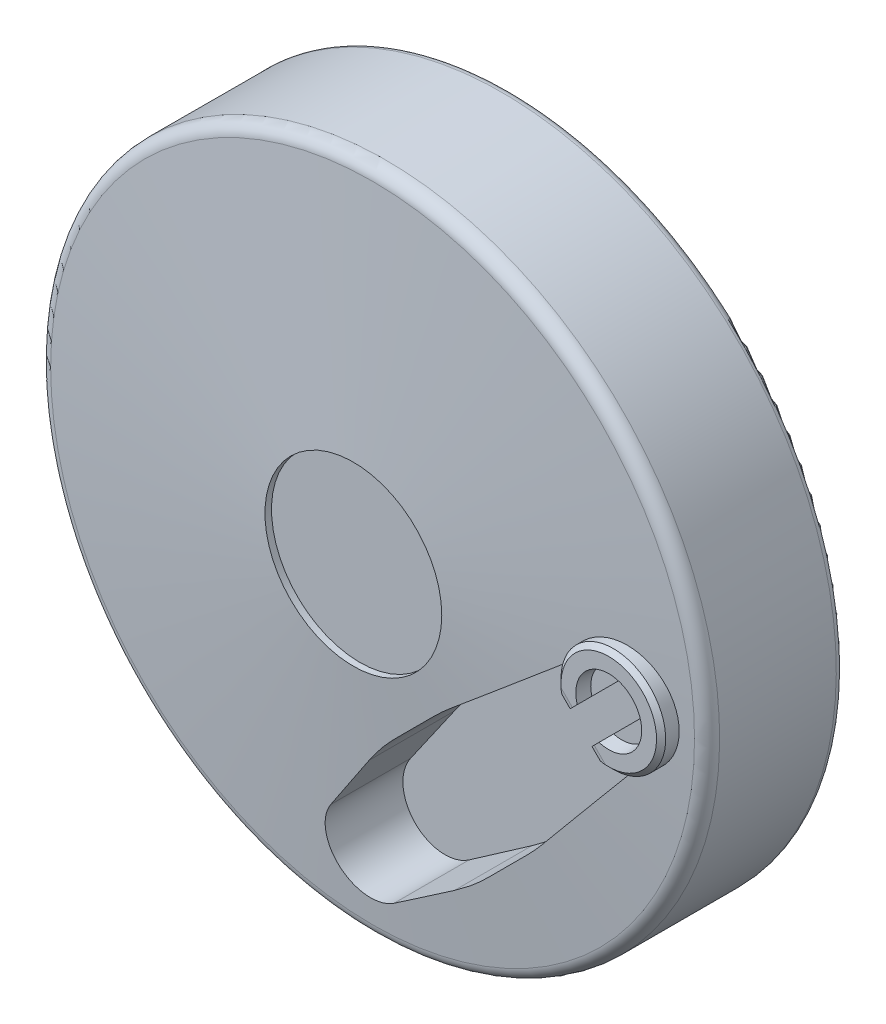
ISO-10303-21;
HEADER;
FILE_DESCRIPTION(('STEP AP214'),'2;1');
FILE_NAME('part.step','',(''),(''),'','','');
FILE_SCHEMA(('AUTOMOTIVE_DESIGN { 1 0 10303 214 1 1 1 1 }'));
ENDSEC;
DATA;
#1=APPLICATION_CONTEXT('core data for automotive mechanical design processes');
#2=APPLICATION_PROTOCOL_DEFINITION('international standard','automotive_design',2000,#1);
#3=PRODUCT_CONTEXT('',#1,'mechanical');
#4=PRODUCT('Part','Part','',(#3));
#5=PRODUCT_RELATED_PRODUCT_CATEGORY('part','',(#4));
#6=PRODUCT_DEFINITION_FORMATION('','',#4);
#7=PRODUCT_DEFINITION_CONTEXT('part definition',#1,'design');
#8=PRODUCT_DEFINITION('design','',#6,#7);
#9=PRODUCT_DEFINITION_SHAPE('','',#8);
#10=(LENGTH_UNIT() NAMED_UNIT(*) SI_UNIT(.MILLI.,.METRE.));
#11=(NAMED_UNIT(*) PLANE_ANGLE_UNIT() SI_UNIT($,.RADIAN.));
#12=(NAMED_UNIT(*) SI_UNIT($,.STERADIAN.) SOLID_ANGLE_UNIT());
#13=UNCERTAINTY_MEASURE_WITH_UNIT(LENGTH_MEASURE(1.E-05),#10,'distance_accuracy_value','');
#14=(GEOMETRIC_REPRESENTATION_CONTEXT(3) GLOBAL_UNCERTAINTY_ASSIGNED_CONTEXT((#13)) GLOBAL_UNIT_ASSIGNED_CONTEXT((#10,
#11,#12)) REPRESENTATION_CONTEXT('',''));
#15=CARTESIAN_POINT('',(0.,0.,0.));
#16=DIRECTION('',(0.,0.,1.));
#17=DIRECTION('',(1.,0.,0.));
#18=AXIS2_PLACEMENT_3D('',#15,#16,#17);
#19=CARTESIAN_POINT('',(39.,0.,20.0000000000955));
#20=DIRECTION('',(0.,0.,-1.));
#21=DIRECTION('',(-0.707106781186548,0.707106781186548,0.));
#22=AXIS2_PLACEMENT_3D('',#19,#20,#21);
#23=CONICAL_SURFACE('',#22,1.9999999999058,0.785398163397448);
#24=CARTESIAN_POINT('',(39.,0.,20.0000000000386));
#25=DIRECTION('',(0.,0.,1.));
#26=DIRECTION('',(-0.707106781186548,0.707106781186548,0.));
#27=AXIS2_PLACEMENT_3D('',#24,#25,#26);
#28=CIRCLE('',#27,1.99999999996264);
#29=CARTESIAN_POINT('',(37.5857864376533,1.41421356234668,20.0000000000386));
#30=VERTEX_POINT('',#29);
#31=EDGE_CURVE('E803',#30,#30,#28,.F.);
#32=ORIENTED_EDGE('',*,*,#31,.T.);
#33=EDGE_LOOP('',(#32));
#34=FACE_BOUND('',#33,.T.);
#35=CARTESIAN_POINT('',(39.,0.,20.3790000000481));
#36=DIRECTION('',(0.,0.,1.));
#37=DIRECTION('',(-0.707106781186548,-0.707106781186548,0.));
#38=AXIS2_PLACEMENT_3D('',#35,#36,#37);
#39=CIRCLE('',#38,1.62099999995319);
#40=CARTESIAN_POINT('',(37.8537799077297,-1.14622009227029,20.3790000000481));
#41=VERTEX_POINT('',#40);
#42=EDGE_CURVE('E757',#41,#41,#39,.T.);
#43=ORIENTED_EDGE('',*,*,#42,.T.);
#44=EDGE_LOOP('',(#43));
#45=FACE_BOUND('',#44,.T.);
#46=ADVANCED_FACE('F15',(#34,#45),#23,.F.);
#47=CARTESIAN_POINT('',(39.,0.,22.));
#48=DIRECTION('',(0.,0.,-1.));
#49=DIRECTION('',(-0.707106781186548,0.707106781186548,0.));
#50=AXIS2_PLACEMENT_3D('',#47,#48,#49);
#51=CYLINDRICAL_SURFACE('',#50,1.621);
#52=CARTESIAN_POINT('',(39.,0.,23.6209999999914));
#53=DIRECTION('',(0.,0.,-1.));
#54=DIRECTION('',(-0.707106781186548,-0.707106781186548,0.));
#55=AXIS2_PLACEMENT_3D('',#52,#53,#54);
#56=CIRCLE('',#55,1.62100000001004);
#57=CARTESIAN_POINT('',(37.8537799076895,-1.14622009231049,23.6209999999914));
#58=VERTEX_POINT('',#57);
#59=EDGE_CURVE('E709',#58,#58,#56,.T.);
#60=ORIENTED_EDGE('',*,*,#59,.F.);
#61=EDGE_LOOP('',(#60));
#62=FACE_BOUND('',#61,.T.);
#63=ORIENTED_EDGE('',*,*,#42,.F.);
#64=EDGE_LOOP('',(#63));
#65=FACE_BOUND('',#64,.T.);
#66=ADVANCED_FACE('F613',(#62,#65),#51,.F.);
#67=CARTESIAN_POINT('',(39.,0.,20.7));
#68=DIRECTION('',(0.,0.,1.));
#69=DIRECTION('',(0.707106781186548,-0.707106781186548,0.));
#70=AXIS2_PLACEMENT_3D('',#67,#68,#69);
#71=CONICAL_SURFACE('',#70,8.,0.78539816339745);
#72=CARTESIAN_POINT('',(46.296517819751,0.225450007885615,20.));
#73=CARTESIAN_POINT('',(46.3518118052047,0.280743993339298,20.0569771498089));
#74=CARTESIAN_POINT('',(46.4069082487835,0.335840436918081,20.1143364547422));
#75=CARTESIAN_POINT('',(46.5167301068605,0.445662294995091,20.2297502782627));
#76=CARTESIAN_POINT('',(46.5714555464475,0.500387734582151,20.2878047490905));
#77=CARTESIAN_POINT('',(46.680566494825,0.609498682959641,20.4045470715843));
#78=CARTESIAN_POINT('',(46.734952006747,0.663884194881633,20.4632349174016));
#79=CARTESIAN_POINT('',(46.8434116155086,0.77234380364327,20.5811942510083));
#80=CARTESIAN_POINT('',(46.8974856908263,0.826417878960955,20.6404657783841));
#81=CARTESIAN_POINT('',(46.9514143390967,0.880346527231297,20.7));
#82=B_SPLINE_CURVE_WITH_KNOTS('',3,(#72,#73,#74,#75,#76,#77,#78,#79,#80,#81),.UNSPECIFIED.,.F.,
.F.,(4,2,2,2,4),(0.,0.290258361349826,0.580496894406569,0.870732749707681,1.16098842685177),.UNSPECIFIED.);
#83=CARTESIAN_POINT('',(46.296517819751,0.225450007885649,20.));
#84=VERTEX_POINT('',#83);
#85=CARTESIAN_POINT('',(46.9514143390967,0.880346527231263,20.7));
#86=VERTEX_POINT('',#85);
#87=EDGE_CURVE('E602',#84,#86,#82,.T.);
#88=ORIENTED_EDGE('',*,*,#87,.F.);
#89=CARTESIAN_POINT('',(39.,0.,20.));
#90=DIRECTION('',(0.,0.,-1.));
#91=DIRECTION('',(0.707106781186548,-0.707106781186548,0.));
#92=AXIS2_PLACEMENT_3D('',#89,#90,#91);
#93=CIRCLE('',#92,7.3);
#94=CARTESIAN_POINT('',(39.2254500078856,7.29651781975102,20.));
#95=VERTEX_POINT('',#94);
#96=EDGE_CURVE('E610',#95,#84,#93,.T.);
#97=ORIENTED_EDGE('',*,*,#96,.F.);
#98=CARTESIAN_POINT('',(39.8803465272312,7.95141433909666,20.7));
#99=CARTESIAN_POINT('',(39.8264178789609,7.89748569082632,20.6404657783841));
#100=CARTESIAN_POINT('',(39.7723438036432,7.84341161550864,20.5811942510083));
#101=CARTESIAN_POINT('',(39.6638841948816,7.73495200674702,20.4632349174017));
#102=CARTESIAN_POINT('',(39.6094986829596,7.68056649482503,20.4045470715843));
#103=CARTESIAN_POINT('',(39.5003877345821,7.57145554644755,20.2878047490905));
#104=CARTESIAN_POINT('',(39.4456622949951,7.51673010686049,20.2297502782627));
#105=CARTESIAN_POINT('',(39.3358404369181,7.40690824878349,20.1143364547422));
#106=CARTESIAN_POINT('',(39.2807439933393,7.35181180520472,20.056977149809));
#107=CARTESIAN_POINT('',(39.2254500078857,7.29651781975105,20.));
#108=B_SPLINE_CURVE_WITH_KNOTS('',3,(#98,#99,#100,#101,#102,#103,#104,#105,#106,#107),
.UNSPECIFIED.,.F.,.F.,(4,2,2,2,4),(0.,0.290255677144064,0.580491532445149,0.870730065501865,
1.16098842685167),.UNSPECIFIED.);
#109=CARTESIAN_POINT('',(39.8803465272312,7.95141433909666,20.7));
#110=VERTEX_POINT('',#109);
#111=EDGE_CURVE('E521',#110,#95,#108,.T.);
#112=ORIENTED_EDGE('',*,*,#111,.F.);
#113=CARTESIAN_POINT('',(39.,0.,20.7));
#114=DIRECTION('',(0.,0.,1.));
#115=DIRECTION('',(-0.707106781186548,0.707106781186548,0.));
#116=AXIS2_PLACEMENT_3D('',#113,#114,#115);
#117=CIRCLE('',#116,8.);
#118=EDGE_CURVE('E1571',#110,#86,#117,.F.);
#119=ORIENTED_EDGE('',*,*,#118,.T.);
#120=EDGE_LOOP('',(#88,#97,#112,#119));
#121=FACE_BOUND('',#120,.T.);
#122=ADVANCED_FACE('F424',(#121),#71,.T.);
#123=CARTESIAN_POINT('',(39.,0.,27.));
#124=DIRECTION('',(0.,0.,-1.));
#125=DIRECTION('',(-0.707106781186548,0.707106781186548,0.));
#126=AXIS2_PLACEMENT_3D('',#123,#124,#125);
#127=CYLINDRICAL_SURFACE('',#126,8.);
#128=CARTESIAN_POINT('',(39.,0.,21.7));
#129=DIRECTION('',(0.,0.,1.));
#130=DIRECTION('',(-0.707106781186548,0.707106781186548,0.));
#131=AXIS2_PLACEMENT_3D('',#128,#129,#130);
#132=CIRCLE('',#131,8.);
#133=CARTESIAN_POINT('',(31.0485856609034,-0.880346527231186,21.7));
#134=VERTEX_POINT('',#133);
#135=CARTESIAN_POINT('',(31.2290449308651,1.90059393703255,21.7));
#136=VERTEX_POINT('',#135);
#137=EDGE_CURVE('E932',#134,#136,#132,.F.);
#138=ORIENTED_EDGE('',*,*,#137,.F.);
#139=DIRECTION('',(0.,0.,1.));
#140=VECTOR('',#139,1.);
#141=CARTESIAN_POINT('',(31.0485856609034,-0.880346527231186,21.7));
#142=LINE('',#141,#140);
#143=CARTESIAN_POINT('',(31.0485856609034,-0.880346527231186,20.7));
#144=VERTEX_POINT('',#143);
#145=EDGE_CURVE('E754',#144,#134,#142,.T.);
#146=ORIENTED_EDGE('',*,*,#145,.F.);
#147=CARTESIAN_POINT('',(39.,0.,20.7));
#148=DIRECTION('',(0.,0.,1.));
#149=DIRECTION('',(-0.707106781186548,0.707106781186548,0.));
#150=AXIS2_PLACEMENT_3D('',#147,#148,#149);
#151=CIRCLE('',#150,8.);
#152=CARTESIAN_POINT('',(31.3116397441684,-2.21113468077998,20.7));
#153=VERTEX_POINT('',#152);
#154=EDGE_CURVE('E905',#153,#144,#151,.F.);
#155=ORIENTED_EDGE('',*,*,#154,.F.);
#156=DIRECTION('',(0.,0.,1.));
#157=VECTOR('',#156,1.);
#158=CARTESIAN_POINT('',(31.3116397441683,-2.21113468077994,32.5));
#159=LINE('',#158,#157);
#160=CARTESIAN_POINT('',(31.3116397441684,-2.21113468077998,32.5));
#161=VERTEX_POINT('',#160);
#162=EDGE_CURVE('E601',#161,#153,#159,.F.);
#163=ORIENTED_EDGE('',*,*,#162,.F.);
#164=CARTESIAN_POINT('',(31.3116397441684,-2.21113468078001,32.5));
#165=CARTESIAN_POINT('',(31.3116427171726,-2.21114242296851,32.5227173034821));
#166=CARTESIAN_POINT('',(31.3113448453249,-2.21010946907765,32.5454212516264));
#167=CARTESIAN_POINT('',(31.3101749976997,-2.20603682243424,32.5906042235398));
#168=CARTESIAN_POINT('',(31.3093037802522,-2.20299978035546,32.6130835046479));
#169=CARTESIAN_POINT('',(31.3059063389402,-2.1911165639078,32.6792728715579));
#170=CARTESIAN_POINT('',(31.3025944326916,-2.17949295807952,32.7224622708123));
#171=CARTESIAN_POINT('',(31.2931287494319,-2.14581287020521,32.8180990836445));
#172=CARTESIAN_POINT('',(31.2864398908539,-2.12175040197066,32.8697675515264));
#173=CARTESIAN_POINT('',(31.2712617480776,-2.06578125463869,32.9689084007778));
#174=CARTESIAN_POINT('',(31.2627552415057,-2.03379903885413,33.0163340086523));
#175=CARTESIAN_POINT('',(31.2450338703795,-1.96512617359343,33.1055959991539));
#176=CARTESIAN_POINT('',(31.2358401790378,-1.92856287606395,33.1475370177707));
#177=CARTESIAN_POINT('',(31.2172452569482,-1.8521046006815,33.2268366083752));
#178=CARTESIAN_POINT('',(31.2078502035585,-1.81227675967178,33.2642609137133));
#179=CARTESIAN_POINT('',(31.1985194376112,-1.77112987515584,33.3));
#180=B_SPLINE_CURVE_WITH_KNOTS('',3,(#164,#165,#166,#167,#168,#169,#170,#171,#172,#173,#174,
#175,#176,#177,#178,#179),.UNSPECIFIED.,.F.,.F.,(4,2,2,2,2,2,2,4),(0.,0.0681022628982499,
0.13611463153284,0.269988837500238,0.441214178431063,0.614140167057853,0.783029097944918,
0.949049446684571),.UNSPECIFIED.);
#181=CARTESIAN_POINT('',(31.1985194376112,-1.77112987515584,33.3));
#182=VERTEX_POINT('',#181);
#183=EDGE_CURVE('E442',#161,#182,#180,.T.);
#184=ORIENTED_EDGE('',*,*,#183,.T.);
#185=CARTESIAN_POINT('',(39.,0.,33.3));
#186=DIRECTION('',(0.,0.,1.));
#187=DIRECTION('',(-0.707106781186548,0.707106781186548,0.));
#188=AXIS2_PLACEMENT_3D('',#185,#186,#187);
#189=CIRCLE('',#188,8.);
#190=CARTESIAN_POINT('',(37.2288701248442,-7.80148056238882,33.3));
#191=VERTEX_POINT('',#190);
#192=EDGE_CURVE('E409',#191,#182,#189,.T.);
#193=ORIENTED_EDGE('',*,*,#192,.F.);
#194=CARTESIAN_POINT('',(37.2288701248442,-7.80148056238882,33.3));
#195=CARTESIAN_POINT('',(37.2037214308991,-7.79577165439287,33.2781899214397));
#196=CARTESIAN_POINT('',(37.1791163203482,-7.7900570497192,33.2557657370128));
#197=CARTESIAN_POINT('',(37.1311438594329,-7.77868792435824,33.2095314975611));
#198=CARTESIAN_POINT('',(37.1077788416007,-7.77303353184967,33.1857189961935));
#199=CARTESIAN_POINT('',(37.0390422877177,-7.75608687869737,33.1111472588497));
#200=CARTESIAN_POINT('',(36.996006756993,-7.74503578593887,33.0580775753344));
#201=CARTESIAN_POINT('',(36.9282187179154,-7.72713744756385,32.9586689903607));
#202=CARTESIAN_POINT('',(36.9015504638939,-7.71991465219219,32.9137163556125));
#203=CARTESIAN_POINT('',(36.8556321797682,-7.70728538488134,32.8203594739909));
#204=CARTESIAN_POINT('',(36.8363113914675,-7.70186165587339,32.7719937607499));
#205=CARTESIAN_POINT('',(36.8110494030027,-7.69471405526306,32.6864246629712));
#206=CARTESIAN_POINT('',(36.8028688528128,-7.69237742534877,32.6499379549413));
#207=CARTESIAN_POINT('',(36.7917114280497,-7.68917895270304,32.5756695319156));
#208=CARTESIAN_POINT('',(36.7887991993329,-7.68833543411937,32.5378774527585));
#209=CARTESIAN_POINT('',(36.7888653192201,-7.68836025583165,32.5));
#210=B_SPLINE_CURVE_WITH_KNOTS('',3,(#194,#195,#196,#197,#198,#199,#200,#201,#202,#203,#204,
#205,#206,#207,#208,#209),.UNSPECIFIED.,.F.,.F.,(4,2,2,2,2,2,2,4),(0.,0.101292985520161,
0.202770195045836,0.409597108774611,0.56739941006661,0.723641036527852,0.83564649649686,
0.949017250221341),.UNSPECIFIED.);
#211=CARTESIAN_POINT('',(36.7888653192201,-7.68836025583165,32.5));
#212=VERTEX_POINT('',#211);
#213=EDGE_CURVE('E459',#191,#212,#210,.T.);
#214=ORIENTED_EDGE('',*,*,#213,.T.);
#215=DIRECTION('',(0.,0.,-1.));
#216=VECTOR('',#215,1.);
#217=CARTESIAN_POINT('',(36.7888653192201,-7.68836025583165,27.));
#218=LINE('',#217,#216);
#219=CARTESIAN_POINT('',(36.7888653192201,-7.68836025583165,20.7));
#220=VERTEX_POINT('',#219);
#221=EDGE_CURVE('E1569',#220,#212,#218,.F.);
#222=ORIENTED_EDGE('',*,*,#221,.F.);
#223=CARTESIAN_POINT('',(39.,0.,20.7));
#224=DIRECTION('',(0.,0.,-1.));
#225=DIRECTION('',(-0.707106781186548,-0.707106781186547,0.));
#226=AXIS2_PLACEMENT_3D('',#223,#224,#225);
#227=CIRCLE('',#226,8.);
#228=CARTESIAN_POINT('',(38.1196534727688,-7.95141433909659,20.7));
#229=VERTEX_POINT('',#228);
#230=EDGE_CURVE('E814',#220,#229,#227,.F.);
#231=ORIENTED_EDGE('',*,*,#230,.T.);
#232=DIRECTION('',(0.,0.,1.));
#233=VECTOR('',#232,1.);
#234=CARTESIAN_POINT('',(38.1196534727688,-7.95141433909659,20.));
#235=LINE('',#234,#233);
#236=CARTESIAN_POINT('',(38.1196534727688,-7.95141433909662,21.7));
#237=VERTEX_POINT('',#236);
#238=EDGE_CURVE('E910',#237,#229,#235,.F.);
#239=ORIENTED_EDGE('',*,*,#238,.F.);
#240=CARTESIAN_POINT('',(39.,0.,21.7));
#241=DIRECTION('',(0.,0.,1.));
#242=DIRECTION('',(-0.707106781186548,0.707106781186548,0.));
#243=AXIS2_PLACEMENT_3D('',#240,#241,#242);
#244=CIRCLE('',#243,8.);
#245=CARTESIAN_POINT('',(40.9005939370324,-7.77095506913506,21.7));
#246=VERTEX_POINT('',#245);
#247=EDGE_CURVE('E1567',#246,#237,#244,.F.);
#248=ORIENTED_EDGE('',*,*,#247,.F.);
#249=DIRECTION('',(0.,0.,-1.));
#250=VECTOR('',#249,1.);
#251=CARTESIAN_POINT('',(40.9005939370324,-7.77095506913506,27.));
#252=LINE('',#251,#250);
#253=CARTESIAN_POINT('',(40.9005939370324,-7.77095506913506,31.6812185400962));
#254=VERTEX_POINT('',#253);
#255=EDGE_CURVE('E697',#254,#246,#252,.T.);
#256=ORIENTED_EDGE('',*,*,#255,.F.);
#257=CARTESIAN_POINT('',(31.7898495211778,-3.46608281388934,32.4769445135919));
#258=CARTESIAN_POINT('',(31.6928486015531,-3.26435756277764,32.4866964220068));
#259=CARTESIAN_POINT('',(31.6043429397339,-3.05851151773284,32.4956463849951));
#260=CARTESIAN_POINT('',(31.4448682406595,-2.64007722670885,32.5118412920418));
#261=CARTESIAN_POINT('',(31.3738986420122,-2.42748919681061,32.5190862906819));
#262=CARTESIAN_POINT('',(31.2500780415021,-1.99720366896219,32.5317664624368));
#263=CARTESIAN_POINT('',(31.1972147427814,-1.77950974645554,32.5372028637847));
#264=CARTESIAN_POINT('',(31.109919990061,-1.34042289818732,32.5461989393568));
#265=CARTESIAN_POINT('',(31.0754882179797,-1.11903003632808,32.549758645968));
#266=CARTESIAN_POINT('',(31.0252958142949,-0.673993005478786,32.5549527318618));
#267=CARTESIAN_POINT('',(31.0095453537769,-0.450347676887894,32.5565860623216));
#268=CARTESIAN_POINT('',(30.9968648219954,-0.00251492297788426,32.5579007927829));
#269=CARTESIAN_POINT('',(30.9999350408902,0.221672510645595,32.5575821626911));
#270=CARTESIAN_POINT('',(31.0248711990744,0.668936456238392,32.5549977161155));
#271=CARTESIAN_POINT('',(31.0467328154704,0.892013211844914,32.5527323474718));
#272=CARTESIAN_POINT('',(31.1090851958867,1.33551840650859,32.5462870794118));
#273=CARTESIAN_POINT('',(31.1495758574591,1.55594686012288,32.5421071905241));
#274=CARTESIAN_POINT('',(31.2488312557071,1.9923343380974,32.5318971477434));
#275=CARTESIAN_POINT('',(31.3075745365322,2.20829829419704,32.5258691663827));
#276=CARTESIAN_POINT('',(31.4429458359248,2.634569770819,32.5120408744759));
#277=CARTESIAN_POINT('',(31.5195800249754,2.84487531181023,32.5042399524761));
#278=CARTESIAN_POINT('',(31.690165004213,3.25826796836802,32.4869700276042));
#279=CARTESIAN_POINT('',(31.7841156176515,3.46135515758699,32.4775010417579));
#280=CARTESIAN_POINT('',(31.988657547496,3.85889187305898,32.4570152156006));
#281=CARTESIAN_POINT('',(32.0992491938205,4.05334122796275,32.445998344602));
#282=CARTESIAN_POINT('',(32.3365809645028,4.43272363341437,32.4225211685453));
#283=CARTESIAN_POINT('',(32.4633616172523,4.61763110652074,32.4100572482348));
#284=CARTESIAN_POINT('',(32.7319427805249,4.9761048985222,32.3838539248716));
#285=CARTESIAN_POINT('',(32.8737436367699,5.14967095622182,32.3701144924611));
#286=CARTESIAN_POINT('',(33.1713144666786,5.48420718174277,32.341516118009));
#287=CARTESIAN_POINT('',(33.3270810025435,5.64518043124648,32.3266574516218));
#288=CARTESIAN_POINT('',(33.6515638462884,5.95351478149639,32.2959680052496));
#289=CARTESIAN_POINT('',(33.8202846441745,6.10087112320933,32.2801368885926));
#290=CARTESIAN_POINT('',(34.1701796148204,6.38148422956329,32.2475947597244));
#291=CARTESIAN_POINT('',(34.3514037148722,6.51467834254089,32.230880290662));
#292=CARTESIAN_POINT('',(34.7244430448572,6.76536265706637,32.1967847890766));
#293=CARTESIAN_POINT('',(34.9162621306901,6.88284708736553,32.1794035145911));
#294=CARTESIAN_POINT('',(35.3090563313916,7.10122696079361,32.1441358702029));
#295=CARTESIAN_POINT('',(35.5100306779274,7.20212379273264,32.1262495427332));
#296=CARTESIAN_POINT('',(35.9197341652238,7.38663934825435,32.0901197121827));
#297=CARTESIAN_POINT('',(36.1284635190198,7.47025759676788,32.0718761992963));
#298=CARTESIAN_POINT('',(36.557680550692,7.6215603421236,32.034701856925));
#299=CARTESIAN_POINT('',(36.7783326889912,7.68877738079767,32.0157654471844));
#300=CARTESIAN_POINT('',(37.2246179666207,7.80391756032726,31.977816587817));
#301=CARTESIAN_POINT('',(37.4502513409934,7.85183978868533,31.958804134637));
#302=CARTESIAN_POINT('',(37.9047723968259,7.92802398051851,31.9208488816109));
#303=CARTESIAN_POINT('',(38.1336594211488,7.95628985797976,31.9019060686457));
#304=CARTESIAN_POINT('',(38.5931160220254,7.99297028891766,31.8642129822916));
#305=CARTESIAN_POINT('',(38.8236861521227,8.00137798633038,31.8454627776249));
#306=CARTESIAN_POINT('',(39.2794787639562,7.99829026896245,31.8087096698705));
#307=CARTESIAN_POINT('',(39.5047038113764,7.98724238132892,31.7906994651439));
#308=CARTESIAN_POINT('',(39.9534539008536,7.94617458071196,31.7550990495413));
#309=CARTESIAN_POINT('',(40.1769789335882,7.91615456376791,31.7375088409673));
#310=CARTESIAN_POINT('',(40.6207167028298,7.83734978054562,31.7028530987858));
#311=CARTESIAN_POINT('',(40.8409297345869,7.78856669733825,31.6857875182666));
#312=CARTESIAN_POINT('',(41.2765020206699,7.67257025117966,31.6522747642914));
#313=CARTESIAN_POINT('',(41.4918611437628,7.60535639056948,31.6358276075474));
#314=CARTESIAN_POINT('',(41.9161678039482,7.45297097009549,31.6036423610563));
#315=CARTESIAN_POINT('',(42.1251157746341,7.36780062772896,31.5879042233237));
#316=CARTESIAN_POINT('',(42.5351931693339,7.1800612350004,31.5572128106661));
#317=CARTESIAN_POINT('',(42.7363198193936,7.07748607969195,31.542259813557));
#318=CARTESIAN_POINT('',(43.1291568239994,6.85572163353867,31.5132263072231));
#319=CARTESIAN_POINT('',(43.3208708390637,6.73653887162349,31.499145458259));
#320=CARTESIAN_POINT('',(43.6936741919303,6.48231046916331,31.4719132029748));
#321=CARTESIAN_POINT('',(43.8747586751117,6.34725766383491,31.4587622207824));
#322=CARTESIAN_POINT('',(44.224597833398,6.06253678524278,31.4334821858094));
#323=CARTESIAN_POINT('',(44.3933734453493,5.91289459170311,31.4213513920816));
#324=CARTESIAN_POINT('',(44.7176529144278,5.59992840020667,31.3981484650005));
#325=CARTESIAN_POINT('',(44.8731627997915,5.43661068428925,31.3870758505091));
#326=CARTESIAN_POINT('',(45.1699342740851,5.09732556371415,31.3660298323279));
#327=CARTESIAN_POINT('',(45.3111902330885,4.92135320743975,31.3560568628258));
#328=CARTESIAN_POINT('',(45.5783155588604,4.55813203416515,31.337263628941));
#329=CARTESIAN_POINT('',(45.7041903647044,4.37088723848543,31.3284429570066));
#330=CARTESIAN_POINT('',(45.9394195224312,3.98685824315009,31.3120091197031));
#331=CARTESIAN_POINT('',(46.048812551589,3.79009785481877,31.3043931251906));
#332=CARTESIAN_POINT('',(46.2506449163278,3.38802976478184,31.2903768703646));
#333=CARTESIAN_POINT('',(46.3430846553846,3.18272226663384,31.2839765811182));
#334=CARTESIAN_POINT('',(46.5103463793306,2.76501566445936,31.2724192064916));
#335=CARTESIAN_POINT('',(46.585168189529,2.55261649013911,31.2672621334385));
#336=CARTESIAN_POINT('',(46.7166504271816,2.12224682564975,31.2582135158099));
#337=CARTESIAN_POINT('',(46.7733111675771,1.90427643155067,31.2543219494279));
#338=CARTESIAN_POINT('',(46.8679769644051,1.46471536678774,31.2478267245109));
#339=CARTESIAN_POINT('',(46.9060155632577,1.24313195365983,31.2452207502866));
#340=CARTESIAN_POINT('',(46.9633053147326,0.797616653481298,31.2412979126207));
#341=CARTESIAN_POINT('',(46.9825630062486,0.573685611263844,31.2399806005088));
#342=CARTESIAN_POINT('',(47.0021766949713,0.124953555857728,31.2386389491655));
#343=CARTESIAN_POINT('',(47.0025293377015,-0.0998476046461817,31.2386148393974));
#344=CARTESIAN_POINT('',(46.9843221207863,-0.5486741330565,31.2398602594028));
#345=CARTESIAN_POINT('',(46.9657626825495,-0.77269951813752,31.2411297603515));
#346=CARTESIAN_POINT('',(46.9098901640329,-1.21819142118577,31.244955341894));
#347=CARTESIAN_POINT('',(46.8725932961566,-1.43965998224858,31.2475103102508));
#348=CARTESIAN_POINT('',(46.7795236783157,-1.87865799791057,31.2538954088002));
#349=CARTESIAN_POINT('',(46.7237512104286,-2.09618751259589,31.2577255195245));
#350=CARTESIAN_POINT('',(46.5941198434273,-2.52580625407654,31.266645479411));
#351=CARTESIAN_POINT('',(46.5202576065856,-2.7378944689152,31.2717355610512));
#352=CARTESIAN_POINT('',(46.3550120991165,-3.1550123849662,31.2831513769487));
#353=CARTESIAN_POINT('',(46.2636348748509,-3.36004449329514,31.2894766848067));
#354=CARTESIAN_POINT('',(46.0639359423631,-3.76180319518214,31.3033412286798));
#355=CARTESIAN_POINT('',(45.9556035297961,-3.95852444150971,31.310881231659));
#356=CARTESIAN_POINT('',(45.7228167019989,-4.34212733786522,31.327139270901));
#357=CARTESIAN_POINT('',(45.5983626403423,-4.5290092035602,31.3358572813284));
#358=CARTESIAN_POINT('',(45.3342225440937,-4.89161924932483,31.3544330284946));
#359=CARTESIAN_POINT('',(45.1945364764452,-5.06734740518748,31.3642907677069));
#360=CARTESIAN_POINT('',(44.9009341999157,-5.40640975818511,31.3851016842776));
#361=CARTESIAN_POINT('',(44.7470181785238,-5.56974411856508,31.3960548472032));
#362=CARTESIAN_POINT('',(44.4257618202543,-5.88315888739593,31.4190277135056));
#363=CARTESIAN_POINT('',(44.2583976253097,-6.03321470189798,31.4310493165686));
#364=CARTESIAN_POINT('',(43.9117451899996,-6.31863516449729,31.4560817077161));
#365=CARTESIAN_POINT('',(43.7324610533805,-6.45400482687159,31.469092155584));
#366=CARTESIAN_POINT('',(43.3631491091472,-6.70919675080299,31.4960473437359));
#367=CARTESIAN_POINT('',(43.1731186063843,-6.82901508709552,31.5099923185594));
#368=CARTESIAN_POINT('',(42.7837117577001,-7.05222587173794,31.5387452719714));
#369=CARTESIAN_POINT('',(42.5843356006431,-7.15561865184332,31.5535532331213));
#370=CARTESIAN_POINT('',(42.1771387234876,-7.34550079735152,31.5839963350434));
#371=CARTESIAN_POINT('',(41.9692980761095,-7.43194711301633,31.5996334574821));
#372=CARTESIAN_POINT('',(41.5471254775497,-7.58700994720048,31.6316192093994));
#373=CARTESIAN_POINT('',(41.3327936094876,-7.6556266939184,31.6479678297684));
#374=CARTESIAN_POINT('',(40.8991488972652,-7.77456003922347,31.6812896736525));
#375=CARTESIAN_POINT('',(40.6798358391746,-7.82487585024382,31.6982629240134));
#376=CARTESIAN_POINT('',(40.237868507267,-7.90684374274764,31.732732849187));
#377=CARTESIAN_POINT('',(40.0152154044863,-7.93850221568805,31.7502293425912));
#378=CARTESIAN_POINT('',(39.5674690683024,-7.98302755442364,31.785697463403));
#379=CARTESIAN_POINT('',(39.3423708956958,-7.99584384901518,31.8036702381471));
#380=CARTESIAN_POINT('',(38.8919205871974,-8.00244066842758,31.8399365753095));
#381=CARTESIAN_POINT('',(38.6665684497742,-7.99622107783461,31.858230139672));
#382=CARTESIAN_POINT('',(38.2171627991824,-7.96479217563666,31.8950253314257));
#383=CARTESIAN_POINT('',(37.9931095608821,-7.93957898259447,31.9135270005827));
#384=CARTESIAN_POINT('',(37.5479391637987,-7.87034064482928,31.950610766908));
#385=CARTESIAN_POINT('',(37.3268219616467,-7.82631577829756,31.969192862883));
#386=CARTESIAN_POINT('',(36.8888192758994,-7.71970071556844,32.006329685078));
#387=CARTESIAN_POINT('',(36.6719392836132,-7.65708793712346,32.0248843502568));
#388=CARTESIAN_POINT('',(36.244226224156,-7.51375999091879,32.0618055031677));
#389=CARTESIAN_POINT('',(36.0333932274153,-7.43304461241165,32.0801719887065));
#390=CARTESIAN_POINT('',(35.6191337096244,-7.25401042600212,32.1165849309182));
#391=CARTESIAN_POINT('',(35.4157124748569,-7.15567933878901,32.1346311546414));
#392=CARTESIAN_POINT('',(35.0178590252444,-6.94216304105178,32.1702394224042));
#393=CARTESIAN_POINT('',(34.823427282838,-6.8269769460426,32.187801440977));
#394=CARTESIAN_POINT('',(34.6342146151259,-6.70372418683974,32.2050449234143));
#395=B_SPLINE_CURVE_WITH_KNOTS('',3,(#257,#258,#259,#260,#261,#262,#263,#264,#265,#266,#267,
#268,#269,#270,#271,#272,#273,#274,#275,#276,#277,#278,#279,#280,#281,#282,#283,#284,#285,#286,
#287,#288,#289,#290,#291,#292,#293,#294,#295,#296,#297,#298,#299,#300,#301,#302,#303,#304,#305,
#306,#307,#308,#309,#310,#311,#312,#313,#314,#315,#316,#317,#318,#319,#320,#321,#322,#323,#324,
#325,#326,#327,#328,#329,#330,#331,#332,#333,#334,#335,#336,#337,#338,#339,#340,#341,#342,#343,
#344,#345,#346,#347,#348,#349,#350,#351,#352,#353,#354,#355,#356,#357,#358,#359,#360,#361,#362,
#363,#364,#365,#366,#367,#368,#369,#370,#371,#372,#373,#374,#375,#376,#377,#378,#379,#380,#381,
#382,#383,#384,#385,#386,#387,#388,#389,#390,#391,#392,#393,#394),.UNSPECIFIED.,.F.,.F.,(4,2,2,
2,2,2,2,2,2,2,2,2,2,2,2,2,2,2,2,2,2,2,2,2,2,2,2,2,2,2,2,2,2,2,2,2,2,2,2,2,2,2,2,2,2,2,2,2,2,2,2,
2,2,2,2,2,2,2,2,2,2,2,2,2,2,2,2,2,4),(0.,0.671941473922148,1.34386143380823,2.01532415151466,
2.68677528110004,3.3585918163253,4.03041870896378,4.70209109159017,5.37375978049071,
6.04464189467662,6.71575573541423,7.38686272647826,8.05798302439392,8.7308176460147,
9.40366775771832,10.0763526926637,10.7492718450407,11.4250538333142,12.1010834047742,
12.7770563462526,13.4530478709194,14.1465036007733,14.8399921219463,15.5333425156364,
16.2269322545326,16.9047754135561,17.5826222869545,18.2604083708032,18.9382127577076,
19.6159712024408,20.2939678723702,20.9716987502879,21.6497367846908,22.3265932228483,
23.0031404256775,23.6799538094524,24.3565271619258,25.0314872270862,25.7064312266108,
26.3813819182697,27.0563209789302,27.7300398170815,28.4035240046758,29.0771276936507,
29.7507163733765,30.4237232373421,31.0967198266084,31.7698406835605,32.4427295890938,
33.116045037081,33.7893457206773,34.4626478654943,35.1359411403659,35.8104564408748,
36.4847407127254,37.1591948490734,37.8336353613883,38.5097675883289,39.1858911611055,
39.8620438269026,40.5379647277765,41.2156964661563,41.8934323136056,42.5713066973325,
43.2491710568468,43.9278623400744,44.6065615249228,45.2857356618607,45.9649454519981),.UNSPECIFIED.);
#396=CARTESIAN_POINT('',(31.2290449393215,1.90059397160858,32.5339343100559));
#397=VERTEX_POINT('',#396);
#398=EDGE_CURVE('E699',#254,#397,#395,.F.);
#399=ORIENTED_EDGE('',*,*,#398,.T.);
#400=DIRECTION('',(0.,0.,-1.));
#401=VECTOR('',#400,1.);
#402=CARTESIAN_POINT('',(31.2290449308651,1.90059393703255,27.));
#403=LINE('',#402,#401);
#404=EDGE_CURVE('E631',#136,#397,#403,.F.);
#405=ORIENTED_EDGE('',*,*,#404,.F.);
#406=EDGE_LOOP('',(#138,#146,#155,#163,#184,#193,#214,#222,#231,#239,#248,#256,#399,#405));
#407=FACE_BOUND('',#406,.T.);
#408=ADVANCED_FACE('F419',(#407),#127,.T.);
#409=CARTESIAN_POINT('',(20.6152236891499,-4.24264068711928,21.7));
#410=DIRECTION('',(0.,0.,1.));
#411=DIRECTION('',(0.707106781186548,-0.707106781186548,0.));
#412=AXIS2_PLACEMENT_3D('',#409,#410,#411);
#413=PLANE('',#412);
#414=DIRECTION('',(-0.707106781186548,-0.707106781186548,0.));
#415=VECTOR('',#414,1.);
#416=CARTESIAN_POINT('',(24.1507575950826,-7.77817459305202,21.7));
#417=LINE('',#416,#415);
#418=CARTESIAN_POINT('',(39.8803465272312,7.95141433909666,21.7));
#419=VERTEX_POINT('',#418);
#420=EDGE_CURVE('E519',#419,#134,#417,.T.);
#421=ORIENTED_EDGE('',*,*,#420,.T.);
#422=ORIENTED_EDGE('',*,*,#137,.T.);
#423=EDGE_CURVE('E136',#136,#419,#132,.F.);
#424=ORIENTED_EDGE('',*,*,#423,.T.);
#425=EDGE_LOOP('',(#421,#422,#424));
#426=FACE_BOUND('',#425,.T.);
#427=ADVANCED_FACE('F423',(#426),#413,.F.);
#428=CARTESIAN_POINT('',(31.2218254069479,-14.8492424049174,21.7));
#429=DIRECTION('',(0.,0.,1.));
#430=DIRECTION('',(0.707106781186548,-0.707106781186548,0.));
#431=AXIS2_PLACEMENT_3D('',#428,#429,#430);
#432=PLANE('',#431);
#433=DIRECTION('',(-0.707106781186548,-0.707106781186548,0.));
#434=VECTOR('',#433,1.);
#435=CARTESIAN_POINT('',(31.2218254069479,-14.8492424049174,21.7));
#436=LINE('',#435,#434);
#437=CARTESIAN_POINT('',(46.9514143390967,0.880346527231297,21.7));
#438=VERTEX_POINT('',#437);
#439=EDGE_CURVE('E609',#237,#438,#436,.F.);
#440=ORIENTED_EDGE('',*,*,#439,.T.);
#441=EDGE_CURVE('E1563',#438,#246,#244,.F.);
#442=ORIENTED_EDGE('',*,*,#441,.T.);
#443=ORIENTED_EDGE('',*,*,#247,.T.);
#444=EDGE_LOOP('',(#440,#442,#443));
#445=FACE_BOUND('',#444,.T.);
#446=ADVANCED_FACE('F615',(#445),#432,.F.);
#447=CARTESIAN_POINT('',(31.2218254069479,-14.8492424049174,20.));
#448=DIRECTION('',(-0.707106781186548,0.707106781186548,0.));
#449=DIRECTION('',(0.707106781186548,0.707106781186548,0.));
#450=AXIS2_PLACEMENT_3D('',#447,#448,#449);
#451=PLANE('',#450);
#452=ORIENTED_EDGE('',*,*,#87,.T.);
#453=DIRECTION('',(0.,0.,1.));
#454=VECTOR('',#453,1.);
#455=CARTESIAN_POINT('',(46.9514143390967,0.880346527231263,20.));
#456=LINE('',#455,#454);
#457=EDGE_CURVE('E580',#86,#438,#456,.T.);
#458=ORIENTED_EDGE('',*,*,#457,.T.);
#459=ORIENTED_EDGE('',*,*,#439,.F.);
#460=ORIENTED_EDGE('',*,*,#238,.T.);
#461=CARTESIAN_POINT('',(38.1196534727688,-7.95141433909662,20.7));
#462=CARTESIAN_POINT('',(38.1735821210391,-7.89748569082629,20.6404657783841));
#463=CARTESIAN_POINT('',(38.2276561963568,-7.84341161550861,20.5811942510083));
#464=CARTESIAN_POINT('',(38.3361158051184,-7.73495200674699,20.4632349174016));
#465=CARTESIAN_POINT('',(38.3905013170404,-7.680566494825,20.4045470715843));
#466=CARTESIAN_POINT('',(38.4996122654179,-7.57145554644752,20.2878047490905));
#467=CARTESIAN_POINT('',(38.5543377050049,-7.51673010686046,20.2297502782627));
#468=CARTESIAN_POINT('',(38.6641595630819,-7.40690824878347,20.1143364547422));
#469=CARTESIAN_POINT('',(38.7192560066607,-7.3518118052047,20.0569771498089));
#470=CARTESIAN_POINT('',(38.7745499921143,-7.29651781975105,20.));
#471=B_SPLINE_CURVE_WITH_KNOTS('',3,(#461,#462,#463,#464,#465,#466,#467,#468,#469,#470),
.UNSPECIFIED.,.F.,.F.,(4,2,2,2,4),(0.,0.290255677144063,0.580491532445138,0.870730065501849,
1.16098842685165),.UNSPECIFIED.);
#472=CARTESIAN_POINT('',(38.7745499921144,-7.29651781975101,20.));
#473=VERTEX_POINT('',#472);
#474=EDGE_CURVE('E815',#229,#473,#471,.T.);
#475=ORIENTED_EDGE('',*,*,#474,.T.);
#476=DIRECTION('',(-0.707106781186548,-0.707106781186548,0.));
#477=VECTOR('',#476,1.);
#478=CARTESIAN_POINT('',(39.9545941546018,-6.11647365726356,20.));
#479=LINE('',#478,#477);
#480=EDGE_CURVE('E806',#473,#84,#479,.F.);
#481=ORIENTED_EDGE('',*,*,#480,.T.);
#482=EDGE_LOOP('',(#452,#458,#459,#460,#475,#481));
#483=FACE_BOUND('',#482,.T.);
#484=ADVANCED_FACE('F589',(#483),#451,.F.);
#485=CARTESIAN_POINT('',(39.,0.,20.7));
#486=DIRECTION('',(0.,0.,1.));
#487=DIRECTION('',(0.707106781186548,-0.707106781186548,0.));
#488=AXIS2_PLACEMENT_3D('',#485,#486,#487);
#489=CONICAL_SURFACE('',#488,8.,0.78539816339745);
#490=ORIENTED_EDGE('',*,*,#474,.F.);
#491=ORIENTED_EDGE('',*,*,#230,.F.);
#492=CARTESIAN_POINT('',(35.5148343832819,-6.41432931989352,20.));
#493=CARTESIAN_POINT('',(35.6246881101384,-6.52418304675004,20.0440794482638));
#494=CARTESIAN_POINT('',(35.7336630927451,-6.63315802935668,20.0923666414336));
#495=CARTESIAN_POINT('',(35.9496178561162,-6.84911279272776,20.1963057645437));
#496=CARTESIAN_POINT('',(36.0566010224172,-6.95609595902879,20.2519435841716));
#497=CARTESIAN_POINT('',(36.268720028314,-7.16821496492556,20.369690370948));
#498=CARTESIAN_POINT('',(36.3738563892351,-7.27335132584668,20.4317974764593));
#499=CARTESIAN_POINT('',(36.5825698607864,-7.48206479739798,20.5617890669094));
#500=CARTESIAN_POINT('',(36.6861436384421,-7.58563857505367,20.629684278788));
#501=CARTESIAN_POINT('',(36.7888653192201,-7.68836025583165,20.7));
#502=B_SPLINE_CURVE_WITH_KNOTS('',3,(#492,#493,#494,#495,#496,#497,#498,#499,#500,#501),
.UNSPECIFIED.,.F.,.F.,(4,2,2,2,4),(0.,0.484340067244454,0.967763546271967,1.45104829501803,
1.93524902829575),.UNSPECIFIED.);
#503=CARTESIAN_POINT('',(35.5148343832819,-6.41432931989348,20.));
#504=VERTEX_POINT('',#503);
#505=EDGE_CURVE('E496',#504,#220,#502,.T.);
#506=ORIENTED_EDGE('',*,*,#505,.F.);
#507=CARTESIAN_POINT('',(39.,0.,20.));
#508=DIRECTION('',(0.,0.,-1.));
#509=DIRECTION('',(0.707106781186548,-0.707106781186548,0.));
#510=AXIS2_PLACEMENT_3D('',#507,#508,#509);
#511=CIRCLE('',#510,7.3);
#512=EDGE_CURVE('E822',#473,#504,#511,.T.);
#513=ORIENTED_EDGE('',*,*,#512,.F.);
#514=EDGE_LOOP('',(#490,#491,#506,#513));
#515=FACE_BOUND('',#514,.T.);
#516=ADVANCED_FACE('F586',(#515),#489,.T.);
#517=CARTESIAN_POINT('',(45.3639610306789,-16.2634559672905,32.5));
#518=DIRECTION('',(0.707106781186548,0.707106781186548,0.));
#519=DIRECTION('',(0.707106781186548,-0.707106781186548,0.));
#520=AXIS2_PLACEMENT_3D('',#517,#518,#519);
#521=PLANE('',#520);
#522=DIRECTION('',(0.707106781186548,-0.707106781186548,0.));
#523=VECTOR('',#522,1.);
#524=CARTESIAN_POINT('',(45.3639610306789,-16.2634559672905,24.));
#525=LINE('',#524,#523);
#526=CARTESIAN_POINT('',(35.7119534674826,-6.61144840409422,24.));
#527=VERTEX_POINT('',#526);
#528=CARTESIAN_POINT('',(32.3885515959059,-3.28804653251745,24.));
#529=VERTEX_POINT('',#528);
#530=EDGE_CURVE('E886',#527,#529,#525,.F.);
#531=ORIENTED_EDGE('',*,*,#530,.T.);
#532=DIRECTION('',(0.,0.,1.));
#533=VECTOR('',#532,1.);
#534=CARTESIAN_POINT('',(32.3885515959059,-3.28804653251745,32.5));
#535=LINE('',#534,#533);
#536=CARTESIAN_POINT('',(32.3885515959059,-3.28804653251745,32.5));
#537=VERTEX_POINT('',#536);
#538=EDGE_CURVE('E495',#529,#537,#535,.T.);
#539=ORIENTED_EDGE('',*,*,#538,.T.);
#540=DIRECTION('',(0.707106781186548,-0.707106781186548,0.));
#541=VECTOR('',#540,1.);
#542=CARTESIAN_POINT('',(45.3639610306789,-16.2634559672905,32.5));
#543=LINE('',#542,#541);
#544=EDGE_CURVE('E717',#537,#161,#543,.F.);
#545=ORIENTED_EDGE('',*,*,#544,.T.);
#546=ORIENTED_EDGE('',*,*,#162,.T.);
#547=CARTESIAN_POINT('',(31.3116397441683,-2.21113468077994,20.7));
#548=CARTESIAN_POINT('',(31.4143614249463,-2.31385636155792,20.629684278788));
#549=CARTESIAN_POINT('',(31.517935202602,-2.41743013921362,20.5617890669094));
#550=CARTESIAN_POINT('',(31.7266486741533,-2.62614361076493,20.4317974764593));
#551=CARTESIAN_POINT('',(31.8317850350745,-2.73127997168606,20.369690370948));
#552=CARTESIAN_POINT('',(32.0439040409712,-2.94339897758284,20.2519435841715));
#553=CARTESIAN_POINT('',(32.1508872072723,-3.05038214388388,20.1963057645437));
#554=CARTESIAN_POINT('',(32.3668419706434,-3.26633690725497,20.0923666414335));
#555=CARTESIAN_POINT('',(32.47581695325,-3.37531188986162,20.0440794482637));
#556=CARTESIAN_POINT('',(32.5856706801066,-3.48516561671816,20.));
#557=B_SPLINE_CURVE_WITH_KNOTS('',3,(#547,#548,#549,#550,#551,#552,#553,#554,#555,#556),
.UNSPECIFIED.,.F.,.F.,(4,2,2,2,4),(0.,0.484200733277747,0.967485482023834,1.45090896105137,
1.93524902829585),.UNSPECIFIED.);
#558=CARTESIAN_POINT('',(32.5856706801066,-3.48516561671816,20.));
#559=VERTEX_POINT('',#558);
#560=EDGE_CURVE('E593',#153,#559,#557,.T.);
#561=ORIENTED_EDGE('',*,*,#560,.T.);
#562=DIRECTION('',(0.707106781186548,-0.707106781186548,0.));
#563=VECTOR('',#562,1.);
#564=CARTESIAN_POINT('',(45.3639610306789,-16.2634559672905,20.));
#565=LINE('',#564,#563);
#566=EDGE_CURVE('E600',#559,#504,#565,.T.);
#567=ORIENTED_EDGE('',*,*,#566,.T.);
#568=ORIENTED_EDGE('',*,*,#505,.T.);
#569=ORIENTED_EDGE('',*,*,#221,.T.);
#570=DIRECTION('',(0.707106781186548,-0.707106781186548,0.));
#571=VECTOR('',#570,1.);
#572=CARTESIAN_POINT('',(45.3639610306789,-16.2634559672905,32.5));
#573=LINE('',#572,#571);
#574=CARTESIAN_POINT('',(35.7119534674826,-6.61144840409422,32.5));
#575=VERTEX_POINT('',#574);
#576=EDGE_CURVE('E898',#212,#575,#573,.F.);
#577=ORIENTED_EDGE('',*,*,#576,.T.);
#578=DIRECTION('',(0.,0.,1.));
#579=VECTOR('',#578,1.);
#580=CARTESIAN_POINT('',(35.7119534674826,-6.61144840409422,32.5));
#581=LINE('',#580,#579);
#582=EDGE_CURVE('E889',#575,#527,#581,.F.);
#583=ORIENTED_EDGE('',*,*,#582,.T.);
#584=EDGE_LOOP('',(#531,#539,#545,#546,#561,#567,#568,#569,#577,#583));
#585=FACE_BOUND('',#584,.T.);
#586=ADVANCED_FACE('F477',(#585),#521,.F.);
#587=CARTESIAN_POINT('',(46.4246212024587,-15.2027957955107,32.5));
#588=DIRECTION('',(0.707106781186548,-0.707106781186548,0.));
#589=DIRECTION('',(-0.707106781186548,-0.707106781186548,0.));
#590=AXIS2_PLACEMENT_3D('',#587,#588,#589);
#591=CYLINDRICAL_SURFACE('',#590,1.5);
#592=ORIENTED_EDGE('',*,*,#213,.F.);
#593=CARTESIAN_POINT('',(37.2288701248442,-7.80148056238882,33.3));
#594=CARTESIAN_POINT('',(37.2238322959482,-7.77054921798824,33.3290432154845));
#595=CARTESIAN_POINT('',(37.2212164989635,-7.73947215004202,33.3587477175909));
#596=CARTESIAN_POINT('',(37.2223140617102,-7.67778852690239,33.419103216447));
#597=CARTESIAN_POINT('',(37.2260929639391,-7.64719012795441,33.449760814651));
#598=CARTESIAN_POINT('',(37.239984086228,-7.59419229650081,33.5045258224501));
#599=CARTESIAN_POINT('',(37.2485838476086,-7.57142987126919,33.5286440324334));
#600=CARTESIAN_POINT('',(37.2711456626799,-7.52798820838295,33.5760434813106));
#601=CARTESIAN_POINT('',(37.2850819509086,-7.50729955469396,33.5993281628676));
#602=CARTESIAN_POINT('',(37.3182324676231,-7.46854551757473,33.6444545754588));
#603=CARTESIAN_POINT('',(37.3374644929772,-7.45048929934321,33.6662911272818));
#604=CARTESIAN_POINT('',(37.3804320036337,-7.41745322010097,33.7078125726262));
#605=CARTESIAN_POINT('',(37.4041767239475,-7.40247980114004,33.7274929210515));
#606=CARTESIAN_POINT('',(37.4627718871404,-7.37154051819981,33.7699362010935));
#607=CARTESIAN_POINT('',(37.4988084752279,-7.35664594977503,33.7918292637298));
#608=CARTESIAN_POINT('',(37.5745087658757,-7.33130494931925,33.8314763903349));
#609=CARTESIAN_POINT('',(37.6141799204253,-7.32086791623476,33.8492216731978));
#610=CARTESIAN_POINT('',(37.724271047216,-7.29737476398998,33.8922398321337));
#611=CARTESIAN_POINT('',(37.796717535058,-7.28762782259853,33.9140458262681));
#612=CARTESIAN_POINT('',(37.9442266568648,-7.27463891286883,33.9495046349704));
#613=CARTESIAN_POINT('',(38.019299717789,-7.27142682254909,33.9631198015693));
#614=CARTESIAN_POINT('',(38.1632307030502,-7.26952589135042,33.9827869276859));
#615=CARTESIAN_POINT('',(38.2320081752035,-7.27043958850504,33.9894303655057));
#616=CARTESIAN_POINT('',(38.3689165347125,-7.27501229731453,33.997986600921));
#617=CARTESIAN_POINT('',(38.4370447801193,-7.27863690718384,33.999957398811));
#618=CARTESIAN_POINT('',(38.5050252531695,-7.28319984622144,34.));
#619=B_SPLINE_CURVE_WITH_KNOTS('',3,(#593,#594,#595,#596,#597,#598,#599,#600,#601,#602,#603,
#604,#605,#606,#607,#608,#609,#610,#611,#612,#613,#614,#615,#616,#617,#618),.UNSPECIFIED.,.F.,
.F.,(4,2,2,2,2,2,2,2,2,2,2,2,4),(0.,0.128540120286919,0.258405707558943,0.360740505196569,
0.462587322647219,0.564780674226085,0.667185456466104,0.800584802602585,0.934264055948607,
1.16183461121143,1.39044332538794,1.59752440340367,1.80202126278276),.UNSPECIFIED.);
#620=CARTESIAN_POINT('',(38.5050252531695,-7.28319984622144,34.));
#621=VERTEX_POINT('',#620);
#622=EDGE_CURVE('E486',#191,#621,#619,.T.);
#623=ORIENTED_EDGE('',*,*,#622,.T.);
#624=DIRECTION('',(0.707106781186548,-0.707106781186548,0.));
#625=VECTOR('',#624,1.);
#626=CARTESIAN_POINT('',(35.110912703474,-3.88908729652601,34.));
#627=LINE('',#626,#625);
#628=CARTESIAN_POINT('',(36.7726136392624,-5.5507882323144,34.));
#629=VERTEX_POINT('',#628);
#630=EDGE_CURVE('E1465',#621,#629,#627,.F.);
#631=ORIENTED_EDGE('',*,*,#630,.T.);
#632=CARTESIAN_POINT('',(36.7726136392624,-5.5507882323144,32.5));
#633=DIRECTION('',(-0.707106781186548,0.707106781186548,0.));
#634=DIRECTION('',(-0.707106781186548,-0.707106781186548,0.));
#635=AXIS2_PLACEMENT_3D('',#632,#633,#634);
#636=CIRCLE('',#635,1.5);
#637=EDGE_CURVE('E468',#575,#629,#636,.T.);
#638=ORIENTED_EDGE('',*,*,#637,.F.);
#639=ORIENTED_EDGE('',*,*,#576,.F.);
#640=EDGE_LOOP('',(#592,#623,#631,#638,#639));
#641=FACE_BOUND('',#640,.T.);
#642=ADVANCED_FACE('F471',(#641),#591,.T.);
#643=CARTESIAN_POINT('',(39.,0.,33.3));
#644=DIRECTION('',(0.,0.,-1.));
#645=DIRECTION('',(-0.707106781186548,0.707106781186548,0.));
#646=AXIS2_PLACEMENT_3D('',#643,#644,#645);
#647=CONICAL_SURFACE('',#646,8.,0.785398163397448);
#648=ORIENTED_EDGE('',*,*,#622,.F.);
#649=ORIENTED_EDGE('',*,*,#192,.T.);
#650=CARTESIAN_POINT('',(31.7168001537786,-0.494974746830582,34.));
#651=CARTESIAN_POINT('',(31.7209944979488,-0.557277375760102,33.9999699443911));
#652=CARTESIAN_POINT('',(31.7243843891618,-0.619691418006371,33.998309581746));
#653=CARTESIAN_POINT('',(31.7289649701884,-0.744866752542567,33.9911783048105));
#654=CARTESIAN_POINT('',(31.7301381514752,-0.807626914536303,33.9856775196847));
#655=CARTESIAN_POINT('',(31.7296027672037,-0.934253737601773,33.9700990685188));
#656=CARTESIAN_POINT('',(31.7278184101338,-0.998106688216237,33.9599060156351));
#657=CARTESIAN_POINT('',(31.7200771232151,-1.12429439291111,33.9340295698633));
#658=CARTESIAN_POINT('',(31.714135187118,-1.18663377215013,33.9183660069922));
#659=CARTESIAN_POINT('',(31.6994390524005,-1.28683460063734,33.8869915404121));
#660=CARTESIAN_POINT('',(31.6924218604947,-1.32555793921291,33.8732552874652));
#661=CARTESIAN_POINT('',(31.6752211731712,-1.40089401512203,33.8425446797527));
#662=CARTESIAN_POINT('',(31.6650460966,-1.43751206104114,33.8255789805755));
#663=CARTESIAN_POINT('',(31.6405761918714,-1.50802176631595,33.7877300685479));
#664=CARTESIAN_POINT('',(31.6262234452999,-1.54186587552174,33.7667933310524));
#665=CARTESIAN_POINT('',(31.5928293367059,-1.60427018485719,33.7211395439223));
#666=CARTESIAN_POINT('',(31.5737999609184,-1.63284357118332,33.6964322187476));
#667=CARTESIAN_POINT('',(31.5329902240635,-1.68055694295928,33.6462311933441));
#668=CARTESIAN_POINT('',(31.5116044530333,-1.70030947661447,33.6210023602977));
#669=CARTESIAN_POINT('',(31.4657132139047,-1.73300372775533,33.5689806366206));
#670=CARTESIAN_POINT('',(31.4412038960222,-1.74593693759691,33.5421858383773));
#671=CARTESIAN_POINT('',(31.3878171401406,-1.76608397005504,33.4856308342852));
#672=CARTESIAN_POINT('',(31.3587456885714,-1.7726450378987,33.4558288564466));
#673=CARTESIAN_POINT('',(31.2995117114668,-1.77910842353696,33.3966628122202));
#674=CARTESIAN_POINT('',(31.2693482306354,-1.77900476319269,33.3672991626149));
#675=CARTESIAN_POINT('',(31.2255531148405,-1.77505985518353,33.3254877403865));
#676=CARTESIAN_POINT('',(31.2120325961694,-1.77332380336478,33.3126919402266));
#677=CARTESIAN_POINT('',(31.1985194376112,-1.77112987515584,33.3));
#678=B_SPLINE_CURVE_WITH_KNOTS('',3,(#650,#651,#652,#653,#654,#655,#656,#657,#658,#659,#660,
#661,#662,#663,#664,#665,#666,#667,#668,#669,#670,#671,#672,#673,#674,#675,#676,#677),
.UNSPECIFIED.,.F.,.F.,(4,2,2,2,2,2,2,2,2,2,2,2,2,4),(0.,0.187392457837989,0.376258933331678,
0.570040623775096,0.763127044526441,0.887947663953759,1.01243833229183,1.13874457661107,
1.26473041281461,1.37952362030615,1.49445970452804,1.62021182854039,1.74607675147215,
1.80212241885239),.UNSPECIFIED.);
#679=CARTESIAN_POINT('',(31.7168001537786,-0.494974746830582,34.));
#680=VERTEX_POINT('',#679);
#681=EDGE_CURVE('E512',#680,#182,#678,.T.);
#682=ORIENTED_EDGE('',*,*,#681,.F.);
#683=CARTESIAN_POINT('',(39.,0.,34.));
#684=DIRECTION('',(0.,0.,1.));
#685=DIRECTION('',(-0.707106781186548,0.707106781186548,0.));
#686=AXIS2_PLACEMENT_3D('',#683,#684,#685);
#687=CIRCLE('',#686,7.3);
#688=EDGE_CURVE('E494',#621,#680,#687,.T.);
#689=ORIENTED_EDGE('',*,*,#688,.F.);
#690=EDGE_LOOP('',(#648,#649,#682,#689));
#691=FACE_BOUND('',#690,.T.);
#692=ADVANCED_FACE('F476',(#691),#647,.T.);
#693=CARTESIAN_POINT('',(46.4246212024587,-15.2027957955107,32.5));
#694=DIRECTION('',(0.707106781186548,-0.707106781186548,0.));
#695=DIRECTION('',(-0.707106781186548,-0.707106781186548,0.));
#696=AXIS2_PLACEMENT_3D('',#693,#694,#695);
#697=CYLINDRICAL_SURFACE('',#696,1.5);
#698=ORIENTED_EDGE('',*,*,#681,.T.);
#699=ORIENTED_EDGE('',*,*,#183,.F.);
#700=ORIENTED_EDGE('',*,*,#544,.F.);
#701=CARTESIAN_POINT('',(33.4492117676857,-2.22738636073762,32.5));
#702=DIRECTION('',(-0.707106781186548,0.707106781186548,0.));
#703=DIRECTION('',(-0.707106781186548,-0.707106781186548,0.));
#704=AXIS2_PLACEMENT_3D('',#701,#702,#703);
#705=CIRCLE('',#704,1.5);
#706=CARTESIAN_POINT('',(33.4492117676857,-2.22738636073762,34.));
#707=VERTEX_POINT('',#706);
#708=EDGE_CURVE('E868',#707,#537,#705,.F.);
#709=ORIENTED_EDGE('',*,*,#708,.F.);
#710=DIRECTION('',(0.707106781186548,-0.707106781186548,0.));
#711=VECTOR('',#710,1.);
#712=CARTESIAN_POINT('',(35.110912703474,-3.88908729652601,34.));
#713=LINE('',#712,#711);
#714=EDGE_CURVE('E1471',#707,#680,#713,.F.);
#715=ORIENTED_EDGE('',*,*,#714,.T.);
#716=EDGE_LOOP('',(#698,#699,#700,#709,#715));
#717=FACE_BOUND('',#716,.T.);
#718=ADVANCED_FACE('F506',(#717),#697,.T.);
#719=CARTESIAN_POINT('',(39.,0.,20.7));
#720=DIRECTION('',(0.,0.,1.));
#721=DIRECTION('',(0.707106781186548,-0.707106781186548,0.));
#722=AXIS2_PLACEMENT_3D('',#719,#720,#721);
#723=CONICAL_SURFACE('',#722,8.,0.785398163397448);
#724=CARTESIAN_POINT('',(31.703482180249,-0.225450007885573,20.));
#725=CARTESIAN_POINT('',(31.6481881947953,-0.280743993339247,20.0569771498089));
#726=CARTESIAN_POINT('',(31.5930917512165,-0.335840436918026,20.1143364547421));
#727=CARTESIAN_POINT('',(31.4832698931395,-0.44566229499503,20.2297502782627));
#728=CARTESIAN_POINT('',(31.4285444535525,-0.500387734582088,20.2878047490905));
#729=CARTESIAN_POINT('',(31.319433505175,-0.609498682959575,20.4045470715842));
#730=CARTESIAN_POINT('',(31.265047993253,-0.663884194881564,20.4632349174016));
#731=CARTESIAN_POINT('',(31.1565883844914,-0.772343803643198,20.5811942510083));
#732=CARTESIAN_POINT('',(31.1025143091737,-0.826417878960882,20.6404657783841));
#733=CARTESIAN_POINT('',(31.0485856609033,-0.880346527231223,20.7));
#734=B_SPLINE_CURVE_WITH_KNOTS('',3,(#724,#725,#726,#727,#728,#729,#730,#731,#732,#733),
.UNSPECIFIED.,.F.,.F.,(4,2,2,2,4),(0.,0.290258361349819,0.58049689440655,0.870732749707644,
1.16098842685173),.UNSPECIFIED.);
#735=CARTESIAN_POINT('',(31.703482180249,-0.225450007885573,20.));
#736=VERTEX_POINT('',#735);
#737=EDGE_CURVE('E571',#736,#144,#734,.T.);
#738=ORIENTED_EDGE('',*,*,#737,.F.);
#739=CARTESIAN_POINT('',(39.,0.,20.));
#740=DIRECTION('',(0.,0.,-1.));
#741=DIRECTION('',(0.707106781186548,-0.707106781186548,0.));
#742=AXIS2_PLACEMENT_3D('',#739,#740,#741);
#743=CIRCLE('',#742,7.3);
#744=EDGE_CURVE('E811',#736,#559,#743,.F.);
#745=ORIENTED_EDGE('',*,*,#744,.T.);
#746=ORIENTED_EDGE('',*,*,#560,.F.);
#747=ORIENTED_EDGE('',*,*,#154,.T.);
#748=EDGE_LOOP('',(#738,#745,#746,#747));
#749=FACE_BOUND('',#748,.T.);
#750=ADVANCED_FACE('F534',(#749),#723,.T.);
#751=CARTESIAN_POINT('',(24.1507575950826,-7.77817459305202,21.7));
#752=DIRECTION('',(0.707106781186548,-0.707106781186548,0.));
#753=DIRECTION('',(-0.707106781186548,-0.707106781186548,0.));
#754=AXIS2_PLACEMENT_3D('',#751,#752,#753);
#755=PLANE('',#754);
#756=ORIENTED_EDGE('',*,*,#420,.F.);
#757=DIRECTION('',(0.,0.,1.));
#758=VECTOR('',#757,1.);
#759=CARTESIAN_POINT('',(39.8803465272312,7.95141433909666,21.7));
#760=LINE('',#759,#758);
#761=EDGE_CURVE('E710',#419,#110,#760,.F.);
#762=ORIENTED_EDGE('',*,*,#761,.T.);
#763=ORIENTED_EDGE('',*,*,#111,.T.);
#764=DIRECTION('',(-0.707106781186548,-0.707106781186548,0.));
#765=VECTOR('',#764,1.);
#766=CARTESIAN_POINT('',(32.8835263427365,0.954594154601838,20.));
#767=LINE('',#766,#765);
#768=EDGE_CURVE('E808',#95,#736,#767,.T.);
#769=ORIENTED_EDGE('',*,*,#768,.T.);
#770=ORIENTED_EDGE('',*,*,#737,.T.);
#771=ORIENTED_EDGE('',*,*,#145,.T.);
#772=EDGE_LOOP('',(#756,#762,#763,#769,#770,#771));
#773=FACE_BOUND('',#772,.T.);
#774=ADVANCED_FACE('F563',(#773),#755,.F.);
#775=CARTESIAN_POINT('',(39.,0.,24.));
#776=DIRECTION('',(0.,0.,1.));
#777=DIRECTION('',(0.707106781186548,-0.707106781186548,0.));
#778=AXIS2_PLACEMENT_3D('',#775,#776,#777);
#779=PLANE('',#778);
#780=CARTESIAN_POINT('',(42.0759144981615,1.1667261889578,24.));
#781=DIRECTION('',(0.,0.,1.));
#782=DIRECTION('',(-0.707106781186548,0.707106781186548,0.));
#783=AXIS2_PLACEMENT_3D('',#780,#781,#782);
#784=CIRCLE('',#783,1.);
#785=CARTESIAN_POINT('',(42.7830212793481,1.87383297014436,24.));
#786=VERTEX_POINT('',#785);
#787=CARTESIAN_POINT('',(42.7830212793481,0.459619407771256,24.));
#788=VERTEX_POINT('',#787);
#789=EDGE_CURVE('E706',#786,#788,#784,.F.);
#790=ORIENTED_EDGE('',*,*,#789,.F.);
#791=DIRECTION('',(0.707106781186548,-0.707106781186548,0.));
#792=VECTOR('',#791,1.);
#793=CARTESIAN_POINT('',(41.8284271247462,2.8284271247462,24.));
#794=LINE('',#793,#792);
#795=CARTESIAN_POINT('',(40.8738329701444,3.78302127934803,24.));
#796=VERTEX_POINT('',#795);
#797=EDGE_CURVE('E852',#796,#786,#794,.T.);
#798=ORIENTED_EDGE('',*,*,#797,.F.);
#799=CARTESIAN_POINT('',(40.1667261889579,3.07591449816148,24.));
#800=DIRECTION('',(0.,0.,1.));
#801=DIRECTION('',(-0.707106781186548,0.707106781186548,0.));
#802=AXIS2_PLACEMENT_3D('',#799,#800,#801);
#803=CIRCLE('',#802,1.);
#804=CARTESIAN_POINT('',(39.4596194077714,3.78302127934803,24.));
#805=VERTEX_POINT('',#804);
#806=EDGE_CURVE('E850',#805,#796,#803,.F.);
#807=ORIENTED_EDGE('',*,*,#806,.F.);
#808=DIRECTION('',(0.707106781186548,0.707106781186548,0.));
#809=VECTOR('',#808,1.);
#810=CARTESIAN_POINT('',(39.4596194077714,3.78302127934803,24.));
#811=LINE('',#810,#809);
#812=EDGE_CURVE('E737',#529,#805,#811,.T.);
#813=ORIENTED_EDGE('',*,*,#812,.F.);
#814=ORIENTED_EDGE('',*,*,#530,.F.);
#815=DIRECTION('',(-0.707106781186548,-0.707106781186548,0.));
#816=VECTOR('',#815,1.);
#817=CARTESIAN_POINT('',(40.6617009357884,-1.66170093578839,24.));
#818=LINE('',#817,#816);
#819=EDGE_CURVE('E856',#788,#527,#818,.T.);
#820=ORIENTED_EDGE('',*,*,#819,.F.);
#821=EDGE_LOOP('',(#790,#798,#807,#813,#814,#820));
#822=FACE_BOUND('',#821,.T.);
#823=CARTESIAN_POINT('',(39.,0.,24.0000000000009));
#824=DIRECTION('',(0.,0.,-1.));
#825=DIRECTION('',(0.707106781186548,-0.707106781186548,0.));
#826=AXIS2_PLACEMENT_3D('',#823,#824,#825);
#827=CIRCLE('',#826,1.99999999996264);
#828=CARTESIAN_POINT('',(40.4142135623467,-1.41421356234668,24.0000000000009));
#829=VERTEX_POINT('',#828);
#830=EDGE_CURVE('E751',#829,#829,#827,.F.);
#831=ORIENTED_EDGE('',*,*,#830,.F.);
#832=EDGE_LOOP('',(#831));
#833=FACE_BOUND('',#832,.T.);
#834=ADVANCED_FACE('F567',(#822,#833),#779,.T.);
#835=CARTESIAN_POINT('',(32.1764195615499,-10.146982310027,24.));
#836=DIRECTION('',(0.707106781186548,-0.707106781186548,0.));
#837=DIRECTION('',(-0.707106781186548,-0.707106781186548,0.));
#838=AXIS2_PLACEMENT_3D('',#835,#836,#837);
#839=PLANE('',#838);
#840=CARTESIAN_POINT('',(37.516126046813,-4.80727582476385,33.9999999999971));
#841=CARTESIAN_POINT('',(37.5535863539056,-4.76981551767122,33.6665945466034));
#842=CARTESIAN_POINT('',(37.5912057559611,-4.73219611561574,33.3332251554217));
#843=CARTESIAN_POINT('',(37.6667627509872,-4.65663912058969,32.6665584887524));
#844=CARTESIAN_POINT('',(37.7047003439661,-4.61870152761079,32.3332612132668));
#845=CARTESIAN_POINT('',(37.7427970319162,-4.5806048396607,31.999999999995));
#846=B_SPLINE_CURVE_WITH_KNOTS('',3,(#840,#841,#842,#843,#844,#845),.UNSPECIFIED.,.F.,.F.,(4,2,
4),(0.,1.01276369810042,2.02552742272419),.UNSPECIFIED.);
#847=CARTESIAN_POINT('',(37.5161260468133,-4.80727582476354,33.9999999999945));
#848=VERTEX_POINT('',#847);
#849=CARTESIAN_POINT('',(37.7427970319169,-4.58060483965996,31.9999999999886));
#850=VERTEX_POINT('',#849);
#851=EDGE_CURVE('E743',#848,#850,#846,.T.);
#852=ORIENTED_EDGE('',*,*,#851,.T.);
#853=DIRECTION('',(-0.707106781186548,-0.707106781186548,0.));
#854=VECTOR('',#853,1.);
#855=CARTESIAN_POINT('',(32.1764195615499,-10.146982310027,32.));
#856=LINE('',#855,#854);
#857=CARTESIAN_POINT('',(42.7830212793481,0.459619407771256,32.));
#858=VERTEX_POINT('',#857);
#859=EDGE_CURVE('E748',#850,#858,#856,.F.);
#860=ORIENTED_EDGE('',*,*,#859,.T.);
#861=DIRECTION('',(0.,0.,1.));
#862=VECTOR('',#861,1.);
#863=CARTESIAN_POINT('',(42.7830212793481,0.459619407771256,24.));
#864=LINE('',#863,#862);
#865=EDGE_CURVE('E740',#858,#788,#864,.F.);
#866=ORIENTED_EDGE('',*,*,#865,.T.);
#867=ORIENTED_EDGE('',*,*,#819,.T.);
#868=ORIENTED_EDGE('',*,*,#582,.F.);
#869=ORIENTED_EDGE('',*,*,#637,.T.);
#870=DIRECTION('',(-0.707106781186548,-0.707106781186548,0.));
#871=VECTOR('',#870,1.);
#872=CARTESIAN_POINT('',(36.3020052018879,-6.02139666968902,34.));
#873=LINE('',#872,#871);
#874=EDGE_CURVE('E1458',#629,#848,#873,.F.);
#875=ORIENTED_EDGE('',*,*,#874,.T.);
#876=EDGE_LOOP('',(#852,#860,#866,#867,#868,#869,#875));
#877=FACE_BOUND('',#876,.T.);
#878=CARTESIAN_POINT('',(40.6617009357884,-1.66170093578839,28.));
#879=DIRECTION('',(0.707106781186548,-0.707106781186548,0.));
#880=DIRECTION('',(0.707106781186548,0.707106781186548,0.));
#881=AXIS2_PLACEMENT_3D('',#878,#879,#880);
#882=CIRCLE('',#881,1.5);
#883=CARTESIAN_POINT('',(41.7223611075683,-0.601040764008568,28.));
#884=VERTEX_POINT('',#883);
#885=EDGE_CURVE('E744',#884,#884,#882,.T.);
#886=ORIENTED_EDGE('',*,*,#885,.T.);
#887=EDGE_LOOP('',(#886));
#888=FACE_BOUND('',#887,.T.);
#889=ADVANCED_FACE('F834',(#877,#888),#839,.F.);
#890=CARTESIAN_POINT('',(39.4596194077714,3.78302127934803,24.));
#891=DIRECTION('',(-0.707106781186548,0.707106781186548,0.));
#892=DIRECTION('',(0.707106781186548,0.707106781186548,0.));
#893=AXIS2_PLACEMENT_3D('',#890,#891,#892);
#894=PLANE('',#893);
#895=DIRECTION('',(0.,0.,1.));
#896=VECTOR('',#895,1.);
#897=CARTESIAN_POINT('',(39.4596194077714,3.78302127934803,24.));
#898=LINE('',#897,#896);
#899=CARTESIAN_POINT('',(39.4596194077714,3.78302127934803,32.));
#900=VERTEX_POINT('',#899);
#901=EDGE_CURVE('E733',#805,#900,#898,.T.);
#902=ORIENTED_EDGE('',*,*,#901,.T.);
#903=DIRECTION('',(0.707106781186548,0.707106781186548,0.));
#904=VECTOR('',#903,1.);
#905=CARTESIAN_POINT('',(39.4596194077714,3.78302127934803,32.));
#906=LINE('',#905,#904);
#907=CARTESIAN_POINT('',(34.4193951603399,-1.25720296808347,31.9999999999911));
#908=VERTEX_POINT('',#907);
#909=EDGE_CURVE('E736',#900,#908,#906,.F.);
#910=ORIENTED_EDGE('',*,*,#909,.T.);
#911=CARTESIAN_POINT('',(34.4193951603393,-1.25720296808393,31.999999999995));
#912=CARTESIAN_POINT('',(34.3812984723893,-1.29529965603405,32.3332612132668));
#913=CARTESIAN_POINT('',(34.3433608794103,-1.33323724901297,32.6665584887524));
#914=CARTESIAN_POINT('',(34.2678038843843,-1.40879424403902,33.3332251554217));
#915=CARTESIAN_POINT('',(34.2301844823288,-1.44641364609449,33.6665945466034));
#916=CARTESIAN_POINT('',(34.1927241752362,-1.48387395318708,33.9999999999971));
#917=B_SPLINE_CURVE_WITH_KNOTS('',3,(#911,#912,#913,#914,#915,#916),.UNSPECIFIED.,.F.,.F.,(4,2,
4),(0.,1.01276372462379,2.02552742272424),.UNSPECIFIED.);
#918=CARTESIAN_POINT('',(34.1927241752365,-1.4838739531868,33.9999999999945));
#919=VERTEX_POINT('',#918);
#920=EDGE_CURVE('E862',#908,#919,#917,.T.);
#921=ORIENTED_EDGE('',*,*,#920,.T.);
#922=DIRECTION('',(-0.707106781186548,-0.707106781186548,0.));
#923=VECTOR('',#922,1.);
#924=CARTESIAN_POINT('',(32.9786033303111,-2.69799479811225,34.));
#925=LINE('',#924,#923);
#926=EDGE_CURVE('E467',#919,#707,#925,.T.);
#927=ORIENTED_EDGE('',*,*,#926,.T.);
#928=ORIENTED_EDGE('',*,*,#708,.T.);
#929=ORIENTED_EDGE('',*,*,#538,.F.);
#930=ORIENTED_EDGE('',*,*,#812,.T.);
#931=EDGE_LOOP('',(#902,#910,#921,#927,#928,#929,#930));
#932=FACE_BOUND('',#931,.T.);
#933=CARTESIAN_POINT('',(37.3382990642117,1.66170093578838,28.));
#934=DIRECTION('',(0.707106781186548,-0.707106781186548,0.));
#935=DIRECTION('',(0.707106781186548,0.707106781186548,0.));
#936=AXIS2_PLACEMENT_3D('',#933,#934,#935);
#937=CIRCLE('',#936,1.5);
#938=CARTESIAN_POINT('',(38.3989592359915,2.72236110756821,28.));
#939=VERTEX_POINT('',#938);
#940=EDGE_CURVE('E859',#939,#939,#937,.F.);
#941=ORIENTED_EDGE('',*,*,#940,.T.);
#942=EDGE_LOOP('',(#941));
#943=FACE_BOUND('',#942,.T.);
#944=ADVANCED_FACE('F481',(#932,#943),#894,.F.);
#945=CARTESIAN_POINT('',(34.6403042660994,-4.35969573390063,34.));
#946=DIRECTION('',(0.,0.,1.));
#947=DIRECTION('',(0.707106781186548,-0.707106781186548,0.));
#948=AXIS2_PLACEMENT_3D('',#945,#946,#947);
#949=PLANE('',#948);
#950=ORIENTED_EDGE('',*,*,#874,.F.);
#951=ORIENTED_EDGE('',*,*,#630,.F.);
#952=ORIENTED_EDGE('',*,*,#688,.T.);
#953=ORIENTED_EDGE('',*,*,#714,.F.);
#954=ORIENTED_EDGE('',*,*,#926,.F.);
#955=CARTESIAN_POINT('',(39.,0.,33.9999999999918));
#956=DIRECTION('',(0.,0.,-1.));
#957=DIRECTION('',(0.707106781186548,-0.707106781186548,0.));
#958=AXIS2_PLACEMENT_3D('',#955,#956,#957);
#959=CIRCLE('',#958,5.03108166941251);
#960=EDGE_CURVE('E469',#848,#919,#959,.F.);
#961=ORIENTED_EDGE('',*,*,#960,.F.);
#962=EDGE_LOOP('',(#950,#951,#952,#953,#954,#961));
#963=FACE_BOUND('',#962,.T.);
#964=ADVANCED_FACE('F479',(#963),#949,.T.);
#965=CARTESIAN_POINT('',(42.0759144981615,1.1667261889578,24.));
#966=DIRECTION('',(0.,0.,-1.));
#967=DIRECTION('',(-0.707106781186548,0.707106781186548,0.));
#968=AXIS2_PLACEMENT_3D('',#965,#966,#967);
#969=CYLINDRICAL_SURFACE('',#968,1.);
#970=ORIENTED_EDGE('',*,*,#865,.F.);
#971=CARTESIAN_POINT('',(42.0759144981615,1.1667261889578,32.));
#972=DIRECTION('',(0.,0.,1.));
#973=DIRECTION('',(-0.707106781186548,0.707106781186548,0.));
#974=AXIS2_PLACEMENT_3D('',#971,#972,#973);
#975=CIRCLE('',#974,1.);
#976=CARTESIAN_POINT('',(42.7830212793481,1.87383297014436,32.));
#977=VERTEX_POINT('',#976);
#978=EDGE_CURVE('E711',#858,#977,#975,.T.);
#979=ORIENTED_EDGE('',*,*,#978,.T.);
#980=DIRECTION('',(0.,0.,1.));
#981=VECTOR('',#980,1.);
#982=CARTESIAN_POINT('',(42.7830212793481,1.87383297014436,24.));
#983=LINE('',#982,#981);
#984=EDGE_CURVE('E745',#786,#977,#983,.T.);
#985=ORIENTED_EDGE('',*,*,#984,.F.);
#986=ORIENTED_EDGE('',*,*,#789,.T.);
#987=EDGE_LOOP('',(#970,#979,#985,#986));
#988=FACE_BOUND('',#987,.T.);
#989=ADVANCED_FACE('F548',(#988),#969,.F.);
#990=CARTESIAN_POINT('',(40.1667261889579,3.07591449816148,24.));
#991=DIRECTION('',(0.,0.,-1.));
#992=DIRECTION('',(-0.707106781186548,0.707106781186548,0.));
#993=AXIS2_PLACEMENT_3D('',#990,#991,#992);
#994=CYLINDRICAL_SURFACE('',#993,1.);
#995=DIRECTION('',(0.,0.,-1.));
#996=VECTOR('',#995,1.);
#997=CARTESIAN_POINT('',(40.8738329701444,3.78302127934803,24.));
#998=LINE('',#997,#996);
#999=CARTESIAN_POINT('',(40.8738329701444,3.78302127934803,32.));
#1000=VERTEX_POINT('',#999);
#1001=EDGE_CURVE('E714',#796,#1000,#998,.F.);
#1002=ORIENTED_EDGE('',*,*,#1001,.T.);
#1003=CARTESIAN_POINT('',(40.1667261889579,3.07591449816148,32.));
#1004=DIRECTION('',(0.,0.,1.));
#1005=DIRECTION('',(-0.707106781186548,0.707106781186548,0.));
#1006=AXIS2_PLACEMENT_3D('',#1003,#1004,#1005);
#1007=CIRCLE('',#1006,1.);
#1008=EDGE_CURVE('E715',#1000,#900,#1007,.T.);
#1009=ORIENTED_EDGE('',*,*,#1008,.T.);
#1010=ORIENTED_EDGE('',*,*,#901,.F.);
#1011=ORIENTED_EDGE('',*,*,#806,.T.);
#1012=EDGE_LOOP('',(#1002,#1009,#1010,#1011));
#1013=FACE_BOUND('',#1012,.T.);
#1014=ADVANCED_FACE('F544',(#1013),#994,.F.);
#1015=CARTESIAN_POINT('',(42.7830212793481,1.87383297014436,24.));
#1016=DIRECTION('',(0.707106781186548,0.707106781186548,0.));
#1017=DIRECTION('',(0.707106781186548,-0.707106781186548,0.));
#1018=AXIS2_PLACEMENT_3D('',#1015,#1016,#1017);
#1019=PLANE('',#1018);
#1020=ORIENTED_EDGE('',*,*,#984,.T.);
#1021=DIRECTION('',(0.707106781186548,-0.707106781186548,0.));
#1022=VECTOR('',#1021,1.);
#1023=CARTESIAN_POINT('',(41.8284271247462,2.8284271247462,32.));
#1024=LINE('',#1023,#1022);
#1025=EDGE_CURVE('E713',#977,#1000,#1024,.F.);
#1026=ORIENTED_EDGE('',*,*,#1025,.T.);
#1027=ORIENTED_EDGE('',*,*,#1001,.F.);
#1028=ORIENTED_EDGE('',*,*,#797,.T.);
#1029=EDGE_LOOP('',(#1020,#1026,#1027,#1028));
#1030=FACE_BOUND('',#1029,.T.);
#1031=ADVANCED_FACE('F547',(#1030),#1019,.F.);
#1032=CARTESIAN_POINT('',(39.,0.,24.0000000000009));
#1033=DIRECTION('',(0.,0.,1.));
#1034=DIRECTION('',(0.707106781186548,-0.707106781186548,0.));
#1035=AXIS2_PLACEMENT_3D('',#1032,#1033,#1034);
#1036=CONICAL_SURFACE('',#1035,1.99999999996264,0.785398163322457);
#1037=ORIENTED_EDGE('',*,*,#830,.T.);
#1038=EDGE_LOOP('',(#1037));
#1039=FACE_BOUND('',#1038,.T.);
#1040=ORIENTED_EDGE('',*,*,#59,.T.);
#1041=EDGE_LOOP('',(#1040));
#1042=FACE_BOUND('',#1041,.T.);
#1043=ADVANCED_FACE('F556',(#1039,#1042),#1036,.F.);
#1044=CARTESIAN_POINT('',(39.,0.,33.9999999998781));
#1045=DIRECTION('',(0.,0.,1.));
#1046=DIRECTION('',(0.707106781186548,-0.707106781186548,0.));
#1047=AXIS2_PLACEMENT_3D('',#1044,#1045,#1046);
#1048=CONICAL_SURFACE('',#1047,5.03108166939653,0.13962634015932);
#1049=CARTESIAN_POINT('',(39.,0.,31.9999999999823));
#1050=DIRECTION('',(0.,0.,-1.));
#1051=DIRECTION('',(0.707106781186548,-0.707106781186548,0.));
#1052=AXIS2_PLACEMENT_3D('',#1049,#1050,#1051);
#1053=CIRCLE('',#1052,4.75000000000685);
#1054=EDGE_CURVE('E529',#908,#850,#1053,.T.);
#1055=ORIENTED_EDGE('',*,*,#1054,.T.);
#1056=ORIENTED_EDGE('',*,*,#851,.F.);
#1057=ORIENTED_EDGE('',*,*,#960,.T.);
#1058=ORIENTED_EDGE('',*,*,#920,.F.);
#1059=EDGE_LOOP('',(#1055,#1056,#1057,#1058));
#1060=FACE_BOUND('',#1059,.T.);
#1061=ADVANCED_FACE('F536',(#1060),#1048,.F.);
#1062=CARTESIAN_POINT('',(37.320621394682,-1.67937860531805,32.));
#1063=DIRECTION('',(0.,0.,1.));
#1064=DIRECTION('',(0.707106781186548,-0.707106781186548,0.));
#1065=AXIS2_PLACEMENT_3D('',#1062,#1063,#1064);
#1066=PLANE('',#1065);
#1067=ORIENTED_EDGE('',*,*,#1025,.F.);
#1068=ORIENTED_EDGE('',*,*,#978,.F.);
#1069=ORIENTED_EDGE('',*,*,#859,.F.);
#1070=ORIENTED_EDGE('',*,*,#1054,.F.);
#1071=ORIENTED_EDGE('',*,*,#909,.F.);
#1072=ORIENTED_EDGE('',*,*,#1008,.F.);
#1073=EDGE_LOOP('',(#1067,#1068,#1069,#1070,#1071,#1072));
#1074=FACE_BOUND('',#1073,.T.);
#1075=ADVANCED_FACE('F538',(#1074),#1066,.T.);
#1076=CARTESIAN_POINT('',(39.,0.,28.));
#1077=DIRECTION('',(-0.707106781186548,0.707106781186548,0.));
#1078=DIRECTION('',(0.707106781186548,0.707106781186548,0.));
#1079=AXIS2_PLACEMENT_3D('',#1076,#1077,#1078);
#1080=CYLINDRICAL_SURFACE('',#1079,1.5);
#1081=ORIENTED_EDGE('',*,*,#940,.F.);
#1082=EDGE_LOOP('',(#1081));
#1083=FACE_BOUND('',#1082,.T.);
#1084=ORIENTED_EDGE('',*,*,#885,.F.);
#1085=EDGE_LOOP('',(#1084));
#1086=FACE_BOUND('',#1085,.T.);
#1087=ADVANCED_FACE('F542',(#1083,#1086),#1080,.T.);
#1088=CARTESIAN_POINT('',(0.,0.,20.));
#1089=DIRECTION('',(0.,0.,1.));
#1090=DIRECTION('',(0.707106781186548,-0.707106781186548,0.));
#1091=AXIS2_PLACEMENT_3D('',#1088,#1089,#1090);
#1092=PLANE('',#1091);
#1093=ORIENTED_EDGE('',*,*,#31,.F.);
#1094=EDGE_LOOP('',(#1093));
#1095=FACE_BOUND('',#1094,.T.);
#1096=ADVANCED_FACE('F552',(#1095),#1092,.T.);
#1097=CARTESIAN_POINT('',(0.,0.,31.0603978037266));
#1098=DIRECTION('',(0.,0.,-1.));
#1099=DIRECTION('',(-0.707106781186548,0.707106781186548,0.));
#1100=AXIS2_PLACEMENT_3D('',#1097,#1098,#1099);
#1101=CONICAL_SURFACE('',#1100,49.1642913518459,1.48855798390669);
#1102=CARTESIAN_POINT('',(0.,0.,34.));
#1103=DIRECTION('',(0.,0.,1.));
#1104=DIRECTION('',(-0.707106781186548,-0.707106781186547,0.));
#1105=AXIS2_PLACEMENT_3D('',#1102,#1103,#1104);
#1106=CIRCLE('',#1105,13.5);
#1107=CARTESIAN_POINT('',(-9.5459415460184,-9.54594154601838,34.));
#1108=VERTEX_POINT('',#1107);
#1109=EDGE_CURVE('E308',#1108,#1108,#1106,.T.);
#1110=ORIENTED_EDGE('',*,*,#1109,.F.);
#1111=EDGE_LOOP('',(#1110));
#1112=FACE_BOUND('',#1111,.T.);
#1113=CARTESIAN_POINT('',(24.594591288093,-27.1333307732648,32.0942534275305));
#1114=CARTESIAN_POINT('',(25.017703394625,-26.7101981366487,32.0966714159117));
#1115=CARTESIAN_POINT('',(25.4306562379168,-26.2777999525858,32.0990143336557));
#1116=CARTESIAN_POINT('',(26.236243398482,-25.3944724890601,32.1035500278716));
#1117=CARTESIAN_POINT('',(26.6288777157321,-24.943543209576,32.1057428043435));
#1118=CARTESIAN_POINT('',(27.0113527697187,-24.4833483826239,32.107860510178));
#1119=B_SPLINE_CURVE_WITH_KNOTS('',3,(#1113,#1114,#1115,#1116,#1117,#1118),.UNSPECIFIED.,.F.,
.F.,(4,2,4),(0.,1.79374846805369,3.5874969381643),.UNSPECIFIED.);
#1120=CARTESIAN_POINT('',(24.5945912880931,-27.1333307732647,32.0942534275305));
#1121=VERTEX_POINT('',#1120);
#1122=CARTESIAN_POINT('',(27.0113527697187,-24.4833483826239,32.107860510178));
#1123=VERTEX_POINT('',#1122);
#1124=EDGE_CURVE('E184',#1121,#1123,#1119,.T.);
#1125=ORIENTED_EDGE('',*,*,#1124,.F.);
#1126=CARTESIAN_POINT('',(18.5636457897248,-33.164276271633,31.9800875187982));
#1127=CARTESIAN_POINT('',(19.0661554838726,-32.6617665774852,31.996002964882));
#1128=CARTESIAN_POINT('',(19.56868976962,-32.1592322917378,32.0103900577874));
#1129=CARTESIAN_POINT('',(20.5737880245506,-31.1541340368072,32.0359939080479));
#1130=CARTESIAN_POINT('',(21.0763519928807,-30.6515700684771,32.0472107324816));
#1131=CARTESIAN_POINT('',(22.0815119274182,-29.6464101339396,32.0663611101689));
#1132=CARTESIAN_POINT('',(22.5841078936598,-29.143814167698,32.0742946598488));
#1133=CARTESIAN_POINT('',(23.589331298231,-28.1385907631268,32.0868075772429));
#1134=CARTESIAN_POINT('',(24.0919587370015,-27.6359633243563,32.0913868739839));
#1135=CARTESIAN_POINT('',(24.594591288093,-27.1333307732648,32.0942534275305));
#1136=B_SPLINE_CURVE_WITH_KNOTS('',3,(#1126,#1127,#1128,#1129,#1130,#1131,#1132,#1133,#1134,
#1135),.UNSPECIFIED.,.F.,.F.,(4,2,2,2,4),(0.,2.13250182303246,4.26495852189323,6.39741754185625,
8.52992168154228),.UNSPECIFIED.);
#1137=CARTESIAN_POINT('',(18.5636457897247,-33.164276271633,31.9800875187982));
#1138=VERTEX_POINT('',#1137);
#1139=EDGE_CURVE('E215',#1138,#1121,#1136,.T.);
#1140=ORIENTED_EDGE('',*,*,#1139,.F.);
#1141=CARTESIAN_POINT('',(13.2708289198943,-37.5934838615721,31.8267125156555));
#1142=CARTESIAN_POINT('',(13.743915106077,-37.264109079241,31.8393331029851));
#1143=CARTESIAN_POINT('',(14.2096872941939,-36.9242329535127,31.8520117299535));
#1144=CARTESIAN_POINT('',(15.1248149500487,-36.2248611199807,31.8774382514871));
#1145=CARTESIAN_POINT('',(15.5742007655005,-35.8654051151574,31.8901859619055));
#1146=CARTESIAN_POINT('',(16.4566257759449,-35.1269617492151,31.9157534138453));
#1147=CARTESIAN_POINT('',(16.8896649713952,-34.7479743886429,31.9285731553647));
#1148=CARTESIAN_POINT('',(17.7393900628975,-33.9704577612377,31.9542867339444));
#1149=CARTESIAN_POINT('',(18.1560422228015,-33.5718916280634,31.9671806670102));
#1150=CARTESIAN_POINT('',(18.5636457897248,-33.164276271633,31.9800875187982));
#1151=B_SPLINE_CURVE_WITH_KNOTS('',3,(#1141,#1142,#1143,#1144,#1145,#1146,#1147,#1148,#1149,
#1150),.UNSPECIFIED.,.F.,.F.,(4,2,2,2,4),(0.,1.72963098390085,3.45587660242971,5.18212217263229,
6.91175310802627),.UNSPECIFIED.);
#1152=CARTESIAN_POINT('',(13.2708289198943,-37.5934838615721,31.8267125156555));
#1153=VERTEX_POINT('',#1152);
#1154=EDGE_CURVE('E222',#1153,#1138,#1151,.T.);
#1155=ORIENTED_EDGE('',*,*,#1154,.F.);
#1156=CARTESIAN_POINT('',(3.67324410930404,-44.2757756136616,31.4507924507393));
#1157=CARTESIAN_POINT('',(4.47279265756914,-43.7190921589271,31.4910701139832));
#1158=CARTESIAN_POINT('',(5.27240961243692,-43.1623610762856,31.5293759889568));
#1159=CARTESIAN_POINT('',(6.87175658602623,-42.0488201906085,31.601641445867));
#1160=CARTESIAN_POINT('',(7.6714866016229,-41.4920103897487,31.6356011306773));
#1161=CARTESIAN_POINT('',(9.27107664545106,-40.3783002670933,31.6987735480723));
#1162=CARTESIAN_POINT('',(10.0709366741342,-39.8213999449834,31.7279862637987));
#1163=CARTESIAN_POINT('',(11.6707903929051,-38.7075062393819,31.7812874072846));
#1164=CARTESIAN_POINT('',(12.4707840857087,-38.1505128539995,31.8053757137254));
#1165=CARTESIAN_POINT('',(13.2708289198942,-37.5934838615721,31.8267125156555));
#1166=B_SPLINE_CURVE_WITH_KNOTS('',3,(#1156,#1157,#1158,#1159,#1160,#1161,#1162,#1163,#1164,
#1165),.UNSPECIFIED.,.F.,.F.,(4,2,2,2,4),(0.,2.92526472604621,5.85046019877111,8.77566605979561,
11.7009411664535),.UNSPECIFIED.);
#1167=CARTESIAN_POINT('',(3.67324410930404,-44.2757756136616,31.4507924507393));
#1168=VERTEX_POINT('',#1167);
#1169=EDGE_CURVE('E229',#1168,#1153,#1166,.T.);
#1170=ORIENTED_EDGE('',*,*,#1169,.F.);
#1171=CARTESIAN_POINT('',(-5.27577561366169,-35.3267558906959,32.168654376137));
#1172=CARTESIAN_POINT('',(-5.37946153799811,-35.4756434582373,32.1552539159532));
#1173=CARTESIAN_POINT('',(-5.47679824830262,-35.6289199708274,32.1415520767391));
#1174=CARTESIAN_POINT('',(-5.65815790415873,-35.9431041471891,32.1136659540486));
#1175=CARTESIAN_POINT('',(-5.74218160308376,-36.1040113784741,32.099481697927));
#1176=CARTESIAN_POINT('',(-5.8962567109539,-36.432210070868,32.0707597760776));
#1177=CARTESIAN_POINT('',(-5.96631806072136,-36.5994968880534,32.056222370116));
#1178=CARTESIAN_POINT('',(-6.09205669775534,-36.9393686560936,32.0269008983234));
#1179=CARTESIAN_POINT('',(-6.14773411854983,-37.1119535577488,32.0121168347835));
#1180=CARTESIAN_POINT('',(-6.24432477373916,-37.4612405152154,31.9824114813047));
#1181=CARTESIAN_POINT('',(-6.2852344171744,-37.6379435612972,31.9674901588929));
#1182=CARTESIAN_POINT('',(-6.35199453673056,-37.994237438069,31.9376176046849));
#1183=CARTESIAN_POINT('',(-6.37783944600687,-38.1738293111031,31.9226663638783));
#1184=CARTESIAN_POINT('',(-6.4142522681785,-38.5344617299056,31.8928527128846));
#1185=CARTESIAN_POINT('',(-6.42482859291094,-38.7155014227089,31.8779902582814));
#1186=CARTESIAN_POINT('',(-6.43065440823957,-39.0779089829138,31.8484404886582));
#1187=CARTESIAN_POINT('',(-6.42589824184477,-39.2592769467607,31.8337532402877));
#1188=CARTESIAN_POINT('',(-6.40107328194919,-39.6210207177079,31.8046517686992));
#1189=CARTESIAN_POINT('',(-6.38100142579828,-39.8013963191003,31.7902376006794));
#1190=CARTESIAN_POINT('',(-6.32566762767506,-40.1599001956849,31.7617701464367));
#1191=CARTESIAN_POINT('',(-6.29040007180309,-40.338027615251,31.7477169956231));
#1192=CARTESIAN_POINT('',(-6.20492719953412,-40.6906550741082,31.7200651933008));
#1193=CARTESIAN_POINT('',(-6.15472525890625,-40.8651559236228,31.706466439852));
#1194=CARTESIAN_POINT('',(-6.03970872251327,-41.209387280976,31.6797947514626));
#1195=CARTESIAN_POINT('',(-5.97488874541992,-41.3791160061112,31.6667220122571));
#1196=CARTESIAN_POINT('',(-5.83122160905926,-41.7122375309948,31.6412035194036));
#1197=CARTESIAN_POINT('',(-5.75239823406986,-41.8756405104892,31.6287567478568));
#1198=CARTESIAN_POINT('',(-5.58117173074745,-42.1952996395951,31.6045308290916));
#1199=CARTESIAN_POINT('',(-5.48876361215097,-42.3515531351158,31.5927519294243));
#1200=CARTESIAN_POINT('',(-5.29106608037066,-42.6556855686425,31.5699331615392));
#1201=CARTESIAN_POINT('',(-5.18578004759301,-42.8035666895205,31.5588931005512));
#1202=CARTESIAN_POINT('',(-4.9630493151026,-43.0899360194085,31.5376065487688));
#1203=CARTESIAN_POINT('',(-4.84560439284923,-43.2284240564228,31.5273600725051));
#1204=CARTESIAN_POINT('',(-4.59969622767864,-43.4946728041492,31.5077382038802));
#1205=CARTESIAN_POINT('',(-4.47126105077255,-43.6224592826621,31.498360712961));
#1206=CARTESIAN_POINT('',(-4.20403196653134,-43.8667668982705,31.4804955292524));
#1207=CARTESIAN_POINT('',(-4.06523807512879,-43.9832880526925,31.4720078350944));
#1208=CARTESIAN_POINT('',(-3.77827305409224,-44.2042266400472,31.4559641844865));
#1209=CARTESIAN_POINT('',(-3.63010167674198,-44.3086437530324,31.4484082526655));
#1210=CARTESIAN_POINT('',(-3.32544324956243,-44.5046127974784,31.4342655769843));
#1211=CARTESIAN_POINT('',(-3.16895639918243,-44.5961650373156,31.4276788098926));
#1212=CARTESIAN_POINT('',(-2.84917224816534,-44.765535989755,31.4155210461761));
#1213=CARTESIAN_POINT('',(-2.68589253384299,-44.8433877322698,31.4099476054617));
#1214=CARTESIAN_POINT('',(-2.35338959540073,-44.9850423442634,31.3998251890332));
#1215=CARTESIAN_POINT('',(-2.18416860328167,-45.0488504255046,31.3952758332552));
#1216=CARTESIAN_POINT('',(-1.84088119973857,-45.1620093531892,31.3872193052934));
#1217=CARTESIAN_POINT('',(-1.66681339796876,-45.211356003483,31.3837124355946));
#1218=CARTESIAN_POINT('',(-1.3151868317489,-45.2951941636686,31.3777602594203));
#1219=CARTESIAN_POINT('',(-1.13762938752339,-45.3296911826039,31.3753145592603));
#1220=CARTESIAN_POINT('',(-0.780540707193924,-45.3835596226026,31.3714976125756));
#1221=CARTESIAN_POINT('',(-0.601013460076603,-45.4029573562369,31.370124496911));
#1222=CARTESIAN_POINT('',(-0.241025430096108,-45.4265825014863,31.3684523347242));
#1223=CARTESIAN_POINT('',(-0.0605650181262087,-45.4308155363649,31.3681528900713));
#1224=CARTESIAN_POINT('',(0.300205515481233,-45.4240938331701,31.3686285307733));
#1225=CARTESIAN_POINT('',(0.480515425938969,-45.4131278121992,31.3694044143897));
#1226=CARTESIAN_POINT('',(0.839499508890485,-45.3760740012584,31.3720280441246));
#1227=CARTESIAN_POINT('',(1.01817426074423,-45.3499917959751,31.373875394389));
#1228=CARTESIAN_POINT('',(1.37274716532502,-45.2828866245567,31.3786338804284));
#1229=CARTESIAN_POINT('',(1.54864430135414,-45.241858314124,31.3815453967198));
#1230=CARTESIAN_POINT('',(1.89628086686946,-45.1451757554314,31.3884172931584));
#1231=CARTESIAN_POINT('',(2.06802184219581,-45.0895270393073,31.3923772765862));
#1232=CARTESIAN_POINT('',(2.40597014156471,-44.9640831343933,31.4013219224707));
#1233=CARTESIAN_POINT('',(2.57218432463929,-44.8943063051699,31.4063052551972));
#1234=CARTESIAN_POINT('',(2.89807311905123,-44.7410882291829,31.4172744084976));
#1235=CARTESIAN_POINT('',(3.05775118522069,-44.657654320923,31.4232596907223));
#1236=CARTESIAN_POINT('',(3.29229340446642,-44.5222820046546,31.4329984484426));
#1237=CARTESIAN_POINT('',(3.37001225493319,-44.4751988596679,31.436389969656));
#1238=CARTESIAN_POINT('',(3.52326416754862,-44.3778588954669,31.4434120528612));
#1239=CARTESIAN_POINT('',(3.59880028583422,-44.3276068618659,31.4470422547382));
#1240=CARTESIAN_POINT('',(3.67324410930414,-44.2757756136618,31.4507924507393));
#1241=B_SPLINE_CURVE_WITH_KNOTS('',3,(#1171,#1172,#1173,#1174,#1175,#1176,#1177,#1178,#1179,
#1180,#1181,#1182,#1183,#1184,#1185,#1186,#1187,#1188,#1189,#1190,#1191,#1192,#1193,#1194,#1195,
#1196,#1197,#1198,#1199,#1200,#1201,#1202,#1203,#1204,#1205,#1206,#1207,#1208,#1209,#1210,#1211,
#1212,#1213,#1214,#1215,#1216,#1217,#1218,#1219,#1220,#1221,#1222,#1223,#1224,#1225,#1226,#1227,
#1228,#1229,#1230,#1231,#1232,#1233,#1234,#1235,#1236,#1237,#1238,#1239,#1240),.UNSPECIFIED.,
.F.,.F.,(4,2,2,2,2,2,2,2,2,2,2,2,2,2,2,2,2,2,2,2,2,2,2,2,2,2,2,2,2,2,2,2,2,2,4),(0.,
0.545616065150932,1.09120124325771,1.6363965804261,2.18158685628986,2.72690961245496,
3.27243375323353,3.81765723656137,4.36308190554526,4.90861567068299,5.45435115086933,
5.99996336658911,6.54577676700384,7.09067183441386,7.63576756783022,8.18072052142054,
8.72568345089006,9.26929401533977,9.81290374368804,10.3565278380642,10.9001388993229,
11.4424208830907,11.9845012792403,12.5267388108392,13.0687750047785,13.6098644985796,
14.1507533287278,14.692043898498,15.2331346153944,15.7744190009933,16.3154988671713,
16.8558800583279,17.3959718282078,17.6686955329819,17.9410168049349),.UNSPECIFIED.);
#1242=CARTESIAN_POINT('',(-5.27577561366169,-35.3267558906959,32.168654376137));
#1243=VERTEX_POINT('',#1242);
#1244=EDGE_CURVE('E236',#1243,#1168,#1241,.T.);
#1245=ORIENTED_EDGE('',*,*,#1244,.F.);
#1246=CARTESIAN_POINT('',(1.40651613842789,-25.7291710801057,32.9888534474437));
#1247=CARTESIAN_POINT('',(0.849462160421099,-26.5292518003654,32.9254753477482));
#1248=CARTESIAN_POINT('',(0.292470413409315,-27.329243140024,32.8604522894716));
#1249=CARTESIAN_POINT('',(-0.821407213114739,-28.9290737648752,32.7277481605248));
#1250=CARTESIAN_POINT('',(-1.37829309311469,-29.7289130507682,32.6600671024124));
#1251=CARTESIAN_POINT('',(-2.49198168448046,-31.32847216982,32.5226784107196));
#1252=CARTESIAN_POINT('',(-3.04878439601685,-32.1281920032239,32.4529707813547));
#1253=CARTESIAN_POINT('',(-4.16232531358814,-33.727539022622,32.3119306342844));
#1254=CARTESIAN_POINT('',(-4.71906351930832,-34.5271662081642,32.2405981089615));
#1255=CARTESIAN_POINT('',(-5.27577561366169,-35.3267558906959,32.168654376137));
#1256=B_SPLINE_CURVE_WITH_KNOTS('',3,(#1246,#1247,#1248,#1249,#1250,#1251,#1252,#1253,#1254,
#1255),.UNSPECIFIED.,.F.,.F.,(4,2,2,2,4),(0.,2.93088230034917,5.86175075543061,8.79261311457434,
11.7234892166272),.UNSPECIFIED.);
#1257=CARTESIAN_POINT('',(1.40651613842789,-25.7291710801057,32.9888534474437));
#1258=VERTEX_POINT('',#1257);
#1259=EDGE_CURVE('E260',#1258,#1243,#1256,.T.);
#1260=ORIENTED_EDGE('',*,*,#1259,.F.);
#1261=CARTESIAN_POINT('',(5.83572372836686,-20.4363542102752,33.3609450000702));
#1262=CARTESIAN_POINT('',(5.42782151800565,-20.8442446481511,33.3378463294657));
#1263=CARTESIAN_POINT('',(5.02905326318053,-21.2611242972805,33.3123534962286));
#1264=CARTESIAN_POINT('',(4.25129424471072,-22.1111543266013,33.2572542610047));
#1265=CARTESIAN_POINT('',(3.87226568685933,-22.5442706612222,33.2276561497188));
#1266=CARTESIAN_POINT('',(3.13386862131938,-23.4266939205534,33.164924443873));
#1267=CARTESIAN_POINT('',(2.77449995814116,-23.8760007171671,33.131790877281));
#1268=CARTESIAN_POINT('',(2.07538735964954,-24.7908299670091,33.0624677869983));
#1269=CARTESIAN_POINT('',(1.73568400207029,-25.2563829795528,33.0262722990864));
#1270=CARTESIAN_POINT('',(1.40651613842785,-25.7291710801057,32.9888534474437));
#1271=B_SPLINE_CURVE_WITH_KNOTS('',3,(#1261,#1262,#1263,#1264,#1265,#1266,#1267,#1268,#1269,
#1270),.UNSPECIFIED.,.F.,.F.,(4,2,2,2,4),(0.,1.73178798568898,3.4601281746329,5.18845469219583,
6.92022890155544),.UNSPECIFIED.);
#1272=CARTESIAN_POINT('',(5.83572372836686,-20.4363542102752,33.3609450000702));
#1273=VERTEX_POINT('',#1272);
#1274=EDGE_CURVE('E267',#1273,#1258,#1271,.T.);
#1275=ORIENTED_EDGE('',*,*,#1274,.F.);
#1276=CARTESIAN_POINT('',(11.866669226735,-14.405408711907,33.5743860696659));
#1277=CARTESIAN_POINT('',(11.3639054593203,-14.9081724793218,33.5687830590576));
#1278=CARTESIAN_POINT('',(10.8611636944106,-15.4109142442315,33.5597935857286));
#1279=CARTESIAN_POINT('',(9.85578826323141,-16.4162896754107,33.5355326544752));
#1280=CARTESIAN_POINT('',(9.3531545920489,-16.9189233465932,33.5202616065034));
#1281=CARTESIAN_POINT('',(8.34799979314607,-17.924078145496,33.483927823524));
#1282=CARTESIAN_POINT('',(7.84547866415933,-18.4265992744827,33.4628651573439));
#1283=CARTESIAN_POINT('',(6.84052391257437,-19.4315540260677,33.4155983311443));
#1284=CARTESIAN_POINT('',(6.3380902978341,-19.933987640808,33.3893938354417));
#1285=CARTESIAN_POINT('',(5.83572372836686,-20.4363542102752,33.3609450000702));
#1286=B_SPLINE_CURVE_WITH_KNOTS('',3,(#1276,#1277,#1278,#1279,#1280,#1281,#1282,#1283,#1284,
#1285),.UNSPECIFIED.,.F.,.F.,(4,2,2,2,4),(0.,2.13309794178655,4.26605669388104,6.39899009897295,
8.53206279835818),.UNSPECIFIED.);
#1287=CARTESIAN_POINT('',(11.866669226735,-14.405408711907,33.5743860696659));
#1288=VERTEX_POINT('',#1287);
#1289=EDGE_CURVE('E274',#1288,#1273,#1286,.T.);
#1290=ORIENTED_EDGE('',*,*,#1289,.F.);
#1291=CARTESIAN_POINT('',(14.5166516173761,-11.9886472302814,33.5609153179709));
#1292=CARTESIAN_POINT('',(14.2866640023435,-12.1797824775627,33.56550582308));
#1293=CARTESIAN_POINT('',(14.0588699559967,-12.3735696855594,33.569240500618));
#1294=CARTESIAN_POINT('',(13.6079138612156,-12.7662327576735,33.5749795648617));
#1295=CARTESIAN_POINT('',(13.3847492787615,-12.9651056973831,33.5769849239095));
#1296=CARTESIAN_POINT('',(12.7220888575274,-13.5694427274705,33.5803858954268));
#1297=CARTESIAN_POINT('',(12.2895236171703,-13.9825441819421,33.5791644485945));
#1298=CARTESIAN_POINT('',(11.8666692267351,-14.4054087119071,33.5743860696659));
#1299=B_SPLINE_CURVE_WITH_KNOTS('',3,(#1291,#1292,#1293,#1294,#1295,#1296,#1297,#1298),
.UNSPECIFIED.,.F.,.F.,(4,2,2,4),(0.,0.897204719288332,1.79390463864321,3.5876835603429),.UNSPECIFIED.);
#1300=CARTESIAN_POINT('',(14.5166516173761,-11.9886472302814,33.5609153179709));
#1301=VERTEX_POINT('',#1300);
#1302=EDGE_CURVE('E281',#1301,#1288,#1299,.T.);
#1303=ORIENTED_EDGE('',*,*,#1302,.F.);
#1304=CARTESIAN_POINT('',(31.2290449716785,1.90059400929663,32.5339342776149));
#1305=CARTESIAN_POINT('',(30.5333694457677,1.32243590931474,32.5940377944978));
#1306=CARTESIAN_POINT('',(29.8376373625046,0.744230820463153,32.6530659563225));
#1307=CARTESIAN_POINT('',(28.4460321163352,-0.412296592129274,32.7683233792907));
#1308=CARTESIAN_POINT('',(27.7501589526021,-0.990618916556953,32.8245526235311));
#1309=CARTESIAN_POINT('',(26.3583617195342,-2.14730587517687,32.9335546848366));
#1310=CARTESIAN_POINT('',(25.6624376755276,-2.72567048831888,32.986328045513));
#1311=CARTESIAN_POINT('',(24.2704020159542,-3.88255559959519,33.0875644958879));
#1312=CARTESIAN_POINT('',(23.5742904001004,-4.46107609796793,33.1360275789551));
#1313=CARTESIAN_POINT('',(22.1817756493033,-5.61835936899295,33.2275960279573));
#1314=CARTESIAN_POINT('',(21.4853724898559,-6.19712216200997,33.2707007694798));
#1315=CARTESIAN_POINT('',(20.0923433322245,-7.35483294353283,33.3502954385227));
#1316=CARTESIAN_POINT('',(19.3957173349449,-7.93378093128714,33.3867853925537));
#1317=CARTESIAN_POINT('',(18.0021363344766,-9.09195033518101,33.4517698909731));
#1318=CARTESIAN_POINT('',(17.3051812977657,-9.67117177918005,33.4802632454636));
#1319=CARTESIAN_POINT('',(16.2595959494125,-10.5401309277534,33.5159838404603));
#1320=CARTESIAN_POINT('',(15.911035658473,-10.8298104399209,33.526720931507));
#1321=CARTESIAN_POINT('',(15.2138729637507,-11.4092044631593,33.5457141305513));
#1322=CARTESIAN_POINT('',(14.8652705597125,-11.6989189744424,33.5539702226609));
#1323=CARTESIAN_POINT('',(14.5166516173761,-11.9886472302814,33.5609153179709));
#1324=B_SPLINE_CURVE_WITH_KNOTS('',3,(#1304,#1305,#1306,#1307,#1308,#1309,#1310,#1311,#1312,
#1313,#1314,#1315,#1316,#1317,#1318,#1319,#1320,#1321,#1322,#1323),.UNSPECIFIED.,.F.,.F.,(4,2,2,
2,2,2,2,2,2,4),(0.,2.71967026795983,5.43935695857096,8.15861480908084,10.8778768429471,
13.5974554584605,16.3170231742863,19.0369953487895,20.3970311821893,21.7570757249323),.UNSPECIFIED.);
#1325=EDGE_CURVE('E34',#397,#1301,#1324,.T.);
#1326=ORIENTED_EDGE('',*,*,#1325,.F.);
#1327=ORIENTED_EDGE('',*,*,#398,.F.);
#1328=CARTESIAN_POINT('',(27.0113527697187,-24.4833483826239,32.107860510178));
#1329=CARTESIAN_POINT('',(27.5902691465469,-23.7867604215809,32.1110818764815));
#1330=CARTESIAN_POINT('',(28.169191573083,-23.0901651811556,32.1114936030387));
#1331=CARTESIAN_POINT('',(29.3270258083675,-21.6969874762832,32.1067635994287));
#1332=CARTESIAN_POINT('',(29.9059376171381,-21.0004050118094,32.1016218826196));
#1333=CARTESIAN_POINT('',(31.0636607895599,-19.607360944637,32.0858517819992));
#1334=CARTESIAN_POINT('',(31.6424721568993,-18.9108993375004,32.075224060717));
#1335=CARTESIAN_POINT('',(32.8000442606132,-17.5180370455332,32.0486619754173));
#1336=CARTESIAN_POINT('',(33.3788049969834,-16.8216363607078,32.0327276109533));
#1337=CARTESIAN_POINT('',(35.1149597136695,-14.7325877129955,31.9773166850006));
#1338=CARTESIAN_POINT('',(36.2722578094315,-13.3400551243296,31.9302318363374));
#1339=CARTESIAN_POINT('',(38.0080037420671,-11.2514983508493,31.846294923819));
#1340=CARTESIAN_POINT('',(38.5865891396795,-10.555308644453,31.8160953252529));
#1341=CARTESIAN_POINT('',(39.7436632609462,-9.16304555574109,31.7516220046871));
#1342=CARTESIAN_POINT('',(40.3221519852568,-8.46697217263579,31.7173483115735));
#1343=CARTESIAN_POINT('',(40.9005940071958,-7.77095498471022,31.6812185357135));
#1344=B_SPLINE_CURVE_WITH_KNOTS('',3,(#1328,#1329,#1330,#1331,#1332,#1333,#1334,#1335,#1336,
#1337,#1338,#1339,#1340,#1341,#1342,#1343),.UNSPECIFIED.,.F.,.F.,(4,2,2,2,2,2,2,4),(0.,
2.71725521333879,5.43450389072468,8.15142449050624,10.8683453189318,16.3020386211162,
19.0192324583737,21.7364070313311),.UNSPECIFIED.);
#1345=EDGE_CURVE('E175',#1123,#254,#1344,.T.);
#1346=ORIENTED_EDGE('',*,*,#1345,.F.);
#1347=EDGE_LOOP('',(#1125,#1140,#1155,#1170,#1245,#1260,#1275,#1290,#1303,#1326,#1327,#1346));
#1348=FACE_BOUND('',#1347,.T.);
#1349=CARTESIAN_POINT('',(0.,0.,31.0603978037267));
#1350=DIRECTION('',(0.,0.,-1.));
#1351=DIRECTION('',(0.707106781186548,-0.707106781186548,0.));
#1352=AXIS2_PLACEMENT_3D('',#1349,#1350,#1351);
#1353=CIRCLE('',#1352,49.1642913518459);
#1354=CARTESIAN_POINT('',(34.7644038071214,-34.7644038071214,31.0603978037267));
#1355=VERTEX_POINT('',#1354);
#1356=EDGE_CURVE('E978',#1355,#1355,#1353,.F.);
#1357=ORIENTED_EDGE('',*,*,#1356,.T.);
#1358=EDGE_LOOP('',(#1357));
#1359=FACE_BOUND('',#1358,.T.);
#1360=ADVANCED_FACE('F191',(#1112,#1348,#1359),#1101,.T.);
#1361=CARTESIAN_POINT('',(0.,0.,33.5));
#1362=DIRECTION('',(0.,0.,-1.));
#1363=DIRECTION('',(-0.707106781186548,0.707106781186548,0.));
#1364=AXIS2_PLACEMENT_3D('',#1361,#1362,#1363);
#1365=CYLINDRICAL_SURFACE('',#1364,13.5);
#1366=CARTESIAN_POINT('',(0.,0.,33.));
#1367=DIRECTION('',(0.,0.,1.));
#1368=DIRECTION('',(-0.707106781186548,0.707106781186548,0.));
#1369=AXIS2_PLACEMENT_3D('',#1366,#1367,#1368);
#1370=CIRCLE('',#1369,13.5);
#1371=CARTESIAN_POINT('',(-9.5459415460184,9.5459415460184,33.));
#1372=VERTEX_POINT('',#1371);
#1373=EDGE_CURVE('E127',#1372,#1372,#1370,.F.);
#1374=ORIENTED_EDGE('',*,*,#1373,.T.);
#1375=EDGE_LOOP('',(#1374));
#1376=FACE_BOUND('',#1375,.T.);
#1377=ORIENTED_EDGE('',*,*,#1109,.T.);
#1378=EDGE_LOOP('',(#1377));
#1379=FACE_BOUND('',#1378,.T.);
#1380=ADVANCED_FACE('F204',(#1376,#1379),#1365,.F.);
#1381=CARTESIAN_POINT('',(-2.98257317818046,0.443833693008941,50.));
#1382=DIRECTION('',(0.,0.,1.));
#1383=DIRECTION('',(0.707106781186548,-0.707106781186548,0.));
#1384=AXIS2_PLACEMENT_3D('',#1381,#1382,#1383);
#1385=CYLINDRICAL_SURFACE('',#1384,38.9999999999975);
#1386=DIRECTION('',(0.,0.,1.));
#1387=VECTOR('',#1386,1.);
#1388=CARTESIAN_POINT('',(24.5945912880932,-27.1333307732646,50.));
#1389=LINE('',#1388,#1387);
#1390=CARTESIAN_POINT('',(24.5945912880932,-27.1333307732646,20.));
#1391=VERTEX_POINT('',#1390);
#1392=EDGE_CURVE('E316',#1391,#1121,#1389,.T.);
#1393=ORIENTED_EDGE('',*,*,#1392,.T.);
#1394=ORIENTED_EDGE('',*,*,#1124,.T.);
#1395=DIRECTION('',(0.,0.,1.));
#1396=VECTOR('',#1395,1.);
#1397=CARTESIAN_POINT('',(27.0113527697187,-24.4833483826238,50.));
#1398=LINE('',#1397,#1396);
#1399=CARTESIAN_POINT('',(27.0113527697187,-24.4833483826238,20.));
#1400=VERTEX_POINT('',#1399);
#1401=EDGE_CURVE('E957',#1400,#1123,#1398,.T.);
#1402=ORIENTED_EDGE('',*,*,#1401,.F.);
#1403=CARTESIAN_POINT('',(-2.98257317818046,0.443833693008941,20.));
#1404=DIRECTION('',(0.,0.,-1.));
#1405=DIRECTION('',(0.707106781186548,-0.707106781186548,0.));
#1406=AXIS2_PLACEMENT_3D('',#1403,#1404,#1405);
#1407=CIRCLE('',#1406,38.9999999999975);
#1408=EDGE_CURVE('E313',#1400,#1391,#1407,.T.);
#1409=ORIENTED_EDGE('',*,*,#1408,.T.);
#1410=EDGE_LOOP('',(#1393,#1394,#1402,#1409));
#1411=FACE_BOUND('',#1410,.T.);
#1412=ADVANCED_FACE('F198',(#1411),#1385,.F.);
#1413=CARTESIAN_POINT('',(43.9440537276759,-4.10887616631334,50.));
#1414=DIRECTION('',(0.769075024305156,-0.639158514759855,0.));
#1415=DIRECTION('',(-0.639158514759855,-0.769075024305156,0.));
#1416=AXIS2_PLACEMENT_3D('',#1413,#1414,#1415);
#1417=PLANE('',#1416);
#1418=ORIENTED_EDGE('',*,*,#1345,.T.);
#1419=ORIENTED_EDGE('',*,*,#255,.T.);
#1420=DIRECTION('',(0.,0.,1.));
#1421=VECTOR('',#1420,1.);
#1422=CARTESIAN_POINT('',(40.9005939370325,-7.77095506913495,50.));
#1423=LINE('',#1422,#1421);
#1424=CARTESIAN_POINT('',(40.9005939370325,-7.77095506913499,20.));
#1425=VERTEX_POINT('',#1424);
#1426=EDGE_CURVE('E312',#246,#1425,#1423,.F.);
#1427=ORIENTED_EDGE('',*,*,#1426,.T.);
#1428=DIRECTION('',(-0.639158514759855,-0.769075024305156,0.));
#1429=VECTOR('',#1428,1.);
#1430=CARTESIAN_POINT('',(43.9440537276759,-4.10887616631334,20.));
#1431=LINE('',#1430,#1429);
#1432=EDGE_CURVE('E123',#1425,#1400,#1431,.T.);
#1433=ORIENTED_EDGE('',*,*,#1432,.T.);
#1434=ORIENTED_EDGE('',*,*,#1401,.T.);
#1435=EDGE_LOOP('',(#1418,#1419,#1427,#1433,#1434));
#1436=FACE_BOUND('',#1435,.T.);
#1437=ADVANCED_FACE('F195',(#1436),#1417,.F.);
#1438=CARTESIAN_POINT('',(14.5166516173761,-11.9886472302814,50.));
#1439=DIRECTION('',(-0.639158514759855,0.769075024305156,0.));
#1440=DIRECTION('',(0.769075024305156,0.639158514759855,0.));
#1441=AXIS2_PLACEMENT_3D('',#1438,#1439,#1440);
#1442=PLANE('',#1441);
#1443=DIRECTION('',(0.769075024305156,0.639158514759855,0.));
#1444=VECTOR('',#1443,1.);
#1445=CARTESIAN_POINT('',(14.5166516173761,-11.9886472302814,20.));
#1446=LINE('',#1445,#1444);
#1447=CARTESIAN_POINT('',(14.5166516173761,-11.9886472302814,20.));
#1448=VERTEX_POINT('',#1447);
#1449=CARTESIAN_POINT('',(31.229044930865,1.90059393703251,20.));
#1450=VERTEX_POINT('',#1449);
#1451=EDGE_CURVE('E121',#1448,#1450,#1446,.T.);
#1452=ORIENTED_EDGE('',*,*,#1451,.T.);
#1453=DIRECTION('',(0.,0.,1.));
#1454=VECTOR('',#1453,1.);
#1455=CARTESIAN_POINT('',(31.229044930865,1.90059393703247,50.));
#1456=LINE('',#1455,#1454);
#1457=EDGE_CURVE('E131',#1450,#136,#1456,.T.);
#1458=ORIENTED_EDGE('',*,*,#1457,.T.);
#1459=ORIENTED_EDGE('',*,*,#404,.T.);
#1460=ORIENTED_EDGE('',*,*,#1325,.T.);
#1461=DIRECTION('',(0.,0.,1.));
#1462=VECTOR('',#1461,1.);
#1463=CARTESIAN_POINT('',(14.5166516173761,-11.9886472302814,50.));
#1464=LINE('',#1463,#1462);
#1465=EDGE_CURVE('E143',#1448,#1301,#1464,.T.);
#1466=ORIENTED_EDGE('',*,*,#1465,.F.);
#1467=EDGE_LOOP('',(#1452,#1458,#1459,#1460,#1466));
#1468=FACE_BOUND('',#1467,.T.);
#1469=ADVANCED_FACE('F142',(#1468),#1442,.F.);
#1470=CARTESIAN_POINT('',(39.4438336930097,-41.9825731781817,50.));
#1471=DIRECTION('',(0.,0.,1.));
#1472=DIRECTION('',(0.707106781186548,-0.707106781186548,0.));
#1473=AXIS2_PLACEMENT_3D('',#1470,#1471,#1472);
#1474=CYLINDRICAL_SURFACE('',#1473,38.9999999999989);
#1475=ORIENTED_EDGE('',*,*,#1465,.T.);
#1476=ORIENTED_EDGE('',*,*,#1302,.T.);
#1477=DIRECTION('',(0.,0.,1.));
#1478=VECTOR('',#1477,1.);
#1479=CARTESIAN_POINT('',(11.866669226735,-14.405408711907,50.));
#1480=LINE('',#1479,#1478);
#1481=CARTESIAN_POINT('',(11.866669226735,-14.405408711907,20.));
#1482=VERTEX_POINT('',#1481);
#1483=EDGE_CURVE('E329',#1482,#1288,#1480,.T.);
#1484=ORIENTED_EDGE('',*,*,#1483,.F.);
#1485=CARTESIAN_POINT('',(39.4438336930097,-41.9825731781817,20.));
#1486=DIRECTION('',(0.,0.,-1.));
#1487=DIRECTION('',(0.707106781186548,-0.707106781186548,0.));
#1488=AXIS2_PLACEMENT_3D('',#1485,#1486,#1487);
#1489=CIRCLE('',#1488,38.9999999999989);
#1490=EDGE_CURVE('E139',#1482,#1448,#1489,.T.);
#1491=ORIENTED_EDGE('',*,*,#1490,.T.);
#1492=EDGE_LOOP('',(#1475,#1476,#1484,#1491));
#1493=FACE_BOUND('',#1492,.T.);
#1494=ADVANCED_FACE('F291',(#1493),#1474,.F.);
#1495=CARTESIAN_POINT('',(5.83572372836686,-20.4363542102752,50.));
#1496=DIRECTION('',(-0.707106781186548,0.707106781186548,0.));
#1497=DIRECTION('',(0.707106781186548,0.707106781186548,0.));
#1498=AXIS2_PLACEMENT_3D('',#1495,#1496,#1497);
#1499=PLANE('',#1498);
#1500=ORIENTED_EDGE('',*,*,#1483,.T.);
#1501=ORIENTED_EDGE('',*,*,#1289,.T.);
#1502=DIRECTION('',(0.,0.,1.));
#1503=VECTOR('',#1502,1.);
#1504=CARTESIAN_POINT('',(5.83572372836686,-20.4363542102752,50.));
#1505=LINE('',#1504,#1503);
#1506=CARTESIAN_POINT('',(5.83572372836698,-20.4363542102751,20.));
#1507=VERTEX_POINT('',#1506);
#1508=EDGE_CURVE('E328',#1507,#1273,#1505,.T.);
#1509=ORIENTED_EDGE('',*,*,#1508,.F.);
#1510=DIRECTION('',(0.707106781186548,0.707106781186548,0.));
#1511=VECTOR('',#1510,1.);
#1512=CARTESIAN_POINT('',(5.83572372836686,-20.4363542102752,20.));
#1513=LINE('',#1512,#1511);
#1514=EDGE_CURVE('E147',#1507,#1482,#1513,.T.);
#1515=ORIENTED_EDGE('',*,*,#1514,.T.);
#1516=EDGE_LOOP('',(#1500,#1501,#1509,#1515));
#1517=FACE_BOUND('',#1516,.T.);
#1518=ADVANCED_FACE('F288',(#1517),#1499,.F.);
#1519=CARTESIAN_POINT('',(33.4128881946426,-48.0135186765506,50.));
#1520=DIRECTION('',(0.,0.,1.));
#1521=DIRECTION('',(0.707106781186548,-0.707106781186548,0.));
#1522=AXIS2_PLACEMENT_3D('',#1519,#1520,#1521);
#1523=CYLINDRICAL_SURFACE('',#1522,39.);
#1524=ORIENTED_EDGE('',*,*,#1508,.T.);
#1525=ORIENTED_EDGE('',*,*,#1274,.T.);
#1526=DIRECTION('',(0.,0.,1.));
#1527=VECTOR('',#1526,1.);
#1528=CARTESIAN_POINT('',(1.40651613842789,-25.7291710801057,50.));
#1529=LINE('',#1528,#1527);
#1530=CARTESIAN_POINT('',(1.40651613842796,-25.7291710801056,20.));
#1531=VERTEX_POINT('',#1530);
#1532=EDGE_CURVE('E325',#1531,#1258,#1529,.T.);
#1533=ORIENTED_EDGE('',*,*,#1532,.F.);
#1534=CARTESIAN_POINT('',(33.4128881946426,-48.0135186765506,20.));
#1535=DIRECTION('',(0.,0.,-1.));
#1536=DIRECTION('',(0.707106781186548,-0.707106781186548,0.));
#1537=AXIS2_PLACEMENT_3D('',#1534,#1535,#1536);
#1538=CIRCLE('',#1537,39.);
#1539=EDGE_CURVE('E326',#1531,#1507,#1538,.T.);
#1540=ORIENTED_EDGE('',*,*,#1539,.T.);
#1541=EDGE_LOOP('',(#1524,#1525,#1533,#1540));
#1542=FACE_BOUND('',#1541,.T.);
#1543=ADVANCED_FACE('F256',(#1542),#1523,.F.);
#1544=CARTESIAN_POINT('',(-5.27577561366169,-35.3267558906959,50.));
#1545=DIRECTION('',(-0.820676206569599,0.571393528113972,0.));
#1546=DIRECTION('',(0.571393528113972,0.820676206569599,0.));
#1547=AXIS2_PLACEMENT_3D('',#1544,#1545,#1546);
#1548=PLANE('',#1547);
#1549=ORIENTED_EDGE('',*,*,#1532,.T.);
#1550=ORIENTED_EDGE('',*,*,#1259,.T.);
#1551=DIRECTION('',(0.,0.,1.));
#1552=VECTOR('',#1551,1.);
#1553=CARTESIAN_POINT('',(-5.27577561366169,-35.3267558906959,50.));
#1554=LINE('',#1553,#1552);
#1555=CARTESIAN_POINT('',(-5.27577561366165,-35.3267558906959,20.));
#1556=VERTEX_POINT('',#1555);
#1557=EDGE_CURVE('E324',#1556,#1243,#1554,.T.);
#1558=ORIENTED_EDGE('',*,*,#1557,.F.);
#1559=DIRECTION('',(0.571393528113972,0.820676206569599,0.));
#1560=VECTOR('',#1559,1.);
#1561=CARTESIAN_POINT('',(-5.27577561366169,-35.3267558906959,20.));
#1562=LINE('',#1561,#1560);
#1563=EDGE_CURVE('E961',#1556,#1531,#1562,.T.);
#1564=ORIENTED_EDGE('',*,*,#1563,.T.);
#1565=EDGE_LOOP('',(#1549,#1550,#1558,#1564));
#1566=FACE_BOUND('',#1565,.T.);
#1567=ADVANCED_FACE('F251',(#1566),#1548,.F.);
#1568=CARTESIAN_POINT('',(0.,-39.,50.));
#1569=DIRECTION('',(0.,0.,1.));
#1570=DIRECTION('',(0.707106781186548,-0.707106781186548,0.));
#1571=AXIS2_PLACEMENT_3D('',#1568,#1569,#1570);
#1572=CYLINDRICAL_SURFACE('',#1571,6.42857142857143);
#1573=ORIENTED_EDGE('',*,*,#1557,.T.);
#1574=ORIENTED_EDGE('',*,*,#1244,.T.);
#1575=DIRECTION('',(0.,0.,1.));
#1576=VECTOR('',#1575,1.);
#1577=CARTESIAN_POINT('',(3.67324410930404,-44.2757756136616,50.));
#1578=LINE('',#1577,#1576);
#1579=CARTESIAN_POINT('',(3.67324410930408,-44.2757756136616,20.));
#1580=VERTEX_POINT('',#1579);
#1581=EDGE_CURVE('E321',#1580,#1168,#1578,.T.);
#1582=ORIENTED_EDGE('',*,*,#1581,.F.);
#1583=CARTESIAN_POINT('',(0.,-39.,20.));
#1584=DIRECTION('',(0.,0.,-1.));
#1585=DIRECTION('',(0.707106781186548,-0.707106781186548,0.));
#1586=AXIS2_PLACEMENT_3D('',#1583,#1584,#1585);
#1587=CIRCLE('',#1586,6.42857142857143);
#1588=EDGE_CURVE('E322',#1580,#1556,#1587,.T.);
#1589=ORIENTED_EDGE('',*,*,#1588,.T.);
#1590=EDGE_LOOP('',(#1573,#1574,#1582,#1589));
#1591=FACE_BOUND('',#1590,.T.);
#1592=ADVANCED_FACE('F246',(#1591),#1572,.F.);
#1593=CARTESIAN_POINT('',(13.2708289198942,-37.5934838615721,50.));
#1594=DIRECTION('',(0.571393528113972,-0.820676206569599,0.));
#1595=DIRECTION('',(-0.820676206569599,-0.571393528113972,0.));
#1596=AXIS2_PLACEMENT_3D('',#1593,#1594,#1595);
#1597=PLANE('',#1596);
#1598=ORIENTED_EDGE('',*,*,#1581,.T.);
#1599=ORIENTED_EDGE('',*,*,#1169,.T.);
#1600=DIRECTION('',(0.,0.,1.));
#1601=VECTOR('',#1600,1.);
#1602=CARTESIAN_POINT('',(13.2708289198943,-37.5934838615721,50.));
#1603=LINE('',#1602,#1601);
#1604=CARTESIAN_POINT('',(13.2708289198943,-37.5934838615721,20.));
#1605=VERTEX_POINT('',#1604);
#1606=EDGE_CURVE('E320',#1605,#1153,#1603,.T.);
#1607=ORIENTED_EDGE('',*,*,#1606,.F.);
#1608=DIRECTION('',(-0.820676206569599,-0.571393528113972,0.));
#1609=VECTOR('',#1608,1.);
#1610=CARTESIAN_POINT('',(13.2708289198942,-37.5934838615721,20.));
#1611=LINE('',#1610,#1609);
#1612=EDGE_CURVE('E960',#1605,#1580,#1611,.T.);
#1613=ORIENTED_EDGE('',*,*,#1612,.T.);
#1614=EDGE_LOOP('',(#1598,#1599,#1607,#1613));
#1615=FACE_BOUND('',#1614,.T.);
#1616=ADVANCED_FACE('F243',(#1615),#1597,.F.);
#1617=CARTESIAN_POINT('',(-9.01351867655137,-5.58711180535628,50.));
#1618=DIRECTION('',(0.,0.,1.));
#1619=DIRECTION('',(0.707106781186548,-0.707106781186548,0.));
#1620=AXIS2_PLACEMENT_3D('',#1617,#1618,#1619);
#1621=CYLINDRICAL_SURFACE('',#1620,39.0000000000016);
#1622=ORIENTED_EDGE('',*,*,#1606,.T.);
#1623=ORIENTED_EDGE('',*,*,#1154,.T.);
#1624=DIRECTION('',(0.,0.,1.));
#1625=VECTOR('',#1624,1.);
#1626=CARTESIAN_POINT('',(18.5636457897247,-33.164276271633,50.));
#1627=LINE('',#1626,#1625);
#1628=CARTESIAN_POINT('',(18.5636457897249,-33.1642762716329,20.));
#1629=VERTEX_POINT('',#1628);
#1630=EDGE_CURVE('E317',#1629,#1138,#1627,.T.);
#1631=ORIENTED_EDGE('',*,*,#1630,.F.);
#1632=CARTESIAN_POINT('',(-9.01351867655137,-5.58711180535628,20.));
#1633=DIRECTION('',(0.,0.,-1.));
#1634=DIRECTION('',(0.707106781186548,-0.707106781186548,0.));
#1635=AXIS2_PLACEMENT_3D('',#1632,#1633,#1634);
#1636=CIRCLE('',#1635,39.0000000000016);
#1637=EDGE_CURVE('E318',#1629,#1605,#1636,.T.);
#1638=ORIENTED_EDGE('',*,*,#1637,.T.);
#1639=EDGE_LOOP('',(#1622,#1623,#1631,#1638));
#1640=FACE_BOUND('',#1639,.T.);
#1641=ADVANCED_FACE('F211',(#1640),#1621,.F.);
#1642=CARTESIAN_POINT('',(24.5945912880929,-27.1333307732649,50.));
#1643=DIRECTION('',(0.707106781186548,-0.707106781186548,0.));
#1644=DIRECTION('',(-0.707106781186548,-0.707106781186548,0.));
#1645=AXIS2_PLACEMENT_3D('',#1642,#1643,#1644);
#1646=PLANE('',#1645);
#1647=ORIENTED_EDGE('',*,*,#1630,.T.);
#1648=ORIENTED_EDGE('',*,*,#1139,.T.);
#1649=ORIENTED_EDGE('',*,*,#1392,.F.);
#1650=DIRECTION('',(-0.707106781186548,-0.707106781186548,0.));
#1651=VECTOR('',#1650,1.);
#1652=CARTESIAN_POINT('',(24.5945912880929,-27.1333307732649,20.));
#1653=LINE('',#1652,#1651);
#1654=EDGE_CURVE('E958',#1391,#1629,#1653,.T.);
#1655=ORIENTED_EDGE('',*,*,#1654,.T.);
#1656=EDGE_LOOP('',(#1647,#1648,#1649,#1655));
#1657=FACE_BOUND('',#1656,.T.);
#1658=ADVANCED_FACE('F206',(#1657),#1646,.F.);
#1659=CARTESIAN_POINT('',(0.,0.,29.0671571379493));
#1660=DIRECTION('',(0.,0.,1.));
#1661=DIRECTION('',(0.707106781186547,-0.707106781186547,0.));
#1662=AXIS2_PLACEMENT_3D('',#1659,#1660,#1661);
#1663=TOROIDAL_SURFACE('',#1662,49.,2.);
#1664=CARTESIAN_POINT('',(0.,0.,29.0671571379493));
#1665=DIRECTION('',(0.,0.,1.));
#1666=DIRECTION('',(-0.707106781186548,0.707106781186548,0.));
#1667=AXIS2_PLACEMENT_3D('',#1664,#1665,#1666);
#1668=CIRCLE('',#1667,51.);
#1669=CARTESIAN_POINT('',(-36.062445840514,36.062445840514,29.0671571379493));
#1670=VERTEX_POINT('',#1669);
#1671=EDGE_CURVE('E174',#1670,#1670,#1668,.T.);
#1672=ORIENTED_EDGE('',*,*,#1671,.T.);
#1673=EDGE_LOOP('',(#1672));
#1674=FACE_BOUND('',#1673,.T.);
#1675=ORIENTED_EDGE('',*,*,#1356,.F.);
#1676=EDGE_LOOP('',(#1675));
#1677=FACE_BOUND('',#1676,.T.);
#1678=ADVANCED_FACE('F210',(#1674,#1677),#1663,.T.);
#1679=ORIENTED_EDGE('',*,*,#480,.F.);
#1680=ORIENTED_EDGE('',*,*,#512,.T.);
#1681=ORIENTED_EDGE('',*,*,#566,.F.);
#1682=ORIENTED_EDGE('',*,*,#744,.F.);
#1683=ORIENTED_EDGE('',*,*,#768,.F.);
#1684=ORIENTED_EDGE('',*,*,#96,.T.);
#1685=EDGE_LOOP('',(#1679,#1680,#1681,#1682,#1683,#1684));
#1686=FACE_BOUND('',#1685,.T.);
#1687=CARTESIAN_POINT('',(39.,0.,20.));
#1688=DIRECTION('',(0.,0.,1.));
#1689=DIRECTION('',(-0.707106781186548,0.707106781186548,0.));
#1690=AXIS2_PLACEMENT_3D('',#1687,#1688,#1689);
#1691=CIRCLE('',#1690,8.);
#1692=EDGE_CURVE('E116',#1450,#1425,#1691,.F.);
#1693=ORIENTED_EDGE('',*,*,#1692,.F.);
#1694=ORIENTED_EDGE('',*,*,#1451,.F.);
#1695=ORIENTED_EDGE('',*,*,#1490,.F.);
#1696=ORIENTED_EDGE('',*,*,#1514,.F.);
#1697=ORIENTED_EDGE('',*,*,#1539,.F.);
#1698=ORIENTED_EDGE('',*,*,#1563,.F.);
#1699=ORIENTED_EDGE('',*,*,#1588,.F.);
#1700=ORIENTED_EDGE('',*,*,#1612,.F.);
#1701=ORIENTED_EDGE('',*,*,#1637,.F.);
#1702=ORIENTED_EDGE('',*,*,#1654,.F.);
#1703=ORIENTED_EDGE('',*,*,#1408,.F.);
#1704=ORIENTED_EDGE('',*,*,#1432,.F.);
#1705=EDGE_LOOP('',(#1693,#1694,#1695,#1696,#1697,#1698,#1699,#1700,#1701,#1702,#1703,#1704));
#1706=FACE_BOUND('',#1705,.T.);
#1707=ADVANCED_FACE('F118',(#1686,#1706),#1092,.T.);
#1708=CARTESIAN_POINT('',(39.,0.,20.));
#1709=DIRECTION('',(0.,0.,-1.));
#1710=DIRECTION('',(-0.707106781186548,0.707106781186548,0.));
#1711=AXIS2_PLACEMENT_3D('',#1708,#1709,#1710);
#1712=CYLINDRICAL_SURFACE('',#1711,8.);
#1713=ORIENTED_EDGE('',*,*,#1457,.F.);
#1714=ORIENTED_EDGE('',*,*,#1692,.T.);
#1715=ORIENTED_EDGE('',*,*,#1426,.F.);
#1716=ORIENTED_EDGE('',*,*,#441,.F.);
#1717=ORIENTED_EDGE('',*,*,#457,.F.);
#1718=ORIENTED_EDGE('',*,*,#118,.F.);
#1719=ORIENTED_EDGE('',*,*,#761,.F.);
#1720=ORIENTED_EDGE('',*,*,#423,.F.);
#1721=EDGE_LOOP('',(#1713,#1714,#1715,#1716,#1717,#1718,#1719,#1720));
#1722=FACE_BOUND('',#1721,.T.);
#1723=ADVANCED_FACE('F132',(#1722),#1712,.F.);
#1724=CARTESIAN_POINT('',(-4.7729707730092,-4.7729707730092,33.));
#1725=DIRECTION('',(0.,0.,1.));
#1726=DIRECTION('',(0.707106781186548,-0.707106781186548,0.));
#1727=AXIS2_PLACEMENT_3D('',#1724,#1725,#1726);
#1728=PLANE('',#1727);
#1729=ORIENTED_EDGE('',*,*,#1373,.F.);
#1730=EDGE_LOOP('',(#1729));
#1731=FACE_BOUND('',#1730,.T.);
#1732=ADVANCED_FACE('F793',(#1731),#1728,.T.);
#1733=CARTESIAN_POINT('',(0.,0.,20.1585785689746));
#1734=DIRECTION('',(0.,0.,-1.));
#1735=DIRECTION('',(-0.707106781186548,0.707106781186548,0.));
#1736=AXIS2_PLACEMENT_3D('',#1733,#1734,#1735);
#1737=CYLINDRICAL_SURFACE('',#1736,51.);
#1738=CARTESIAN_POINT('',(0.,0.,11.25));
#1739=DIRECTION('',(0.,0.,-1.));
#1740=DIRECTION('',(0.707106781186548,-0.707106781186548,0.));
#1741=AXIS2_PLACEMENT_3D('',#1738,#1739,#1740);
#1742=CIRCLE('',#1741,51.);
#1743=CARTESIAN_POINT('',(36.062445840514,-36.062445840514,11.25));
#1744=VERTEX_POINT('',#1743);
#1745=EDGE_CURVE('E170',#1744,#1744,#1742,.F.);
#1746=ORIENTED_EDGE('',*,*,#1745,.T.);
#1747=EDGE_LOOP('',(#1746));
#1748=FACE_BOUND('',#1747,.T.);
#1749=ORIENTED_EDGE('',*,*,#1671,.F.);
#1750=EDGE_LOOP('',(#1749));
#1751=FACE_BOUND('',#1750,.T.);
#1752=ADVANCED_FACE('F363',(#1748,#1751),#1737,.T.);
#1753=CARTESIAN_POINT('',(0.,0.,11.25));
#1754=DIRECTION('',(0.,0.,1.));
#1755=DIRECTION('',(0.707106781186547,-0.707106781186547,0.));
#1756=AXIS2_PLACEMENT_3D('',#1753,#1754,#1755);
#1757=TOROIDAL_SURFACE('',#1756,49.75,1.25);
#1758=ORIENTED_EDGE('',*,*,#1745,.F.);
#1759=EDGE_LOOP('',(#1758));
#1760=FACE_BOUND('',#1759,.T.);
#1761=CARTESIAN_POINT('',(0.,0.,10.));
#1762=DIRECTION('',(0.,0.,1.));
#1763=DIRECTION('',(0.707106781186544,-0.707106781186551,0.));
#1764=AXIS2_PLACEMENT_3D('',#1761,#1762,#1763);
#1765=CIRCLE('',#1764,49.75);
#1766=CARTESIAN_POINT('',(35.1785623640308,-35.1785623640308,10.));
#1767=VERTEX_POINT('',#1766);
#1768=CARTESIAN_POINT('',(-35.1785623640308,35.1785623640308,10.));
#1769=VERTEX_POINT('',#1768);
#1770=EDGE_CURVE('E165',#1767,#1769,#1765,.T.);
#1771=ORIENTED_EDGE('',*,*,#1770,.T.);
#1772=CARTESIAN_POINT('',(0.,0.,10.));
#1773=DIRECTION('',(0.,0.,1.));
#1774=DIRECTION('',(-0.707106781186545,0.70710678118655,0.));
#1775=AXIS2_PLACEMENT_3D('',#1772,#1773,#1774);
#1776=CIRCLE('',#1775,49.75);
#1777=CARTESIAN_POINT('',(-35.1785623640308,-35.1785623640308,10.));
#1778=VERTEX_POINT('',#1777);
#1779=EDGE_CURVE('E169',#1769,#1778,#1776,.T.);
#1780=ORIENTED_EDGE('',*,*,#1779,.T.);
#1781=CARTESIAN_POINT('',(0.,0.,10.));
#1782=DIRECTION('',(0.,0.,1.));
#1783=DIRECTION('',(-0.707106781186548,-0.707106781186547,0.));
#1784=AXIS2_PLACEMENT_3D('',#1781,#1782,#1783);
#1785=CIRCLE('',#1784,49.75);
#1786=EDGE_CURVE('E344',#1778,#1767,#1785,.T.);
#1787=ORIENTED_EDGE('',*,*,#1786,.T.);
#1788=EDGE_LOOP('',(#1771,#1780,#1787));
#1789=FACE_BOUND('',#1788,.T.);
#1790=ADVANCED_FACE('F351',(#1760,#1789),#1757,.T.);
#1791=CARTESIAN_POINT('',(-34.1780062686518,-34.1780062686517,10.));
#1792=DIRECTION('',(0.,0.,-1.));
#1793=DIRECTION('',(-0.707106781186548,-0.707106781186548,0.));
#1794=AXIS2_PLACEMENT_3D('',#1791,#1792,#1793);
#1795=PLANE('',#1794);
#1796=CARTESIAN_POINT('',(0.,0.,10.));
#1797=DIRECTION('',(0.,0.,1.));
#1798=DIRECTION('',(-0.707106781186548,0.707106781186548,0.));
#1799=AXIS2_PLACEMENT_3D('',#1796,#1797,#1798);
#1800=CIRCLE('',#1799,46.92);
#1801=CARTESIAN_POINT('',(-33.1774501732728,33.1774501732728,10.));
#1802=VERTEX_POINT('',#1801);
#1803=EDGE_CURVE('E159',#1802,#1802,#1800,.F.);
#1804=ORIENTED_EDGE('',*,*,#1803,.F.);
#1805=EDGE_LOOP('',(#1804));
#1806=FACE_BOUND('',#1805,.T.);
#1807=ORIENTED_EDGE('',*,*,#1786,.F.);
#1808=ORIENTED_EDGE('',*,*,#1779,.F.);
#1809=ORIENTED_EDGE('',*,*,#1770,.F.);
#1810=EDGE_LOOP('',(#1807,#1808,#1809));
#1811=FACE_BOUND('',#1810,.T.);
#1812=ADVANCED_FACE('F362',(#1806,#1811),#1795,.T.);
#1813=CARTESIAN_POINT('',(0.,0.,11.0005));
#1814=DIRECTION('',(0.,0.,-1.));
#1815=DIRECTION('',(-0.707106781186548,0.707106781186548,0.));
#1816=AXIS2_PLACEMENT_3D('',#1813,#1814,#1815);
#1817=CYLINDRICAL_SURFACE('',#1816,46.92);
#1818=ORIENTED_EDGE('',*,*,#1803,.T.);
#1819=EDGE_LOOP('',(#1818));
#1820=FACE_BOUND('',#1819,.T.);
#1821=CARTESIAN_POINT('',(0.,0.,12.001));
#1822=DIRECTION('',(0.,0.,1.));
#1823=DIRECTION('',(-0.707106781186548,0.707106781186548,0.));
#1824=AXIS2_PLACEMENT_3D('',#1821,#1822,#1823);
#1825=CIRCLE('',#1824,46.92);
#1826=CARTESIAN_POINT('',(-33.1774501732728,33.1774501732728,12.001));
#1827=VERTEX_POINT('',#1826);
#1828=EDGE_CURVE('E153',#1827,#1827,#1825,.T.);
#1829=ORIENTED_EDGE('',*,*,#1828,.T.);
#1830=EDGE_LOOP('',(#1829));
#1831=FACE_BOUND('',#1830,.T.);
#1832=ADVANCED_FACE('F664',(#1820,#1831),#1817,.F.);
#1833=CARTESIAN_POINT('',(-21.8920259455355,-21.8920259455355,12.001));
#1834=DIRECTION('',(0.,0.,-1.));
#1835=DIRECTION('',(-0.707106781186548,0.707106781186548,0.));
#1836=AXIS2_PLACEMENT_3D('',#1833,#1834,#1835);
#1837=PLANE('',#1836);
#1838=CARTESIAN_POINT('',(0.,0.,12.001));
#1839=DIRECTION('',(0.,0.,1.));
#1840=DIRECTION('',(-0.707106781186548,0.707106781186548,0.));
#1841=AXIS2_PLACEMENT_3D('',#1838,#1839,#1840);
#1842=CIRCLE('',#1841,15.);
#1843=CARTESIAN_POINT('',(-10.6066017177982,10.6066017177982,12.001));
#1844=VERTEX_POINT('',#1843);
#1845=EDGE_CURVE('E149',#1844,#1844,#1842,.F.);
#1846=ORIENTED_EDGE('',*,*,#1845,.F.);
#1847=EDGE_LOOP('',(#1846));
#1848=FACE_BOUND('',#1847,.T.);
#1849=ORIENTED_EDGE('',*,*,#1828,.F.);
#1850=EDGE_LOOP('',(#1849));
#1851=FACE_BOUND('',#1850,.T.);
#1852=ADVANCED_FACE('F661',(#1848,#1851),#1837,.T.);
#1853=CARTESIAN_POINT('',(0.,0.,6.1005));
#1854=DIRECTION('',(0.,0.,-1.));
#1855=DIRECTION('',(-0.707106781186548,0.707106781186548,0.));
#1856=AXIS2_PLACEMENT_3D('',#1853,#1854,#1855);
#1857=CYLINDRICAL_SURFACE('',#1856,15.);
#1858=CARTESIAN_POINT('',(14.6969384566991,3.,5.));
#1859=CARTESIAN_POINT('',(14.6969417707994,2.99999383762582,5.16669312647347));
#1860=CARTESIAN_POINT('',(14.6998052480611,2.98605951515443,5.33346387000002));
#1861=CARTESIAN_POINT('',(14.7109329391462,2.9307368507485,5.6622875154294));
#1862=CARTESIAN_POINT('',(14.7192014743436,2.88932654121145,5.82433653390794));
#1863=CARTESIAN_POINT('',(14.7401662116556,2.7803873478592,6.13891191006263));
#1864=CARTESIAN_POINT('',(14.7528580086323,2.71288444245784,6.29144756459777));
#1865=CARTESIAN_POINT('',(14.7812339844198,2.5537473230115,6.58302453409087));
#1866=CARTESIAN_POINT('',(14.7969179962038,2.46211445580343,6.7220666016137));
#1867=CARTESIAN_POINT('',(14.8297589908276,2.25593722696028,6.98468301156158));
#1868=CARTESIAN_POINT('',(14.8469321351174,2.14111696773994,7.10803876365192));
#1869=CARTESIAN_POINT('',(14.880674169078,1.89242036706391,7.33387260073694));
#1870=CARTESIAN_POINT('',(14.897243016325,1.75854269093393,7.43634922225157));
#1871=CARTESIAN_POINT('',(14.9280838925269,1.47408406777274,7.61836405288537));
#1872=CARTESIAN_POINT('',(14.9423346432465,1.32336770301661,7.69769454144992));
#1873=CARTESIAN_POINT('',(14.9667521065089,1.01041245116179,7.82982481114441));
#1874=CARTESIAN_POINT('',(14.9769192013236,0.848174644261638,7.88262707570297));
#1875=CARTESIAN_POINT('',(14.9919096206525,0.519050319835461,7.95952158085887));
#1876=CARTESIAN_POINT('',(14.9968015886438,0.352253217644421,7.98398293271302));
#1877=CARTESIAN_POINT('',(15.0009276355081,0.0168557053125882,8.00465285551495));
#1878=CARTESIAN_POINT('',(15.0001622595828,-0.151744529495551,8.00086414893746));
#1879=CARTESIAN_POINT('',(14.9931130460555,-0.483426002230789,7.96542145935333));
#1880=CARTESIAN_POINT('',(14.9869079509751,-0.646551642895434,7.93416506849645));
#1881=CARTESIAN_POINT('',(14.9697653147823,-0.965194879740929,7.84530490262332));
#1882=CARTESIAN_POINT('',(14.9588275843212,-1.12071217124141,7.78770007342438));
#1883=CARTESIAN_POINT('',(14.9333188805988,-1.42085838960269,7.64740987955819));
#1884=CARTESIAN_POINT('',(14.9187254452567,-1.56541252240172,7.56456874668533));
#1885=CARTESIAN_POINT('',(14.8875140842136,-1.83871513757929,7.3762727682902));
#1886=CARTESIAN_POINT('',(14.8708959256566,-1.96746179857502,7.27081532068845));
#1887=CARTESIAN_POINT('',(14.8371289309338,-2.20785429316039,7.03809913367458));
#1888=CARTESIAN_POINT('',(14.8199758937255,-2.31916294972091,6.91049243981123));
#1889=CARTESIAN_POINT('',(14.7873471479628,-2.51885547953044,6.63825067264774));
#1890=CARTESIAN_POINT('',(14.7718714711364,-2.60723891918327,6.49361527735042));
#1891=CARTESIAN_POINT('',(14.7443414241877,-2.75868844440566,6.19093750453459));
#1892=CARTESIAN_POINT('',(14.7322944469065,-2.82169994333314,6.03286709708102));
#1893=CARTESIAN_POINT('',(14.7130942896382,-2.92017102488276,5.70808602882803));
#1894=CARTESIAN_POINT('',(14.7059404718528,-2.95563419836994,5.54137649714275));
#1895=CARTESIAN_POINT('',(14.6974643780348,-2.99749801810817,5.20710542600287));
#1896=CARTESIAN_POINT('',(14.6960444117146,-3.00438557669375,5.03960727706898));
#1897=CARTESIAN_POINT('',(14.6989345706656,-2.99021288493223,4.70585533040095));
#1898=CARTESIAN_POINT('',(14.7032443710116,-2.96915421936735,4.53960146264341));
#1899=CARTESIAN_POINT('',(14.7170169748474,-2.9001066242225,4.2146940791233));
#1900=CARTESIAN_POINT('',(14.7264299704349,-2.85237786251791,4.05598297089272));
#1901=CARTESIAN_POINT('',(14.7493046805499,-2.73162310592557,3.74881016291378));
#1902=CARTESIAN_POINT('',(14.7627667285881,-2.65859502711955,3.60034930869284));
#1903=CARTESIAN_POINT('',(14.7924421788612,-2.48821242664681,3.31576067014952));
#1904=CARTESIAN_POINT('',(14.8086891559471,-2.39055323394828,3.17981886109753));
#1905=CARTESIAN_POINT('',(14.8420117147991,-2.17408671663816,2.92607506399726));
#1906=CARTESIAN_POINT('',(14.8590873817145,-2.05527721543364,2.80827494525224));
#1907=CARTESIAN_POINT('',(14.8924603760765,-1.7976968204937,2.59231232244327));
#1908=CARTESIAN_POINT('',(14.9087417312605,-1.65864749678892,2.49447903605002));
#1909=CARTESIAN_POINT('',(14.9384138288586,-1.36580368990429,2.32356235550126));
#1910=CARTESIAN_POINT('',(14.9518046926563,-1.21200982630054,2.25047792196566));
#1911=CARTESIAN_POINT('',(14.974118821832,-0.89490804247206,2.1316133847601));
#1912=CARTESIAN_POINT('',(14.9830673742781,-0.731660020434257,2.08567844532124));
#1913=CARTESIAN_POINT('',(14.9955970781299,-0.399568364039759,2.02192625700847));
#1914=CARTESIAN_POINT('',(14.9991788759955,-0.230725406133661,2.00410562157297));
#1915=CARTESIAN_POINT('',(15.0005562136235,0.104618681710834,1.99721905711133));
#1916=CARTESIAN_POINT('',(14.9984513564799,0.271109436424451,2.00765815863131));
#1917=CARTESIAN_POINT('',(14.9889013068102,0.599913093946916,2.05590185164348));
#1918=CARTESIAN_POINT('',(14.9814561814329,0.762226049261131,2.09370609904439));
#1919=CARTESIAN_POINT('',(14.9620649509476,1.07775824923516,2.19538697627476));
#1920=CARTESIAN_POINT('',(14.9501291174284,1.23099732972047,2.25920413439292));
#1921=CARTESIAN_POINT('',(14.9230416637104,1.52466366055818,2.41103672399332));
#1922=CARTESIAN_POINT('',(14.9078897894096,1.66508989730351,2.4990540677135));
#1923=CARTESIAN_POINT('',(14.8757279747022,1.93159167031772,2.69845816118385));
#1924=CARTESIAN_POINT('',(14.858692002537,2.05739914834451,2.81019900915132));
#1925=CARTESIAN_POINT('',(14.824836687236,2.2886478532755,3.0531507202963));
#1926=CARTESIAN_POINT('',(14.8080173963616,2.39408424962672,3.18436618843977));
#1927=CARTESIAN_POINT('',(14.7763002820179,2.58267665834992,3.46423795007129));
#1928=CARTESIAN_POINT('',(14.7614251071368,2.66558044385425,3.61306688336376));
#1929=CARTESIAN_POINT('',(14.7355571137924,2.80507214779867,3.9227983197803));
#1930=CARTESIAN_POINT('',(14.7245607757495,2.86168393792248,4.08368971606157));
#1931=CARTESIAN_POINT('',(14.7098904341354,2.93600741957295,4.37078736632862));
#1932=CARTESIAN_POINT('',(14.7050635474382,2.95996169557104,4.49535625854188));
#1933=CARTESIAN_POINT('',(14.6985863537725,2.99196005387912,4.74660186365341));
#1934=CARTESIAN_POINT('',(14.6969359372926,3.00000468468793,4.87327850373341));
#1935=CARTESIAN_POINT('',(14.6969384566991,3.,5.));
#1936=B_SPLINE_CURVE_WITH_KNOTS('',3,(#1858,#1859,#1860,#1861,#1862,#1863,#1864,#1865,#1866,
#1867,#1868,#1869,#1870,#1871,#1872,#1873,#1874,#1875,#1876,#1877,#1878,#1879,#1880,#1881,#1882,
#1883,#1884,#1885,#1886,#1887,#1888,#1889,#1890,#1891,#1892,#1893,#1894,#1895,#1896,#1897,#1898,
#1899,#1900,#1901,#1902,#1903,#1904,#1905,#1906,#1907,#1908,#1909,#1910,#1911,#1912,#1913,#1914,
#1915,#1916,#1917,#1918,#1919,#1920,#1921,#1922,#1923,#1924,#1925,#1926,#1927,#1928,#1929,#1930,
#1931,#1932,#1933,#1934,#1935),.UNSPECIFIED.,.T.,.F.,(4,2,2,2,2,2,2,2,2,2,2,2,2,2,2,2,2,2,2,2,2,
2,2,2,2,2,2,2,2,2,2,2,2,2,2,2,2,2,4),(0.,0.499615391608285,0.999630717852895,1.49914949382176,
1.99864039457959,2.5044675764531,3.01033020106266,3.52060201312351,4.03082604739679,
4.53432746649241,5.03778036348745,5.53406368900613,6.03036687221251,6.5297977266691,
7.02928607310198,7.53748040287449,8.0456843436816,8.55497589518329,9.06420105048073,
9.5647127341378,10.0651960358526,10.5608802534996,11.0566053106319,11.5587917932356,
12.0610299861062,12.5709780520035,13.0809046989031,13.5878944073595,14.0948230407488,
14.5929305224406,15.0910317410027,15.5880005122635,16.0850085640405,16.5900345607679,
17.0951801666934,17.6057669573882,18.1158892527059,18.4957141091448,18.8755258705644),.UNSPECIFIED.);
#1937=CARTESIAN_POINT('',(14.6969384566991,3.,5.));
#1938=VERTEX_POINT('',#1937);
#1939=EDGE_CURVE('E9',#1938,#1938,#1936,.T.);
#1940=ORIENTED_EDGE('',*,*,#1939,.F.);
#1941=EDGE_LOOP('',(#1940));
#1942=FACE_BOUND('',#1941,.T.);
#1943=ORIENTED_EDGE('',*,*,#1845,.T.);
#1944=EDGE_LOOP('',(#1943));
#1945=FACE_BOUND('',#1944,.T.);
#1946=CARTESIAN_POINT('',(0.,0.,0.200000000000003));
#1947=DIRECTION('',(0.,0.,1.));
#1948=DIRECTION('',(-0.707106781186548,0.707106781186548,0.));
#1949=AXIS2_PLACEMENT_3D('',#1946,#1947,#1948);
#1950=CIRCLE('',#1949,15.);
#1951=CARTESIAN_POINT('',(-10.6066017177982,10.6066017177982,0.200000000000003));
#1952=VERTEX_POINT('',#1951);
#1953=EDGE_CURVE('E156',#1952,#1952,#1950,.F.);
#1954=ORIENTED_EDGE('',*,*,#1953,.F.);
#1955=EDGE_LOOP('',(#1954));
#1956=FACE_BOUND('',#1955,.T.);
#1957=ADVANCED_FACE('F663',(#1942,#1945,#1956),#1857,.T.);
#1958=CARTESIAN_POINT('',(-9.19238815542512,-9.19238815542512,0.2));
#1959=DIRECTION('',(0.,0.,-1.));
#1960=DIRECTION('',(-0.707106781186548,-0.707106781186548,0.));
#1961=AXIS2_PLACEMENT_3D('',#1958,#1959,#1960);
#1962=PLANE('',#1961);
#1963=CARTESIAN_POINT('',(0.,0.,0.2));
#1964=DIRECTION('',(0.,0.,1.));
#1965=DIRECTION('',(-0.707106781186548,0.707106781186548,0.));
#1966=AXIS2_PLACEMENT_3D('',#1963,#1964,#1965);
#1967=CIRCLE('',#1966,11.);
#1968=CARTESIAN_POINT('',(-7.77817459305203,7.77817459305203,0.2));
#1969=VERTEX_POINT('',#1968);
#1970=EDGE_CURVE('E162',#1969,#1969,#1967,.F.);
#1971=ORIENTED_EDGE('',*,*,#1970,.F.);
#1972=EDGE_LOOP('',(#1971));
#1973=FACE_BOUND('',#1972,.T.);
#1974=ORIENTED_EDGE('',*,*,#1953,.T.);
#1975=EDGE_LOOP('',(#1974));
#1976=FACE_BOUND('',#1975,.T.);
#1977=ADVANCED_FACE('F669',(#1973,#1976),#1962,.T.);
#1978=CARTESIAN_POINT('',(0.,0.,0.1));
#1979=DIRECTION('',(0.,0.,-1.));
#1980=DIRECTION('',(-0.707106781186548,0.707106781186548,0.));
#1981=AXIS2_PLACEMENT_3D('',#1978,#1979,#1980);
#1982=CYLINDRICAL_SURFACE('',#1981,11.);
#1983=ORIENTED_EDGE('',*,*,#1970,.T.);
#1984=EDGE_LOOP('',(#1983));
#1985=FACE_BOUND('',#1984,.T.);
#1986=CARTESIAN_POINT('',(0.,0.,0.));
#1987=DIRECTION('',(0.,0.,1.));
#1988=DIRECTION('',(-0.707106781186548,0.707106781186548,0.));
#1989=AXIS2_PLACEMENT_3D('',#1986,#1987,#1988);
#1990=CIRCLE('',#1989,11.);
#1991=CARTESIAN_POINT('',(-7.77817459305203,7.77817459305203,0.));
#1992=VERTEX_POINT('',#1991);
#1993=EDGE_CURVE('E166',#1992,#1992,#1990,.F.);
#1994=ORIENTED_EDGE('',*,*,#1993,.F.);
#1995=EDGE_LOOP('',(#1994));
#1996=FACE_BOUND('',#1995,.T.);
#1997=ADVANCED_FACE('F365',(#1985,#1996),#1982,.T.);
#1998=CARTESIAN_POINT('',(-5.77470537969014,-5.77470537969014,0.));
#1999=DIRECTION('',(0.,0.,-1.));
#2000=DIRECTION('',(-0.707106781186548,0.707106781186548,0.));
#2001=AXIS2_PLACEMENT_3D('',#1998,#1999,#2000);
#2002=PLANE('',#2001);
#2003=CARTESIAN_POINT('',(0.,0.,-5.6843418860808E-11));
#2004=DIRECTION('',(0.,0.,1.));
#2005=DIRECTION('',(-0.707106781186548,0.707106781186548,0.));
#2006=AXIS2_PLACEMENT_3D('',#2003,#2004,#2005);
#2007=CIRCLE('',#2006,5.3333333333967);
#2008=CARTESIAN_POINT('',(-3.77123616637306,3.77123616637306,-5.6843418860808E-11));
#2009=VERTEX_POINT('',#2008);
#2010=EDGE_CURVE('E171',#2009,#2009,#2007,.F.);
#2011=ORIENTED_EDGE('',*,*,#2010,.F.);
#2012=EDGE_LOOP('',(#2011));
#2013=FACE_BOUND('',#2012,.T.);
#2014=ORIENTED_EDGE('',*,*,#1993,.T.);
#2015=EDGE_LOOP('',(#2014));
#2016=FACE_BOUND('',#2015,.T.);
#2017=ADVANCED_FACE('F367',(#2013,#2016),#2002,.T.);
#2018=CARTESIAN_POINT('',(0.,0.,5.6843418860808E-11));
#2019=DIRECTION('',(0.,0.,-1.));
#2020=DIRECTION('',(-0.707106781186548,0.707106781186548,0.));
#2021=AXIS2_PLACEMENT_3D('',#2018,#2019,#2020);
#2022=CONICAL_SURFACE('',#2021,5.33333333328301,0.785398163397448);
#2023=ORIENTED_EDGE('',*,*,#2010,.T.);
#2024=EDGE_LOOP('',(#2023));
#2025=FACE_BOUND('',#2024,.T.);
#2026=CARTESIAN_POINT('',(0.,0.,0.333333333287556));
#2027=DIRECTION('',(0.,0.,1.));
#2028=DIRECTION('',(-0.707106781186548,-0.707106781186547,0.));
#2029=AXIS2_PLACEMENT_3D('',#2026,#2027,#2028);
#2030=CIRCLE('',#2029,4.99999999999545);
#2031=CARTESIAN_POINT('',(-3.53553390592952,-3.53553390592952,0.333333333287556));
#2032=VERTEX_POINT('',#2031);
#2033=EDGE_CURVE('E980',#2032,#2032,#2030,.T.);
#2034=ORIENTED_EDGE('',*,*,#2033,.T.);
#2035=EDGE_LOOP('',(#2034));
#2036=FACE_BOUND('',#2035,.T.);
#2037=ADVANCED_FACE('F395',(#2025,#2036),#2022,.F.);
#2038=CARTESIAN_POINT('',(0.,0.,11.));
#2039=DIRECTION('',(0.,0.,-1.));
#2040=DIRECTION('',(-0.707106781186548,0.707106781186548,0.));
#2041=AXIS2_PLACEMENT_3D('',#2038,#2039,#2040);
#2042=CYLINDRICAL_SURFACE('',#2041,5.);
#2043=CARTESIAN_POINT('',(4.33012701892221,2.5,5.));
#2044=CARTESIAN_POINT('',(4.33013982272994,2.49998948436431,5.13026650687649));
#2045=CARTESIAN_POINT('',(4.33609541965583,2.48974954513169,5.26070272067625));
#2046=CARTESIAN_POINT('',(4.35905877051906,2.44930840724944,5.51756897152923));
#2047=CARTESIAN_POINT('',(4.37608974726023,2.41906526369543,5.64399000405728));
#2048=CARTESIAN_POINT('',(4.4187337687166,2.34024976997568,5.88862894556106));
#2049=CARTESIAN_POINT('',(4.44430111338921,2.29177485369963,6.00688657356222));
#2050=CARTESIAN_POINT('',(4.50106659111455,2.17816884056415,6.23356056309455));
#2051=CARTESIAN_POINT('',(4.53226502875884,2.1130368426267,6.34197639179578));
#2052=CARTESIAN_POINT('',(4.59992173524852,1.96166634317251,6.55576430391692));
#2053=CARTESIAN_POINT('',(4.63660159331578,1.87413008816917,6.66014783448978));
#2054=CARTESIAN_POINT('',(4.70929956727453,1.68313452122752,6.85352097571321));
#2055=CARTESIAN_POINT('',(4.74531734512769,1.5796673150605,6.94250290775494));
#2056=CARTESIAN_POINT('',(4.81553692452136,1.3512239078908,7.10841787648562));
#2057=CARTESIAN_POINT('',(4.84945266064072,1.22526797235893,7.18413441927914));
#2058=CARTESIAN_POINT('',(4.90876890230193,0.960392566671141,7.31285213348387));
#2059=CARTESIAN_POINT('',(4.93417477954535,0.821481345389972,7.36586764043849));
#2060=CARTESIAN_POINT('',(4.9720115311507,0.54511235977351,7.44376165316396));
#2061=CARTESIAN_POINT('',(4.98523700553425,0.408254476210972,7.47037381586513));
#2062=CARTESIAN_POINT('',(5.00018959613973,0.131426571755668,7.50041529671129));
#2063=CARTESIAN_POINT('',(5.00192366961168,-0.00854151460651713,7.50385864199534));
#2064=CARTESIAN_POINT('',(4.99407454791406,-0.274581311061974,7.48813331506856));
#2065=CARTESIAN_POINT('',(4.98546239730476,-0.400802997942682,7.47090496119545));
#2066=CARTESIAN_POINT('',(4.95935613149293,-0.648284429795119,7.41779789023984));
#2067=CARTESIAN_POINT('',(4.94186135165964,-0.769543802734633,7.38191777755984));
#2068=CARTESIAN_POINT('',(4.89928958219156,-1.00577347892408,7.29229358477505));
#2069=CARTESIAN_POINT('',(4.87411103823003,-1.120633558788,7.23830921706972));
#2070=CARTESIAN_POINT('',(4.81844114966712,-1.33994200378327,7.11434145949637));
#2071=CARTESIAN_POINT('',(4.78794790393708,-1.4443866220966,7.04435234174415));
#2072=CARTESIAN_POINT('',(4.72110985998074,-1.6504341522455,6.88276162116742));
#2073=CARTESIAN_POINT('',(4.68448439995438,-1.7508351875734,6.78974242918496));
#2074=CARTESIAN_POINT('',(4.61135851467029,-1.93526092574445,6.58852568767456));
#2075=CARTESIAN_POINT('',(4.57485820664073,-2.01927302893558,6.48031656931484));
#2076=CARTESIAN_POINT('',(4.50360390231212,-2.17376333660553,6.24337951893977));
#2077=CARTESIAN_POINT('',(4.46910799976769,-2.24304328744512,6.11378494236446));
#2078=CARTESIAN_POINT('',(4.4093862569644,-2.35829778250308,5.8426558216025));
#2079=CARTESIAN_POINT('',(4.38415075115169,-2.40429664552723,5.70113391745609));
#2080=CARTESIAN_POINT('',(4.34861589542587,-2.4679505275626,5.42196372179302));
#2081=CARTESIAN_POINT('',(4.33729139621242,-2.48756280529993,5.28489720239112));
#2082=CARTESIAN_POINT('',(4.32794798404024,-2.50379236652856,5.00899664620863));
#2083=CARTESIAN_POINT('',(4.32991967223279,-2.50042589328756,4.8701639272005));
#2084=CARTESIAN_POINT('',(4.34585841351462,-2.47259010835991,4.6108652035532));
#2085=CARTESIAN_POINT('',(4.35848968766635,-2.45046954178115,4.49005137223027));
#2086=CARTESIAN_POINT('',(4.39235053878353,-2.38924071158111,4.25408053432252));
#2087=CARTESIAN_POINT('',(4.41358290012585,-2.35012694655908,4.13892537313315));
#2088=CARTESIAN_POINT('',(4.46340555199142,-2.25411897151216,3.91147167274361));
#2089=CARTESIAN_POINT('',(4.49229108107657,-2.19648515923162,3.79955245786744));
#2090=CARTESIAN_POINT('',(4.55390298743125,-2.06571766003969,3.5863268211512));
#2091=CARTESIAN_POINT('',(4.58663133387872,-1.99257601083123,3.48502589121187));
#2092=CARTESIAN_POINT('',(4.65719996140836,-1.82209291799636,3.28255308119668));
#2093=CARTESIAN_POINT('',(4.69516457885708,-1.72286318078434,3.18300712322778));
#2094=CARTESIAN_POINT('',(4.76835587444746,-1.50851123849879,3.0014694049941));
#2095=CARTESIAN_POINT('',(4.8035816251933,-1.39338368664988,2.91948357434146));
#2096=CARTESIAN_POINT('',(4.86853404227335,-1.14633840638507,2.77356568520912));
#2097=CARTESIAN_POINT('',(4.89809104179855,-1.01405774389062,2.71016720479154));
#2098=CARTESIAN_POINT('',(4.9470838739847,-0.73880591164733,2.60715524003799));
#2099=CARTESIAN_POINT('',(4.96652859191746,-0.595844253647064,2.56752087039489));
#2100=CARTESIAN_POINT('',(4.99168770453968,-0.317449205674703,2.51657859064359));
#2101=CARTESIAN_POINT('',(4.99849819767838,-0.182528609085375,2.50300531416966));
#2102=CARTESIAN_POINT('',(5.00105325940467,0.0878149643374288,2.49789183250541));
#2103=CARTESIAN_POINT('',(4.99680170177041,0.223237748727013,2.50634391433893));
#2104=CARTESIAN_POINT('',(4.97834922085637,0.48134498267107,2.54354103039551));
#2105=CARTESIAN_POINT('',(4.96482236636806,0.604280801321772,2.57091217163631));
#2106=CARTESIAN_POINT('',(4.92980234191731,0.843614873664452,2.64331744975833));
#2107=CARTESIAN_POINT('',(4.90830802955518,0.960012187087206,2.68835411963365));
#2108=CARTESIAN_POINT('',(4.85814826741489,1.18855854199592,2.79681781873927));
#2109=CARTESIAN_POINT('',(4.82921542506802,1.30031295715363,2.86094902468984));
#2110=CARTESIAN_POINT('',(4.76720333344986,1.51193650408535,3.00489411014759));
#2111=CARTESIAN_POINT('',(4.73412218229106,1.61180014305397,3.08471519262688));
#2112=CARTESIAN_POINT('',(4.66321523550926,1.80728542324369,3.26699579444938));
#2113=CARTESIAN_POINT('',(4.62524489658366,1.90149582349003,3.37091772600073));
#2114=CARTESIAN_POINT('',(4.5515769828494,2.07165660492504,3.59361528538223));
#2115=CARTESIAN_POINT('',(4.51588143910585,2.14759083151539,3.71240391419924));
#2116=CARTESIAN_POINT('',(4.44998982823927,2.28108393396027,3.96663611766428));
#2117=CARTESIAN_POINT('',(4.42000320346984,2.3379862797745,4.10248738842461));
#2118=CARTESIAN_POINT('',(4.38370272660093,2.4049491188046,4.31322264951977));
#2119=CARTESIAN_POINT('',(4.37305486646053,2.42419582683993,4.38455977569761));
#2120=CARTESIAN_POINT('',(4.35507574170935,2.45635087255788,4.52904069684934));
#2121=CARTESIAN_POINT('',(4.34774215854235,2.46926364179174,4.60218319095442));
#2122=CARTESIAN_POINT('',(4.33823779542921,2.48591166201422,4.72950098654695));
#2123=CARTESIAN_POINT('',(4.3352048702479,2.49118864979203,4.78341632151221));
#2124=CARTESIAN_POINT('',(4.33114674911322,2.49823512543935,4.89154461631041));
#2125=CARTESIAN_POINT('',(4.33012168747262,2.50000437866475,4.94575759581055));
#2126=CARTESIAN_POINT('',(4.33012701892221,2.5,5.));
#2127=B_SPLINE_CURVE_WITH_KNOTS('',3,(#2043,#2044,#2045,#2046,#2047,#2048,#2049,#2050,#2051,
#2052,#2053,#2054,#2055,#2056,#2057,#2058,#2059,#2060,#2061,#2062,#2063,#2064,#2065,#2066,#2067,
#2068,#2069,#2070,#2071,#2072,#2073,#2074,#2075,#2076,#2077,#2078,#2079,#2080,#2081,#2082,#2083,
#2084,#2085,#2086,#2087,#2088,#2089,#2090,#2091,#2092,#2093,#2094,#2095,#2096,#2097,#2098,#2099,
#2100,#2101,#2102,#2103,#2104,#2105,#2106,#2107,#2108,#2109,#2110,#2111,#2112,#2113,#2114,#2115,
#2116,#2117,#2118,#2119,#2120,#2121,#2122,#2123,#2124,#2125,#2126),.UNSPECIFIED.,.T.,.F.,(4,2,2,
2,2,2,2,2,2,2,2,2,2,2,2,2,2,2,2,2,2,2,2,2,2,2,2,2,2,2,2,2,2,2,2,2,2,2,2,2,2,4),(0.,
0.390580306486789,0.781982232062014,1.17132148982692,1.56068181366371,1.98215578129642,
2.40383927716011,2.85394730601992,3.30377067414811,3.72158712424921,4.13915059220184,
4.52040243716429,4.90168281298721,5.2882383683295,5.67493248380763,6.09817978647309,
6.52175120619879,6.97222104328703,7.42221935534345,7.83655727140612,8.25060232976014,
8.61935458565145,8.98822631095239,9.374182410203,9.76033715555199,10.1951685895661,
10.6301466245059,11.076604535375,11.5226694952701,11.927806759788,12.3328021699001,
12.7111106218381,13.0894733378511,13.4840187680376,13.8787457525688,14.3127560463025,
14.7471485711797,15.1952687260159,15.4189244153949,15.6424233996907,15.8050484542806,
15.9676843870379),.UNSPECIFIED.);
#2128=CARTESIAN_POINT('',(4.33012701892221,2.5,5.));
#2129=VERTEX_POINT('',#2128);
#2130=EDGE_CURVE('E339',#2129,#2129,#2127,.T.);
#2131=ORIENTED_EDGE('',*,*,#2130,.T.);
#2132=EDGE_LOOP('',(#2131));
#2133=FACE_BOUND('',#2132,.T.);
#2134=ORIENTED_EDGE('',*,*,#2033,.F.);
#2135=EDGE_LOOP('',(#2134));
#2136=FACE_BOUND('',#2135,.T.);
#2137=CARTESIAN_POINT('',(0.,0.,21.6666666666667));
#2138=DIRECTION('',(0.,0.,1.));
#2139=DIRECTION('',(-0.707106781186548,0.707106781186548,0.));
#2140=AXIS2_PLACEMENT_3D('',#2137,#2138,#2139);
#2141=CIRCLE('',#2140,5.);
#2142=CARTESIAN_POINT('',(-3.53553390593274,3.53553390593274,21.6666666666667));
#2143=VERTEX_POINT('',#2142);
#2144=EDGE_CURVE('E183',#2143,#2143,#2141,.T.);
#2145=ORIENTED_EDGE('',*,*,#2144,.T.);
#2146=EDGE_LOOP('',(#2145));
#2147=FACE_BOUND('',#2146,.T.);
#2148=ADVANCED_FACE('F396',(#2133,#2136,#2147),#2042,.F.);
#2149=CARTESIAN_POINT('',(0.,0.,21.9999999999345));
#2150=DIRECTION('',(0.,0.,1.));
#2151=DIRECTION('',(0.707106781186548,-0.707106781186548,0.));
#2152=AXIS2_PLACEMENT_3D('',#2149,#2150,#2151);
#2153=CONICAL_SURFACE('',#2152,5.33333333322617,0.785398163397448);
#2154=ORIENTED_EDGE('',*,*,#2144,.F.);
#2155=EDGE_LOOP('',(#2154));
#2156=FACE_BOUND('',#2155,.T.);
#2157=CARTESIAN_POINT('',(0.,0.,21.9999999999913));
#2158=DIRECTION('',(0.,0.,-1.));
#2159=DIRECTION('',(0.707106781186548,-0.707106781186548,0.));
#2160=AXIS2_PLACEMENT_3D('',#2157,#2158,#2159);
#2161=CIRCLE('',#2160,5.33333333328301);
#2162=CARTESIAN_POINT('',(3.77123616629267,-3.77123616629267,21.9999999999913));
#2163=VERTEX_POINT('',#2162);
#2164=EDGE_CURVE('E309',#2163,#2163,#2161,.F.);
#2165=ORIENTED_EDGE('',*,*,#2164,.T.);
#2166=EDGE_LOOP('',(#2165));
#2167=FACE_BOUND('',#2166,.T.);
#2168=ADVANCED_FACE('F200',(#2156,#2167),#2153,.F.);
#2169=CARTESIAN_POINT('',(-5.42115198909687,-5.42115198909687,22.));
#2170=DIRECTION('',(0.,0.,1.));
#2171=DIRECTION('',(0.707106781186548,-0.707106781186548,0.));
#2172=AXIS2_PLACEMENT_3D('',#2169,#2170,#2171);
#2173=PLANE('',#2172);
#2174=CARTESIAN_POINT('',(0.,0.,22.));
#2175=DIRECTION('',(0.,0.,1.));
#2176=DIRECTION('',(-0.707106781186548,0.707106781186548,0.));
#2177=AXIS2_PLACEMENT_3D('',#2174,#2175,#2176);
#2178=CIRCLE('',#2177,10.);
#2179=CARTESIAN_POINT('',(-7.07106781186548,7.07106781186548,22.));
#2180=VERTEX_POINT('',#2179);
#2181=EDGE_CURVE('E333',#2180,#2180,#2178,.F.);
#2182=ORIENTED_EDGE('',*,*,#2181,.F.);
#2183=EDGE_LOOP('',(#2182));
#2184=FACE_BOUND('',#2183,.T.);
#2185=ORIENTED_EDGE('',*,*,#2164,.F.);
#2186=EDGE_LOOP('',(#2185));
#2187=FACE_BOUND('',#2186,.T.);
#2188=ADVANCED_FACE('F1002',(#2184,#2187),#2173,.T.);
#2189=CARTESIAN_POINT('',(0.,0.,23.1));
#2190=DIRECTION('',(0.,0.,-1.));
#2191=DIRECTION('',(-0.707106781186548,0.707106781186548,0.));
#2192=AXIS2_PLACEMENT_3D('',#2189,#2190,#2191);
#2193=CYLINDRICAL_SURFACE('',#2192,10.);
#2194=ORIENTED_EDGE('',*,*,#2181,.T.);
#2195=EDGE_LOOP('',(#2194));
#2196=FACE_BOUND('',#2195,.T.);
#2197=CARTESIAN_POINT('',(0.,0.,24.2));
#2198=DIRECTION('',(0.,0.,1.));
#2199=DIRECTION('',(-0.707106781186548,0.707106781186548,0.));
#2200=AXIS2_PLACEMENT_3D('',#2197,#2198,#2199);
#2201=CIRCLE('',#2200,10.);
#2202=CARTESIAN_POINT('',(-7.07106781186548,7.07106781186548,24.2));
#2203=VERTEX_POINT('',#2202);
#2204=EDGE_CURVE('E336',#2203,#2203,#2201,.T.);
#2205=ORIENTED_EDGE('',*,*,#2204,.T.);
#2206=EDGE_LOOP('',(#2205));
#2207=FACE_BOUND('',#2206,.T.);
#2208=ADVANCED_FACE('F1000',(#2196,#2207),#2193,.F.);
#2209=CARTESIAN_POINT('',(-3.53553390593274,-3.53553390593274,24.2));
#2210=DIRECTION('',(0.,0.,-1.));
#2211=DIRECTION('',(-0.707106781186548,0.707106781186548,0.));
#2212=AXIS2_PLACEMENT_3D('',#2209,#2210,#2211);
#2213=PLANE('',#2212);
#2214=ORIENTED_EDGE('',*,*,#2204,.F.);
#2215=EDGE_LOOP('',(#2214));
#2216=FACE_BOUND('',#2215,.T.);
#2217=ADVANCED_FACE('F17',(#2216),#2213,.T.);
#2218=CARTESIAN_POINT('',(15.,0.,5.));
#2219=DIRECTION('',(1.,0.,0.));
#2220=DIRECTION('',(0.,1.,0.));
#2221=AXIS2_PLACEMENT_3D('',#2218,#2219,#2220);
#2222=CYLINDRICAL_SURFACE('',#2221,2.5);
#2223=CARTESIAN_POINT('',(10.6995696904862,0.,5.));
#2224=DIRECTION('',(1.,0.,0.));
#2225=DIRECTION('',(0.,1.,0.));
#2226=AXIS2_PLACEMENT_3D('',#2223,#2224,#2225);
#2227=CIRCLE('',#2226,2.5);
#2228=CARTESIAN_POINT('',(10.6995696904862,2.49999999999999,5.));
#2229=VERTEX_POINT('',#2228);
#2230=EDGE_CURVE('E19',#2229,#2229,#2227,.T.);
#2231=ORIENTED_EDGE('',*,*,#2230,.T.);
#2232=EDGE_LOOP('',(#2231));
#2233=FACE_BOUND('',#2232,.T.);
#2234=ORIENTED_EDGE('',*,*,#2130,.F.);
#2235=EDGE_LOOP('',(#2234));
#2236=FACE_BOUND('',#2235,.T.);
#2237=ADVANCED_FACE('F411',(#2233,#2236),#2222,.F.);
#2238=CARTESIAN_POINT('',(11.,0.,5.));
#2239=DIRECTION('',(1.,0.,0.));
#2240=DIRECTION('',(0.,1.,0.));
#2241=AXIS2_PLACEMENT_3D('',#2238,#2239,#2240);
#2242=CONICAL_SURFACE('',#2241,3.,1.02974425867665);
#2243=CARTESIAN_POINT('',(11.,0.,5.));
#2244=DIRECTION('',(1.,0.,0.));
#2245=DIRECTION('',(0.,1.,0.));
#2246=AXIS2_PLACEMENT_3D('',#2243,#2244,#2245);
#2247=CIRCLE('',#2246,3.);
#2248=CARTESIAN_POINT('',(11.,2.99999999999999,5.));
#2249=VERTEX_POINT('',#2248);
#2250=EDGE_CURVE('E408',#2249,#2249,#2247,.T.);
#2251=ORIENTED_EDGE('',*,*,#2250,.T.);
#2252=EDGE_LOOP('',(#2251));
#2253=FACE_BOUND('',#2252,.T.);
#2254=ORIENTED_EDGE('',*,*,#2230,.F.);
#2255=EDGE_LOOP('',(#2254));
#2256=FACE_BOUND('',#2255,.T.);
#2257=ADVANCED_FACE('F416',(#2253,#2256),#2242,.F.);
#2258=CARTESIAN_POINT('',(15.,0.,5.));
#2259=DIRECTION('',(1.,0.,0.));
#2260=DIRECTION('',(0.,1.,0.));
#2261=AXIS2_PLACEMENT_3D('',#2258,#2259,#2260);
#2262=CYLINDRICAL_SURFACE('',#2261,3.);
#2263=ORIENTED_EDGE('',*,*,#1939,.T.);
#2264=EDGE_LOOP('',(#2263));
#2265=FACE_BOUND('',#2264,.T.);
#2266=ORIENTED_EDGE('',*,*,#2250,.F.);
#2267=EDGE_LOOP('',(#2266));
#2268=FACE_BOUND('',#2267,.T.);
#2269=ADVANCED_FACE('F1420',(#2265,#2268),#2262,.F.);
#2270=CLOSED_SHELL('',(#46,#66,#122,#408,#427,#446,#484,#516,#586,#642,#692,#718,#750,#774,#834,
#889,#944,#964,#989,#1014,#1031,#1043,#1061,#1075,#1087,#1096,#1360,#1380,#1412,#1437,#1469,
#1494,#1518,#1543,#1567,#1592,#1616,#1641,#1658,#1678,#1707,#1723,#1732,#1752,#1790,#1812,#1832,
#1852,#1957,#1977,#1997,#2017,#2037,#2148,#2168,#2188,#2208,#2217,#2237,#2257,#2269));
#2271=CARTESIAN_POINT('',(50.3137084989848,-11.3137084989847,28.));
#2272=DIRECTION('',(0.707106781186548,-0.707106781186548,0.));
#2273=DIRECTION('',(-0.707106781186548,-0.707106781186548,0.));
#2274=AXIS2_PLACEMENT_3D('',#2271,#2272,#2273);
#2275=CYLINDRICAL_SURFACE('',#2274,1.49);
#2276=CARTESIAN_POINT('',(33.6896280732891,5.31037192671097,28.));
#2277=DIRECTION('',(-0.707106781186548,0.707106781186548,0.));
#2278=DIRECTION('',(-0.707106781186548,-0.707106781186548,0.));
#2279=AXIS2_PLACEMENT_3D('',#2276,#2277,#2278);
#2280=CIRCLE('',#2279,1.49);
#2281=CARTESIAN_POINT('',(32.6360389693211,4.25678282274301,28.));
#2282=VERTEX_POINT('',#2281);
#2283=EDGE_CURVE('E520',#2282,#2282,#2280,.F.);
#2284=ORIENTED_EDGE('',*,*,#2283,.T.);
#2285=EDGE_LOOP('',(#2284));
#2286=FACE_BOUND('',#2285,.T.);
#2287=CARTESIAN_POINT('',(32.388538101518,4.50428369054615,28.));
#2288=CARTESIAN_POINT('',(32.3885395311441,4.50428779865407,28.0828272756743));
#2289=CARTESIAN_POINT('',(32.3925059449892,4.51012487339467,28.1657587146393));
#2290=CARTESIAN_POINT('',(32.4083448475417,4.5332406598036,28.3293484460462));
#2291=CARTESIAN_POINT('',(32.4202331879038,4.55054231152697,28.4100018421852));
#2292=CARTESIAN_POINT('',(32.4517710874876,4.59580823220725,28.5665486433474));
#2293=CARTESIAN_POINT('',(32.4714100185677,4.6237578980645,28.6424484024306));
#2294=CARTESIAN_POINT('',(32.5182148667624,4.68914387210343,28.7874975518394));
#2295=CARTESIAN_POINT('',(32.5453781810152,4.72657689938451,28.8566492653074));
#2296=CARTESIAN_POINT('',(32.6072515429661,4.80993594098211,28.9871273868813));
#2297=CARTESIAN_POINT('',(32.6420420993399,4.85595171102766,29.0483582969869));
#2298=CARTESIAN_POINT('',(32.7185139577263,4.95447421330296,29.160426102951));
#2299=CARTESIAN_POINT('',(32.7601960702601,5.00698170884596,29.2112617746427));
#2300=CARTESIAN_POINT('',(32.8501117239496,5.11702575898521,29.3014532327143));
#2301=CARTESIAN_POINT('',(32.8983920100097,5.17459704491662,29.3407201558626));
#2302=CARTESIAN_POINT('',(33.0003023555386,5.29241790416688,29.4060865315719));
#2303=CARTESIAN_POINT('',(33.053931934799,5.35266723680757,29.4321871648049));
#2304=CARTESIAN_POINT('',(33.1646373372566,5.47313023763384,29.4701883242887));
#2305=CARTESIAN_POINT('',(33.2216665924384,5.53333639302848,29.4822482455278));
#2306=CARTESIAN_POINT('',(33.3381966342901,5.65251496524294,29.4923222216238));
#2307=CARTESIAN_POINT('',(33.397697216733,5.71148748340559,29.4903374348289));
#2308=CARTESIAN_POINT('',(33.5166699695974,5.82578888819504,29.4725007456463));
#2309=CARTESIAN_POINT('',(33.5761333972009,5.88115380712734,29.4568205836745));
#2310=CARTESIAN_POINT('',(33.6939230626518,5.9876419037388,29.4123095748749));
#2311=CARTESIAN_POINT('',(33.7522492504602,6.03876489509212,29.3834781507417));
#2312=CARTESIAN_POINT('',(33.866197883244,6.13593675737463,29.3133178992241));
#2313=CARTESIAN_POINT('',(33.9218033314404,6.1819555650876,29.2719198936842));
#2314=CARTESIAN_POINT('',(34.0280769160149,6.26774696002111,29.177855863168));
#2315=CARTESIAN_POINT('',(34.0787449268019,6.30751938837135,29.1251895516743));
#2316=CARTESIAN_POINT('',(34.1740690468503,6.38075730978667,29.0091474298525));
#2317=CARTESIAN_POINT('',(34.2186239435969,6.41411961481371,28.9456232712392));
#2318=CARTESIAN_POINT('',(34.2991212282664,6.47334884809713,28.8101272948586));
#2319=CARTESIAN_POINT('',(34.3350597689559,6.49921242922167,28.7381517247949));
#2320=CARTESIAN_POINT('',(34.3969053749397,6.54316196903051,28.5875860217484));
#2321=CARTESIAN_POINT('',(34.4227876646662,6.56122873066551,28.5089801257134));
#2322=CARTESIAN_POINT('',(34.4632178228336,6.58925049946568,28.3476386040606));
#2323=CARTESIAN_POINT('',(34.4777896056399,6.59922262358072,28.2649120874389));
#2324=CARTESIAN_POINT('',(34.489501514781,6.60722417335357,28.1513071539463));
#2325=CARTESIAN_POINT('',(34.4918295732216,6.60881252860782,28.1211185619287));
#2326=CARTESIAN_POINT('',(34.4949377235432,6.61093165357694,28.0606246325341));
#2327=CARTESIAN_POINT('',(34.4957178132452,6.61146242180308,28.0303192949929));
#2328=CARTESIAN_POINT('',(34.4957122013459,6.611460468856,27.9171727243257));
#2329=CARTESIAN_POINT('',(34.4898751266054,6.60749405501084,27.8342412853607));
#2330=CARTESIAN_POINT('',(34.4667593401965,6.59165515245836,27.6706515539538));
#2331=CARTESIAN_POINT('',(34.4494576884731,6.57976681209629,27.5899981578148));
#2332=CARTESIAN_POINT('',(34.4041917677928,6.54822891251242,27.4334513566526));
#2333=CARTESIAN_POINT('',(34.3762421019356,6.5285899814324,27.3575515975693));
#2334=CARTESIAN_POINT('',(34.3108561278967,6.48178513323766,27.2125024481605));
#2335=CARTESIAN_POINT('',(34.2734231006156,6.45462181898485,27.1433507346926));
#2336=CARTESIAN_POINT('',(34.190064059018,6.39274845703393,27.0128726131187));
#2337=CARTESIAN_POINT('',(34.1440482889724,6.3579579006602,26.951641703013));
#2338=CARTESIAN_POINT('',(34.0455257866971,6.28148604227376,26.839573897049));
#2339=CARTESIAN_POINT('',(33.9930182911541,6.23980392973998,26.7887382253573));
#2340=CARTESIAN_POINT('',(33.8829742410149,6.14988827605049,26.6985467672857));
#2341=CARTESIAN_POINT('',(33.8254029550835,6.10160798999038,26.6592798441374));
#2342=CARTESIAN_POINT('',(33.7075820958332,5.99969764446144,26.5939134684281));
#2343=CARTESIAN_POINT('',(33.6473327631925,5.94606806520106,26.5678128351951));
#2344=CARTESIAN_POINT('',(33.5268697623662,5.83536266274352,26.5298116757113));
#2345=CARTESIAN_POINT('',(33.4666636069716,5.77833340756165,26.5177517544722));
#2346=CARTESIAN_POINT('',(33.3474850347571,5.66180336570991,26.5076777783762));
#2347=CARTESIAN_POINT('',(33.2885125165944,5.60230278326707,26.509662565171));
#2348=CARTESIAN_POINT('',(33.174211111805,5.48333003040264,26.5274992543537));
#2349=CARTESIAN_POINT('',(33.1188461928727,5.42386660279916,26.5431794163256));
#2350=CARTESIAN_POINT('',(33.0123580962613,5.30607693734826,26.5876904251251));
#2351=CARTESIAN_POINT('',(32.961235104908,5.24775074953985,26.6165218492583));
#2352=CARTESIAN_POINT('',(32.8640632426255,5.13380211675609,26.6866821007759));
#2353=CARTESIAN_POINT('',(32.8180444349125,5.0781966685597,26.7280801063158));
#2354=CARTESIAN_POINT('',(32.732253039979,4.97192308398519,26.822144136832));
#2355=CARTESIAN_POINT('',(32.6924806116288,4.92125507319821,26.8748104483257));
#2356=CARTESIAN_POINT('',(32.6192426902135,4.82593095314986,26.9908525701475));
#2357=CARTESIAN_POINT('',(32.5858803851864,4.78137605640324,27.0543767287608));
#2358=CARTESIAN_POINT('',(32.5266511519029,4.70087877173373,27.1898727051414));
#2359=CARTESIAN_POINT('',(32.5007875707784,4.66494023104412,27.2618482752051));
#2360=CARTESIAN_POINT('',(32.4568380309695,4.60309462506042,27.4124139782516));
#2361=CARTESIAN_POINT('',(32.4387712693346,4.57721233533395,27.4910198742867));
#2362=CARTESIAN_POINT('',(32.4107495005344,4.53678217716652,27.6523613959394));
#2363=CARTESIAN_POINT('',(32.4007773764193,4.52221039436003,27.735087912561));
#2364=CARTESIAN_POINT('',(32.3927758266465,4.51049848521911,27.8486928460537));
#2365=CARTESIAN_POINT('',(32.3911874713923,4.50817042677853,27.8788814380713));
#2366=CARTESIAN_POINT('',(32.3890683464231,4.50506227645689,27.9393753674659));
#2367=CARTESIAN_POINT('',(32.388537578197,4.50428218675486,27.9696807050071));
#2368=CARTESIAN_POINT('',(32.388538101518,4.50428369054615,28.));
#2369=B_SPLINE_CURVE_WITH_KNOTS('',3,(#2287,#2288,#2289,#2290,#2291,#2292,#2293,#2294,#2295,
#2296,#2297,#2298,#2299,#2300,#2301,#2302,#2303,#2304,#2305,#2306,#2307,#2308,#2309,#2310,#2311,
#2312,#2313,#2314,#2315,#2316,#2317,#2318,#2319,#2320,#2321,#2322,#2323,#2324,#2325,#2326,#2327,
#2328,#2329,#2330,#2331,#2332,#2333,#2334,#2335,#2336,#2337,#2338,#2339,#2340,#2341,#2342,#2343,
#2344,#2345,#2346,#2347,#2348,#2349,#2350,#2351,#2352,#2353,#2354,#2355,#2356,#2357,#2358,#2359,
#2360,#2361,#2362,#2363,#2364,#2365,#2366,#2367,#2368),.UNSPECIFIED.,.T.,.F.,(4,2,2,2,2,2,2,2,2,
2,2,2,2,2,2,2,2,2,2,2,2,2,2,2,2,2,2,2,2,2,2,2,2,2,2,2,2,2,2,2,4),(0.,0.248365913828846,
0.497230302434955,0.745754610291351,0.994193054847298,1.24539226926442,1.49662104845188,
1.74973208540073,2.00282042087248,2.25300669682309,2.50317233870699,2.75024522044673,
2.99732894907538,3.24579831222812,3.49427399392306,3.74646472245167,3.99876784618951,
4.25168868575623,4.5040732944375,4.59498862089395,4.68590407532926,4.93426998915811,
5.18313437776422,5.43165868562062,5.68009713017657,5.93129634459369,6.18252512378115,
6.43563616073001,6.68872449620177,6.93891077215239,7.1890764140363,7.43614929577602,
7.68323302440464,7.93170238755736,8.18017806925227,8.43236879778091,8.68467192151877,
8.93759276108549,9.18997736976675,9.28089269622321,9.37180815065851),.UNSPECIFIED.);
#2370=CARTESIAN_POINT('',(32.388538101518,4.50428369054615,28.));
#2371=VERTEX_POINT('',#2370);
#2372=EDGE_CURVE('E451',#2371,#2371,#2369,.T.);
#2373=ORIENTED_EDGE('',*,*,#2372,.T.);
#2374=EDGE_LOOP('',(#2373));
#2375=FACE_BOUND('',#2374,.T.);
#2376=ADVANCED_FACE('F647',(#2286,#2375),#2275,.F.);
#2377=CARTESIAN_POINT('',(33.6896280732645,5.31037192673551,28.));
#2378=DIRECTION('',(0.707106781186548,-0.707106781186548,0.));
#2379=DIRECTION('',(-0.707106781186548,-0.707106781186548,0.));
#2380=AXIS2_PLACEMENT_3D('',#2377,#2378,#2379);
#2381=CONICAL_SURFACE('',#2380,1.48999999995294,0.785398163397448);
#2382=ORIENTED_EDGE('',*,*,#2283,.F.);
#2383=EDGE_LOOP('',(#2382));
#2384=FACE_BOUND('',#2383,.T.);
#2385=CARTESIAN_POINT('',(33.9313426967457,6.18940329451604,27.327533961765));
#2386=CARTESIAN_POINT('',(33.9034835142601,6.16658840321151,27.2908212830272));
#2387=CARTESIAN_POINT('',(33.8736646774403,6.14185339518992,27.2567701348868));
#2388=CARTESIAN_POINT('',(33.8109997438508,6.08900315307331,27.1945442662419));
#2389=CARTESIAN_POINT('',(33.7781506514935,6.06088456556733,27.1663754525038));
#2390=CARTESIAN_POINT('',(33.7046871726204,5.99686616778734,27.1122162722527));
#2391=CARTESIAN_POINT('',(33.663686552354,5.96044833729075,27.0873549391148));
#2392=CARTESIAN_POINT('',(33.5800805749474,5.88452757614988,27.0466893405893));
#2393=CARTESIAN_POINT('',(33.5374746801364,5.84502360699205,27.0308881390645));
#2394=CARTESIAN_POINT('',(33.450060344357,5.76211303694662,27.0081618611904));
#2395=CARTESIAN_POINT('',(33.4052353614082,5.71861188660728,27.0016433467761));
#2396=CARTESIAN_POINT('',(33.3164691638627,5.63039913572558,26.9989036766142));
#2397=CARTESIAN_POINT('',(33.2725280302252,5.58568742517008,27.0026834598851));
#2398=CARTESIAN_POINT('',(33.1860376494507,5.49561641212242,27.0206057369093));
#2399=CARTESIAN_POINT('',(33.1435206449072,5.45025784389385,27.0349083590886));
#2400=CARTESIAN_POINT('',(33.061725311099,5.36102223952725,27.0737698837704));
#2401=CARTESIAN_POINT('',(33.022447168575,5.31714528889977,27.0983293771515));
#2402=CARTESIAN_POINT('',(32.9485262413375,5.23285563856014,27.1568844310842));
#2403=CARTESIAN_POINT('',(32.913839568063,5.19241170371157,27.1907793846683));
#2404=CARTESIAN_POINT('',(32.849527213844,5.11607060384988,27.267375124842));
#2405=CARTESIAN_POINT('',(32.8199006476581,5.08017264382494,27.3100743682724));
#2406=CARTESIAN_POINT('',(32.7676849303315,5.01596379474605,27.4012425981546));
#2407=CARTESIAN_POINT('',(32.7448496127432,4.9873947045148,27.4493880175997));
#2408=CARTESIAN_POINT('',(32.7052731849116,4.93735124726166,27.5515212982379));
#2409=CARTESIAN_POINT('',(32.6885287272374,4.91587298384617,27.6055059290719));
#2410=CARTESIAN_POINT('',(32.662676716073,4.88249414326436,27.7135863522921));
#2411=CARTESIAN_POINT('',(32.6531044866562,4.8700133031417,27.767391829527));
#2412=CARTESIAN_POINT('',(32.6400206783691,4.85291485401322,27.8769488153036));
#2413=CARTESIAN_POINT('',(32.6365063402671,4.84829366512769,27.9326994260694));
#2414=CARTESIAN_POINT('',(32.6356848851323,4.84721478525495,28.0408685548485));
#2415=CARTESIAN_POINT('',(32.6380081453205,4.85027097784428,28.0932804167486));
#2416=CARTESIAN_POINT('',(32.6480174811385,4.86337178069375,28.1966927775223));
#2417=CARTESIAN_POINT('',(32.6557032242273,4.87341595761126,28.2476933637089));
#2418=CARTESIAN_POINT('',(32.6761426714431,4.89990853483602,28.3465966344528));
#2419=CARTESIAN_POINT('',(32.6888668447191,4.91631960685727,28.3945155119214));
#2420=CARTESIAN_POINT('',(32.7190368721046,4.95480551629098,28.4864233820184));
#2421=CARTESIAN_POINT('',(32.7364836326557,4.97688144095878,28.5304116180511));
#2422=CARTESIAN_POINT('',(32.7766799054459,5.02706364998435,28.6156381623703));
#2423=CARTESIAN_POINT('',(32.7996535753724,5.05541909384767,28.6566236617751));
#2424=CARTESIAN_POINT('',(32.8498269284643,5.11633926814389,28.7324067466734));
#2425=CARTESIAN_POINT('',(32.8770279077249,5.14890528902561,28.7672024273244));
#2426=CARTESIAN_POINT('',(32.937170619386,5.21961688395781,28.8322266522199));
#2427=CARTESIAN_POINT('',(32.9703834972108,5.25799478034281,28.8619521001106));
#2428=CARTESIAN_POINT('',(33.0402795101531,5.3370889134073,28.9130310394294));
#2429=CARTESIAN_POINT('',(33.0769635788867,5.37780577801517,28.9343822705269));
#2430=CARTESIAN_POINT('',(33.1551010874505,5.46266040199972,28.9692656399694));
#2431=CARTESIAN_POINT('',(33.1967059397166,5.50686304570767,28.9823022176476));
#2432=CARTESIAN_POINT('',(33.2818514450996,5.59522504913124,28.9983720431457));
#2433=CARTESIAN_POINT('',(33.3253924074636,5.63938440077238,29.0014036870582));
#2434=CARTESIAN_POINT('',(33.4143574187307,5.72753111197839,28.9973520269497));
#2435=CARTESIAN_POINT('',(33.4598013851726,5.77148701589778,28.9900158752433));
#2436=CARTESIAN_POINT('',(33.5501706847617,5.85689576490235,28.9649178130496));
#2437=CARTESIAN_POINT('',(33.5950959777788,5.89834841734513,28.9471551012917));
#2438=CARTESIAN_POINT('',(33.6828922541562,5.97761317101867,28.9016046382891));
#2439=CARTESIAN_POINT('',(33.7257665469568,6.01543124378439,28.8738336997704));
#2440=CARTESIAN_POINT('',(33.8079866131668,6.08653872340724,28.8088429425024));
#2441=CARTESIAN_POINT('',(33.8473326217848,6.11982843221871,28.7716237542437));
#2442=CARTESIAN_POINT('',(33.9197170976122,6.18003865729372,28.6898733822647));
#2443=CARTESIAN_POINT('',(33.952912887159,6.20712418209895,28.6456036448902));
#2444=CARTESIAN_POINT('',(34.0129134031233,6.25543406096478,28.5500746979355));
#2445=CARTESIAN_POINT('',(34.0397209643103,6.27666101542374,28.4988186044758));
#2446=CARTESIAN_POINT('',(34.0840091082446,6.31140060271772,28.3943119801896));
#2447=CARTESIAN_POINT('',(34.1019827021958,6.32532499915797,28.3414076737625));
#2448=CARTESIAN_POINT('',(34.1300864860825,6.34698843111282,28.232353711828));
#2449=CARTESIAN_POINT('',(34.1402211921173,6.35473102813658,28.1762059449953));
#2450=CARTESIAN_POINT('',(34.1516222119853,6.36343298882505,28.0665911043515));
#2451=CARTESIAN_POINT('',(34.1534701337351,6.36483725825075,28.0132189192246));
#2452=CARTESIAN_POINT('',(34.14978771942,6.36203163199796,27.9068767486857));
#2453=CARTESIAN_POINT('',(34.144257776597,6.35782203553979,27.8539067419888));
#2454=CARTESIAN_POINT('',(34.1263667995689,6.34411695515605,27.7513467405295));
#2455=CARTESIAN_POINT('',(34.1141929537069,6.33476626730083,27.7017041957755));
#2456=CARTESIAN_POINT('',(34.0837330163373,6.31115579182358,27.6055916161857));
#2457=CARTESIAN_POINT('',(34.0654498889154,6.29689838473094,27.5591200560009));
#2458=CARTESIAN_POINT('',(34.0284963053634,6.26774003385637,27.4808409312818));
#2459=CARTESIAN_POINT('',(34.0109248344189,6.25377627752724,27.4481523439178));
#2460=CARTESIAN_POINT('',(33.9730697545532,6.22338828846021,27.3856286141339));
#2461=CARTESIAN_POINT('',(33.9527867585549,6.20696461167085,27.3557928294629));
#2462=CARTESIAN_POINT('',(33.9313426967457,6.18940329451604,27.327533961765));
#2463=B_SPLINE_CURVE_WITH_KNOTS('',3,(#2385,#2386,#2387,#2388,#2389,#2390,#2391,#2392,#2393,
#2394,#2395,#2396,#2397,#2398,#2399,#2400,#2401,#2402,#2403,#2404,#2405,#2406,#2407,#2408,#2409,
#2410,#2411,#2412,#2413,#2414,#2415,#2416,#2417,#2418,#2419,#2420,#2421,#2422,#2423,#2424,#2425,
#2426,#2427,#2428,#2429,#2430,#2431,#2432,#2433,#2434,#2435,#2436,#2437,#2438,#2439,#2440,#2441,
#2442,#2443,#2444,#2445,#2446,#2447,#2448,#2449,#2450,#2451,#2452,#2453,#2454,#2455,#2456,#2457,
#2458,#2459,#2460,#2461,#2462),.UNSPECIFIED.,.T.,.F.,(4,2,2,2,2,2,2,2,2,2,2,2,2,2,2,2,2,2,2,2,2,
2,2,2,2,2,2,2,2,2,2,2,2,2,2,2,2,2,4),(0.,0.154162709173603,0.308479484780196,0.488294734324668,
0.668170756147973,0.855705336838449,1.04325701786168,1.23372333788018,1.42420063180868,
1.61270049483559,1.80116734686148,1.98159976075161,2.16193286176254,2.32922594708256,
2.49644281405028,2.65334193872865,2.81023133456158,2.96621447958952,3.12222758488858,
3.28615739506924,3.45013756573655,3.62581931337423,3.80154844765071,3.9869586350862,
4.17239854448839,4.36243975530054,4.55249557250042,4.74223359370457,4.93195895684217,
5.1158224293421,5.29960416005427,5.47143946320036,5.64317569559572,5.80264831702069,
5.96211243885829,6.11729971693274,6.27241181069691,6.39110233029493,6.50976606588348),.UNSPECIFIED.);
#2464=CARTESIAN_POINT('',(33.9313426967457,6.18940329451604,27.327533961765));
#2465=VERTEX_POINT('',#2464);
#2466=EDGE_CURVE('E26',#2465,#2465,#2463,.T.);
#2467=ORIENTED_EDGE('',*,*,#2466,.F.);
#2468=EDGE_LOOP('',(#2467));
#2469=FACE_BOUND('',#2468,.T.);
#2470=ADVANCED_FACE('F643',(#2384,#2469),#2381,.T.);
#2471=ORIENTED_EDGE('',*,*,#2466,.T.);
#2472=EDGE_LOOP('',(#2471));
#2473=FACE_BOUND('',#2472,.T.);
#2474=ORIENTED_EDGE('',*,*,#2372,.F.);
#2475=EDGE_LOOP('',(#2474));
#2476=FACE_BOUND('',#2475,.T.);
#2477=ADVANCED_FACE('F300',(#2473,#2476),#1712,.F.);
#2478=CLOSED_SHELL('',(#2376,#2470,#2477));
#2479=CARTESIAN_POINT('',(50.3137084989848,-11.3137084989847,28.));
#2480=DIRECTION('',(0.707106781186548,-0.707106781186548,0.));
#2481=DIRECTION('',(-0.707106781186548,-0.707106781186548,0.));
#2482=AXIS2_PLACEMENT_3D('',#2479,#2480,#2481);
#2483=CYLINDRICAL_SURFACE('',#2482,1.49);
#2484=CARTESIAN_POINT('',(44.310371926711,-5.31037192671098,28.));
#2485=DIRECTION('',(-0.707106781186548,0.707106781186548,0.));
#2486=DIRECTION('',(-0.707106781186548,-0.707106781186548,0.));
#2487=AXIS2_PLACEMENT_3D('',#2484,#2485,#2486);
#2488=CIRCLE('',#2487,1.49);
#2489=CARTESIAN_POINT('',(43.2567828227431,-6.36396103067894,28.));
#2490=VERTEX_POINT('',#2489);
#2491=EDGE_CURVE('E1474',#2490,#2490,#2488,.T.);
#2492=ORIENTED_EDGE('',*,*,#2491,.T.);
#2493=EDGE_LOOP('',(#2492));
#2494=FACE_BOUND('',#2493,.T.);
#2495=CARTESIAN_POINT('',(45.6114618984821,-4.50428369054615,28.));
#2496=CARTESIAN_POINT('',(45.6114604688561,-4.50428779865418,28.0828272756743));
#2497=CARTESIAN_POINT('',(45.6074940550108,-4.51012487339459,28.1657587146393));
#2498=CARTESIAN_POINT('',(45.5916551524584,-4.53324065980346,28.3293484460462));
#2499=CARTESIAN_POINT('',(45.5797668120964,-4.55054231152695,28.4100018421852));
#2500=CARTESIAN_POINT('',(45.5482289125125,-4.59580823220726,28.5665486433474));
#2501=CARTESIAN_POINT('',(45.5285899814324,-4.6237578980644,28.6424484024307));
#2502=CARTESIAN_POINT('',(45.4817851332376,-4.68914387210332,28.7874975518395));
#2503=CARTESIAN_POINT('',(45.4546218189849,-4.72657689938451,28.8566492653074));
#2504=CARTESIAN_POINT('',(45.392748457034,-4.80993594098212,28.9871273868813));
#2505=CARTESIAN_POINT('',(45.3579579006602,-4.85595171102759,29.048358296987));
#2506=CARTESIAN_POINT('',(45.2814860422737,-4.95447421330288,29.160426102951));
#2507=CARTESIAN_POINT('',(45.23980392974,-5.00698170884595,29.2112617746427));
#2508=CARTESIAN_POINT('',(45.1498882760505,-5.11702575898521,29.3014532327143));
#2509=CARTESIAN_POINT('',(45.1016079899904,-5.17459704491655,29.3407201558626));
#2510=CARTESIAN_POINT('',(44.9996976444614,-5.29241790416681,29.4060865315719));
#2511=CARTESIAN_POINT('',(44.9460680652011,-5.35266723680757,29.4321871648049));
#2512=CARTESIAN_POINT('',(44.8353626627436,-5.47313023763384,29.4701883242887));
#2513=CARTESIAN_POINT('',(44.7783334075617,-5.53333639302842,29.4822482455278));
#2514=CARTESIAN_POINT('',(44.6618033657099,-5.65251496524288,29.4923222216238));
#2515=CARTESIAN_POINT('',(44.6023027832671,-5.71148748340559,29.490337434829));
#2516=CARTESIAN_POINT('',(44.4833300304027,-5.82578888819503,29.4725007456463));
#2517=CARTESIAN_POINT('',(44.4238666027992,-5.88115380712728,29.4568205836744));
#2518=CARTESIAN_POINT('',(44.3060769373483,-5.98764190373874,29.4123095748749));
#2519=CARTESIAN_POINT('',(44.2477507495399,-6.03876489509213,29.3834781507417));
#2520=CARTESIAN_POINT('',(44.1338021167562,-6.13593675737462,29.3133178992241));
#2521=CARTESIAN_POINT('',(44.0781966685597,-6.18195556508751,29.2719198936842));
#2522=CARTESIAN_POINT('',(43.9719230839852,-6.26774696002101,29.177855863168));
#2523=CARTESIAN_POINT('',(43.9212550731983,-6.30751938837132,29.1251895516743));
#2524=CARTESIAN_POINT('',(43.8259309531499,-6.38075730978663,29.0091474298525));
#2525=CARTESIAN_POINT('',(43.7813760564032,-6.41411961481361,28.9456232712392));
#2526=CARTESIAN_POINT('',(43.7008787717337,-6.47334884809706,28.8101272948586));
#2527=CARTESIAN_POINT('',(43.6649402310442,-6.49921242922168,28.7381517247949));
#2528=CARTESIAN_POINT('',(43.6030946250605,-6.54316196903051,28.5875860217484));
#2529=CARTESIAN_POINT('',(43.5772123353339,-6.56122873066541,28.5089801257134));
#2530=CARTESIAN_POINT('',(43.5367821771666,-6.58925049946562,28.3476386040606));
#2531=CARTESIAN_POINT('',(43.5222103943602,-6.59922262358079,28.2649120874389));
#2532=CARTESIAN_POINT('',(43.5104984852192,-6.60722417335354,28.1513071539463));
#2533=CARTESIAN_POINT('',(43.5081704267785,-6.60881252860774,28.1211185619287));
#2534=CARTESIAN_POINT('',(43.5050622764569,-6.61093165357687,28.0606246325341));
#2535=CARTESIAN_POINT('',(43.5042821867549,-6.61146242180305,28.0303192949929));
#2536=CARTESIAN_POINT('',(43.5042877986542,-6.61146046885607,27.9171727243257));
#2537=CARTESIAN_POINT('',(43.5101248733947,-6.60749405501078,27.8342412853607));
#2538=CARTESIAN_POINT('',(43.5332406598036,-6.59165515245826,27.6706515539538));
#2539=CARTESIAN_POINT('',(43.550542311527,-6.57976681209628,27.5899981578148));
#2540=CARTESIAN_POINT('',(43.5958082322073,-6.54822891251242,27.4334513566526));
#2541=CARTESIAN_POINT('',(43.6237578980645,-6.52858998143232,27.3575515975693));
#2542=CARTESIAN_POINT('',(43.6891438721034,-6.48178513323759,27.2125024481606));
#2543=CARTESIAN_POINT('',(43.7265768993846,-6.45462181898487,27.1433507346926));
#2544=CARTESIAN_POINT('',(43.8099359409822,-6.39274845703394,27.0128726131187));
#2545=CARTESIAN_POINT('',(43.8559517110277,-6.35795790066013,26.951641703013));
#2546=CARTESIAN_POINT('',(43.954474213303,-6.28148604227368,26.839573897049));
#2547=CARTESIAN_POINT('',(44.006981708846,-6.23980392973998,26.7887382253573));
#2548=CARTESIAN_POINT('',(44.1170257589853,-6.14988827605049,26.6985467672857));
#2549=CARTESIAN_POINT('',(44.1745970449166,-6.10160798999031,26.6592798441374));
#2550=CARTESIAN_POINT('',(44.2924179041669,-5.99969764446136,26.5939134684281));
#2551=CARTESIAN_POINT('',(44.3526672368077,-5.94606806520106,26.5678128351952));
#2552=CARTESIAN_POINT('',(44.4731302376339,-5.83536266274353,26.5298116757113));
#2553=CARTESIAN_POINT('',(44.5333363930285,-5.77833340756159,26.5177517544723));
#2554=CARTESIAN_POINT('',(44.6525149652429,-5.66180336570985,26.5076777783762));
#2555=CARTESIAN_POINT('',(44.7114874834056,-5.60230278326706,26.5096625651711));
#2556=CARTESIAN_POINT('',(44.8257888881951,-5.48333003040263,26.5274992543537));
#2557=CARTESIAN_POINT('',(44.8811538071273,-5.4238666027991,26.5431794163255));
#2558=CARTESIAN_POINT('',(44.9876419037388,-5.3060769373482,26.5876904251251));
#2559=CARTESIAN_POINT('',(45.0387648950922,-5.24775074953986,26.6165218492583));
#2560=CARTESIAN_POINT('',(45.1359367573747,-5.13380211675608,26.6866821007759));
#2561=CARTESIAN_POINT('',(45.1819555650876,-5.0781966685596,26.7280801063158));
#2562=CARTESIAN_POINT('',(45.2677469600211,-4.9719230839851,26.822144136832));
#2563=CARTESIAN_POINT('',(45.3075193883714,-4.92125507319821,26.8748104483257));
#2564=CARTESIAN_POINT('',(45.3807573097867,-4.82593095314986,26.9908525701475));
#2565=CARTESIAN_POINT('',(45.4141196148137,-4.78137605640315,27.0543767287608));
#2566=CARTESIAN_POINT('',(45.4733488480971,-4.70087877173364,27.1898727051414));
#2567=CARTESIAN_POINT('',(45.4992124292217,-4.66494023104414,27.2618482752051));
#2568=CARTESIAN_POINT('',(45.5431619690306,-4.6030946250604,27.4124139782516));
#2569=CARTESIAN_POINT('',(45.5612287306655,-4.57721233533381,27.4910198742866));
#2570=CARTESIAN_POINT('',(45.5892504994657,-4.53678217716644,27.6523613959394));
#2571=CARTESIAN_POINT('',(45.5992226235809,-4.52221039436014,27.735087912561));
#2572=CARTESIAN_POINT('',(45.6072241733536,-4.51049848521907,27.8486928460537));
#2573=CARTESIAN_POINT('',(45.6088125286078,-4.50817042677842,27.8788814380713));
#2574=CARTESIAN_POINT('',(45.6109316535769,-4.50506227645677,27.9393753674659));
#2575=CARTESIAN_POINT('',(45.6114624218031,-4.50428218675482,27.9696807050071));
#2576=CARTESIAN_POINT('',(45.6114618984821,-4.50428369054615,28.));
#2577=B_SPLINE_CURVE_WITH_KNOTS('',3,(#2495,#2496,#2497,#2498,#2499,#2500,#2501,#2502,#2503,
#2504,#2505,#2506,#2507,#2508,#2509,#2510,#2511,#2512,#2513,#2514,#2515,#2516,#2517,#2518,#2519,
#2520,#2521,#2522,#2523,#2524,#2525,#2526,#2527,#2528,#2529,#2530,#2531,#2532,#2533,#2534,#2535,
#2536,#2537,#2538,#2539,#2540,#2541,#2542,#2543,#2544,#2545,#2546,#2547,#2548,#2549,#2550,#2551,
#2552,#2553,#2554,#2555,#2556,#2557,#2558,#2559,#2560,#2561,#2562,#2563,#2564,#2565,#2566,#2567,
#2568,#2569,#2570,#2571,#2572,#2573,#2574,#2575,#2576),.UNSPECIFIED.,.T.,.F.,(4,2,2,2,2,2,2,2,2,
2,2,2,2,2,2,2,2,2,2,2,2,2,2,2,2,2,2,2,2,2,2,2,2,2,2,2,2,2,2,2,4),(0.,0.24836591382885,
0.49723030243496,0.745754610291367,0.99419305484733,1.24539226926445,1.49662104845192,
1.74973208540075,2.00282042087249,2.25300669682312,2.50317233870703,2.75024522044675,
2.99732894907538,3.2457983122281,3.49427399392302,3.74646472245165,3.9987678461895,
4.25168868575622,4.50407329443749,4.59498862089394,4.68590407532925,4.93426998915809,
5.1831343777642,5.4316586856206,5.68009713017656,5.93129634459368,6.18252512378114,
6.43563616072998,6.68872449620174,6.93891077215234,7.18907641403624,7.43614929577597,
7.68323302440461,7.93170238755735,8.18017806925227,8.43236879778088,8.68467192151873,
8.93759276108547,9.18997736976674,9.28089269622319,9.3718081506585),.UNSPECIFIED.);
#2578=CARTESIAN_POINT('',(45.6114618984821,-4.50428369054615,28.));
#2579=VERTEX_POINT('',#2578);
#2580=EDGE_CURVE('E432',#2579,#2579,#2577,.T.);
#2581=ORIENTED_EDGE('',*,*,#2580,.T.);
#2582=EDGE_LOOP('',(#2581));
#2583=FACE_BOUND('',#2582,.T.);
#2584=ADVANCED_FACE('F426',(#2494,#2583),#2483,.F.);
#2585=CARTESIAN_POINT('',(44.3103719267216,-5.31037192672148,28.));
#2586=DIRECTION('',(-0.707106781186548,0.707106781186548,0.));
#2587=DIRECTION('',(0.707106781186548,0.707106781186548,0.));
#2588=AXIS2_PLACEMENT_3D('',#2585,#2586,#2587);
#2589=CONICAL_SURFACE('',#2588,1.48999999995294,0.785398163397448);
#2590=ORIENTED_EDGE('',*,*,#2491,.F.);
#2591=EDGE_LOOP('',(#2590));
#2592=FACE_BOUND('',#2591,.T.);
#2593=CARTESIAN_POINT('',(45.1894032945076,-5.06865730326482,27.327533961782));
#2594=CARTESIAN_POINT('',(45.2122610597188,-5.04074567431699,27.3643172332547));
#2595=CARTESIAN_POINT('',(45.2331992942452,-5.01479140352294,27.4037857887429));
#2596=CARTESIAN_POINT('',(45.2708052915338,-4.96768671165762,27.4873834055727));
#2597=CARTESIAN_POINT('',(45.2874717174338,-4.94653779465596,27.5315139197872));
#2598=CARTESIAN_POINT('',(45.3175426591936,-4.90808643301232,27.6280540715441));
#2599=CARTESIAN_POINT('',(45.3304638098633,-4.89136850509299,27.6808510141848));
#2600=CARTESIAN_POINT('',(45.3502261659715,-4.8656854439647,27.7893937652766));
#2601=CARTESIAN_POINT('',(45.3570683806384,-4.85671902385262,27.8451390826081));
#2602=CARTESIAN_POINT('',(45.3641953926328,-4.84737538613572,27.9541625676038));
#2603=CARTESIAN_POINT('',(45.364869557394,-4.84648817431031,28.0073721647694));
#2604=CARTESIAN_POINT('',(45.3606539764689,-4.8520194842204,28.1131776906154));
#2605=CARTESIAN_POINT('',(45.3557653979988,-4.85843647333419,28.1657737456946));
#2606=CARTESIAN_POINT('',(45.3407596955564,-4.87800285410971,28.2676410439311));
#2607=CARTESIAN_POINT('',(45.3307644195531,-4.89099528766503,28.3169607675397));
#2608=CARTESIAN_POINT('',(45.3059027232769,-4.92300713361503,28.4122984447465));
#2609=CARTESIAN_POINT('',(45.2910355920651,-4.94202742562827,28.4583159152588));
#2610=CARTESIAN_POINT('',(45.2561518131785,-4.98611888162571,28.5476845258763));
#2611=CARTESIAN_POINT('',(45.2359600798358,-5.01139351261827,28.5908665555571));
#2612=CARTESIAN_POINT('',(45.1912140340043,-5.06656975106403,28.6716465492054));
#2613=CARTESIAN_POINT('',(45.1666584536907,-5.09647270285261,28.709242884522));
#2614=CARTESIAN_POINT('',(45.1118449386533,-5.16210235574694,28.7805742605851));
#2615=CARTESIAN_POINT('',(45.0813081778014,-5.1980901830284,28.8138548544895));
#2616=CARTESIAN_POINT('',(45.016504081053,-5.27296222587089,28.8726063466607));
#2617=CARTESIAN_POINT('',(44.9822356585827,-5.31184728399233,28.898074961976));
#2618=CARTESIAN_POINT('',(44.9084686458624,-5.39381297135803,28.9420770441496));
#2619=CARTESIAN_POINT('',(44.8687775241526,-5.43700425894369,28.9600827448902));
#2620=CARTESIAN_POINT('',(44.7869517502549,-5.52401645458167,28.9864315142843));
#2621=CARTESIAN_POINT('',(44.7448166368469,-5.5678374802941,28.9947727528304));
#2622=CARTESIAN_POINT('',(44.6577401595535,-5.65631960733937,29.0017441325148));
#2623=CARTESIAN_POINT('',(44.6127520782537,-5.70096095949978,29.0000459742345));
#2624=CARTESIAN_POINT('',(44.5225600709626,-5.78837424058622,28.9861995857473));
#2625=CARTESIAN_POINT('',(44.4773561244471,-5.83114598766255,28.9740503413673));
#2626=CARTESIAN_POINT('',(44.3878913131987,-5.91391247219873,28.9394569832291));
#2627=CARTESIAN_POINT('',(44.3436364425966,-5.95389191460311,28.9169606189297));
#2628=CARTESIAN_POINT('',(44.2578233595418,-6.02980743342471,28.8621186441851));
#2629=CARTESIAN_POINT('',(44.2162651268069,-6.06574354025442,28.8297731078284));
#2630=CARTESIAN_POINT('',(44.1383302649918,-6.13189374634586,28.7567576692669));
#2631=CARTESIAN_POINT('',(44.1018595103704,-6.16221663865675,28.716287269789));
#2632=CARTESIAN_POINT('',(44.034619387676,-6.21727428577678,28.627542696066));
#2633=CARTESIAN_POINT('',(44.0038481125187,-6.24201091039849,28.5792711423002));
#2634=CARTESIAN_POINT('',(43.9511097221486,-6.28391491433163,28.479156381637));
#2635=CARTESIAN_POINT('',(43.9287421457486,-6.30143211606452,28.4276712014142));
#2636=CARTESIAN_POINT('',(43.8916653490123,-6.33025805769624,28.3203871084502));
#2637=CARTESIAN_POINT('',(43.8769516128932,-6.3415704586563,28.2645907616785));
#2638=CARTESIAN_POINT('',(43.8568378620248,-6.35698628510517,28.1547730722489));
#2639=CARTESIAN_POINT('',(43.8508246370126,-6.36156477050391,28.1009300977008));
#2640=CARTESIAN_POINT('',(43.846435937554,-6.36490910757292,27.9927603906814));
#2641=CARTESIAN_POINT('',(43.8480582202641,-6.36367666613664,27.9384338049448));
#2642=CARTESIAN_POINT('',(43.8586102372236,-6.3556231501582,27.8333005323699));
#2643=CARTESIAN_POINT('',(43.8672236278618,-6.34904399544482,27.7824428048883));
#2644=CARTESIAN_POINT('',(43.8909210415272,-6.33080665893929,27.6832139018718));
#2645=CARTESIAN_POINT('',(43.9060054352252,-6.31914818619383,27.634842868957));
#2646=CARTESIAN_POINT('',(43.9423059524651,-6.29079879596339,27.5408722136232));
#2647=CARTESIAN_POINT('',(43.9636361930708,-6.27401394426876,27.4953452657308));
#2648=CARTESIAN_POINT('',(44.0114074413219,-6.23592228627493,27.409128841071));
#2649=CARTESIAN_POINT('',(44.0378497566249,-6.21461432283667,27.3684406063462));
#2650=CARTESIAN_POINT('',(44.0967106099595,-6.16644747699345,27.2902617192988));
#2651=CARTESIAN_POINT('',(44.129403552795,-6.13932035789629,27.2531431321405));
#2652=CARTESIAN_POINT('',(44.198317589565,-6.08107963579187,27.1859885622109));
#2653=CARTESIAN_POINT('',(44.2345397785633,-6.04996479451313,27.1559547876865));
#2654=CARTESIAN_POINT('',(44.3119453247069,-5.98214486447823,27.1017030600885));
#2655=CARTESIAN_POINT('',(44.3532985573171,-5.94520308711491,27.0780225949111));
#2656=CARTESIAN_POINT('',(44.4374386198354,-5.86834807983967,27.0397949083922));
#2657=CARTESIAN_POINT('',(44.4802257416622,-5.82843424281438,27.0252495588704));
#2658=CARTESIAN_POINT('',(44.5678667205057,-5.74479603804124,27.005136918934));
#2659=CARTESIAN_POINT('',(44.6127301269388,-5.70098157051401,26.9999838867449));
#2660=CARTESIAN_POINT('',(44.7014117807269,-5.61229350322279,27.0000161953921));
#2661=CARTESIAN_POINT('',(44.7452297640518,-5.56741964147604,27.0052041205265));
#2662=CARTESIAN_POINT('',(44.8312376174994,-5.47728061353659,27.0259617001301));
#2663=CARTESIAN_POINT('',(44.8733963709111,-5.43201868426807,27.041674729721));
#2664=CARTESIAN_POINT('',(44.9543126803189,-5.34319818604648,27.0833049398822));
#2665=CARTESIAN_POINT('',(44.9930720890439,-5.29963869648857,27.1092165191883));
#2666=CARTESIAN_POINT('',(45.0595275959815,-5.22342832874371,27.1650641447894));
#2667=CARTESIAN_POINT('',(45.0879527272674,-5.19023595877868,27.1934066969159));
#2668=CARTESIAN_POINT('',(45.1413687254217,-5.12691950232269,27.25610325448));
#2669=CARTESIAN_POINT('',(45.166361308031,-5.09679388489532,27.2904542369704));
#2670=CARTESIAN_POINT('',(45.1894032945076,-5.06865730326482,27.327533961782));
#2671=B_SPLINE_CURVE_WITH_KNOTS('',3,(#2593,#2594,#2595,#2596,#2597,#2598,#2599,#2600,#2601,
#2602,#2603,#2604,#2605,#2606,#2607,#2608,#2609,#2610,#2611,#2612,#2613,#2614,#2615,#2616,#2617,
#2618,#2619,#2620,#2621,#2622,#2623,#2624,#2625,#2626,#2627,#2628,#2629,#2630,#2631,#2632,#2633,
#2634,#2635,#2636,#2637,#2638,#2639,#2640,#2641,#2642,#2643,#2644,#2645,#2646,#2647,#2648,#2649,
#2650,#2651,#2652,#2653,#2654,#2655,#2656,#2657,#2658,#2659,#2660,#2661,#2662,#2663,#2664,#2665,
#2666,#2667,#2668,#2669,#2670),.UNSPECIFIED.,.T.,.F.,(4,2,2,2,2,2,2,2,2,2,2,2,2,2,2,2,2,2,2,2,2,
2,2,2,2,2,2,2,2,2,2,2,2,2,2,2,2,2,4),(0.,0.154420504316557,0.308889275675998,0.478581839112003,
0.648246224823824,0.80712018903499,0.965960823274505,1.12117709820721,1.27641603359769,
1.43758775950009,1.59880638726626,1.77130915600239,1.94386228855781,2.12711175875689,
2.31039592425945,2.49970613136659,2.68903471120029,2.87933003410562,3.06962392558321,
3.25571746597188,3.44174862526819,3.61722511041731,3.79259794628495,3.95488080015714,
4.11711598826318,4.27239415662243,4.42768122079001,4.58600434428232,4.7443680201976,
4.91288130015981,5.08144703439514,5.26152857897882,5.44164701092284,5.62953355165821,
5.81746705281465,6.00801414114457,6.19845672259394,6.35419990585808,6.50986495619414),.UNSPECIFIED.);
#2672=CARTESIAN_POINT('',(45.1894032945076,-5.06865730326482,27.327533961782));
#2673=VERTEX_POINT('',#2672);
#2674=EDGE_CURVE('E625',#2673,#2673,#2671,.T.);
#2675=ORIENTED_EDGE('',*,*,#2674,.F.);
#2676=EDGE_LOOP('',(#2675));
#2677=FACE_BOUND('',#2676,.T.);
#2678=ADVANCED_FACE('F616',(#2592,#2677),#2589,.T.);
#2679=ORIENTED_EDGE('',*,*,#2674,.T.);
#2680=EDGE_LOOP('',(#2679));
#2681=FACE_BOUND('',#2680,.T.);
#2682=ORIENTED_EDGE('',*,*,#2580,.F.);
#2683=EDGE_LOOP('',(#2682));
#2684=FACE_BOUND('',#2683,.T.);
#2685=ADVANCED_FACE('F620',(#2681,#2684),#1712,.F.);
#2686=CLOSED_SHELL('',(#2584,#2678,#2685));
#2687=CARTESIAN_POINT('',(42.8890872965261,3.88908729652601,20.));
#2688=DIRECTION('',(0.,0.,-1.));
#2689=DIRECTION('',(0.707106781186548,-0.707106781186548,0.));
#2690=AXIS2_PLACEMENT_3D('',#2687,#2688,#2689);
#2691=CIRCLE('',#2690,1.5);
#2692=CARTESIAN_POINT('',(43.9497474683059,2.82842712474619,20.));
#2693=VERTEX_POINT('',#2692);
#2694=EDGE_CURVE('E579',#2693,#2693,#2691,.T.);
#2695=ORIENTED_EDGE('',*,*,#2694,.F.);
#2696=EDGE_LOOP('',(#2695));
#2697=FACE_BOUND('',#2696,.T.);
#2698=ADVANCED_FACE('F657',(#2697),#1092,.T.);
#2699=CARTESIAN_POINT('',(42.8890872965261,3.88908729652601,20.7000000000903));
#2700=DIRECTION('',(0.,0.,-1.));
#2701=DIRECTION('',(-0.707106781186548,0.707106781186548,0.));
#2702=AXIS2_PLACEMENT_3D('',#2699,#2700,#2701);
#2703=CONICAL_SURFACE('',#2702,1.49999999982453,1.04719755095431);
#2704=CARTESIAN_POINT('',(42.8890872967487,3.88908729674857,21.5660254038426));
#2705=VERTEX_POINT('',#2704);
#2706=VERTEX_LOOP('',#2705);
#2707=FACE_BOUND('',#2706,.T.);
#2708=CARTESIAN_POINT('',(42.8890872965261,3.88908729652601,20.7));
#2709=DIRECTION('',(0.,0.,-1.));
#2710=DIRECTION('',(0.707106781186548,-0.707106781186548,0.));
#2711=AXIS2_PLACEMENT_3D('',#2708,#2709,#2710);
#2712=CIRCLE('',#2711,1.5);
#2713=CARTESIAN_POINT('',(43.9497474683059,2.82842712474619,20.7));
#2714=VERTEX_POINT('',#2713);
#2715=EDGE_CURVE('E152',#2714,#2714,#2712,.F.);
#2716=ORIENTED_EDGE('',*,*,#2715,.F.);
#2717=EDGE_LOOP('',(#2716));
#2718=FACE_BOUND('',#2717,.T.);
#2719=ADVANCED_FACE('F654',(#2707,#2718),#2703,.F.);
#2720=CARTESIAN_POINT('',(42.8890872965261,3.88908729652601,20.35));
#2721=DIRECTION('',(0.,0.,1.));
#2722=DIRECTION('',(0.707106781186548,-0.707106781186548,0.));
#2723=AXIS2_PLACEMENT_3D('',#2720,#2721,#2722);
#2724=CYLINDRICAL_SURFACE('',#2723,1.5);
#2725=ORIENTED_EDGE('',*,*,#2694,.T.);
#2726=EDGE_LOOP('',(#2725));
#2727=FACE_BOUND('',#2726,.T.);
#2728=ORIENTED_EDGE('',*,*,#2715,.T.);
#2729=EDGE_LOOP('',(#2728));
#2730=FACE_BOUND('',#2729,.T.);
#2731=ADVANCED_FACE('F650',(#2727,#2730),#2724,.F.);
#2732=CLOSED_SHELL('',(#2698,#2719,#2731));
#2733=ORIENTED_CLOSED_SHELL('',*,#2478,.T.);
#2734=ORIENTED_CLOSED_SHELL('',*,#2686,.T.);
#2735=ORIENTED_CLOSED_SHELL('',*,#2732,.T.);
#2736=BREP_WITH_VOIDS('B1',#2270,(#2733,#2734,#2735));
#2737=ADVANCED_BREP_SHAPE_REPRESENTATION('',(#18,#2736),#14);
#2738=SHAPE_DEFINITION_REPRESENTATION(#9,#2737);
ENDSEC;
END-ISO-10303-21;
